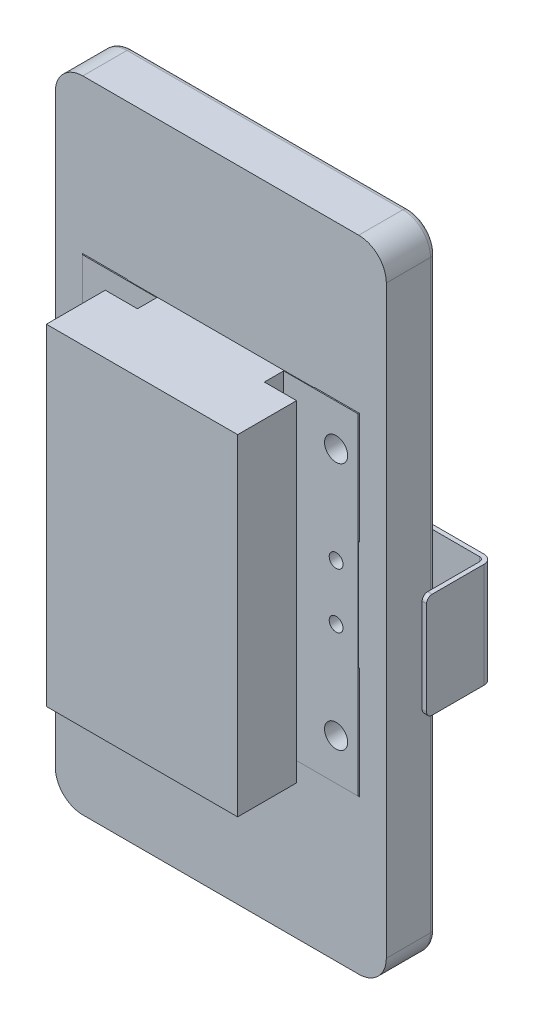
ISO-10303-21;
HEADER;
FILE_DESCRIPTION(('STEP AP214'),'2;1');
FILE_NAME('part.step','',(''),(''),'','','');
FILE_SCHEMA(('AUTOMOTIVE_DESIGN { 1 0 10303 214 1 1 1 1 }'));
ENDSEC;
DATA;
#1=APPLICATION_CONTEXT('core data for automotive mechanical design processes');
#2=APPLICATION_PROTOCOL_DEFINITION('international standard','automotive_design',2000,#1);
#3=PRODUCT_CONTEXT('',#1,'mechanical');
#4=PRODUCT('Part','Part','',(#3));
#5=PRODUCT_RELATED_PRODUCT_CATEGORY('part','',(#4));
#6=PRODUCT_DEFINITION_FORMATION('','',#4);
#7=PRODUCT_DEFINITION_CONTEXT('part definition',#1,'design');
#8=PRODUCT_DEFINITION('design','',#6,#7);
#9=PRODUCT_DEFINITION_SHAPE('','',#8);
#10=(LENGTH_UNIT() NAMED_UNIT(*) SI_UNIT(.MILLI.,.METRE.));
#11=(NAMED_UNIT(*) PLANE_ANGLE_UNIT() SI_UNIT($,.RADIAN.));
#12=(NAMED_UNIT(*) SI_UNIT($,.STERADIAN.) SOLID_ANGLE_UNIT());
#13=UNCERTAINTY_MEASURE_WITH_UNIT(LENGTH_MEASURE(1.E-05),#10,'distance_accuracy_value','');
#14=(GEOMETRIC_REPRESENTATION_CONTEXT(3) GLOBAL_UNCERTAINTY_ASSIGNED_CONTEXT((#13)) GLOBAL_UNIT_ASSIGNED_CONTEXT((#10,
#11,#12)) REPRESENTATION_CONTEXT('',''));
#15=CARTESIAN_POINT('',(0.,0.,0.));
#16=DIRECTION('',(0.,0.,1.));
#17=DIRECTION('',(1.,0.,0.));
#18=AXIS2_PLACEMENT_3D('',#15,#16,#17);
#19=CARTESIAN_POINT('',(20.99999999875,77.50000000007,-43.41999999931));
#20=DIRECTION('',(0.,0.,-1.));
#21=DIRECTION('',(-1.,0.,0.));
#22=AXIS2_PLACEMENT_3D('',#19,#20,#21);
#23=CYLINDRICAL_SURFACE('',#22,1.75);
#24=CARTESIAN_POINT('',(20.99999999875,77.50000000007,-52.59999999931));
#25=DIRECTION('',(0.,0.,-1.));
#26=DIRECTION('',(-1.,0.,0.));
#27=AXIS2_PLACEMENT_3D('',#24,#25,#26);
#28=CIRCLE('',#27,1.75);
#29=CARTESIAN_POINT('',(19.24999999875,77.50000000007,-52.59999999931));
#30=VERTEX_POINT('',#29);
#31=EDGE_CURVE('E972',#30,#30,#28,.F.);
#32=ORIENTED_EDGE('',*,*,#31,.F.);
#33=EDGE_LOOP('',(#32));
#34=FACE_BOUND('',#33,.T.);
#35=CARTESIAN_POINT('',(20.99999999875,77.50000000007,-51.99999999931));
#36=DIRECTION('',(0.,0.,-1.));
#37=DIRECTION('',(-1.,0.,0.));
#38=AXIS2_PLACEMENT_3D('',#35,#36,#37);
#39=CIRCLE('',#38,1.75);
#40=CARTESIAN_POINT('',(19.24999999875,77.50000000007,-51.99999999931));
#41=VERTEX_POINT('',#40);
#42=EDGE_CURVE('E974',#41,#41,#39,.F.);
#43=ORIENTED_EDGE('',*,*,#42,.T.);
#44=EDGE_LOOP('',(#43));
#45=FACE_BOUND('',#44,.T.);
#46=ADVANCED_FACE('F40',(#34,#45),#23,.F.);
#47=CARTESIAN_POINT('',(20.99999999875,87.50000000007,-43.41999999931));
#48=DIRECTION('',(0.,0.,-1.));
#49=DIRECTION('',(-1.,0.,0.));
#50=AXIS2_PLACEMENT_3D('',#47,#48,#49);
#51=CYLINDRICAL_SURFACE('',#50,1.75);
#52=CARTESIAN_POINT('',(20.99999999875,87.50000000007,-52.59999999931));
#53=DIRECTION('',(0.,0.,-1.));
#54=DIRECTION('',(-1.,0.,0.));
#55=AXIS2_PLACEMENT_3D('',#52,#53,#54);
#56=CIRCLE('',#55,1.75);
#57=CARTESIAN_POINT('',(19.24999999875,87.50000000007,-52.59999999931));
#58=VERTEX_POINT('',#57);
#59=EDGE_CURVE('E969',#58,#58,#56,.F.);
#60=ORIENTED_EDGE('',*,*,#59,.F.);
#61=EDGE_LOOP('',(#60));
#62=FACE_BOUND('',#61,.T.);
#63=CARTESIAN_POINT('',(20.99999999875,87.50000000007,-51.99999999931));
#64=DIRECTION('',(0.,0.,-1.));
#65=DIRECTION('',(-1.,0.,0.));
#66=AXIS2_PLACEMENT_3D('',#63,#64,#65);
#67=CIRCLE('',#66,1.75);
#68=CARTESIAN_POINT('',(19.24999999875,87.50000000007,-51.99999999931));
#69=VERTEX_POINT('',#68);
#70=EDGE_CURVE('E43',#69,#69,#67,.F.);
#71=ORIENTED_EDGE('',*,*,#70,.T.);
#72=EDGE_LOOP('',(#71));
#73=FACE_BOUND('',#72,.T.);
#74=ADVANCED_FACE('F1674',(#62,#73),#51,.F.);
#75=CARTESIAN_POINT('',(20.99999999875,82.50000000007,-51.99999999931));
#76=DIRECTION('',(0.,0.,1.));
#77=DIRECTION('',(1.,0.,0.));
#78=AXIS2_PLACEMENT_3D('',#75,#76,#77);
#79=PLANE('',#78);
#80=CARTESIAN_POINT('',(20.99999999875,87.50000000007,-51.99999999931));
#81=DIRECTION('',(0.,0.,1.));
#82=DIRECTION('',(1.,0.,0.));
#83=AXIS2_PLACEMENT_3D('',#80,#81,#82);
#84=CIRCLE('',#83,1.25);
#85=CARTESIAN_POINT('',(22.24999999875,87.50000000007,-51.99999999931));
#86=VERTEX_POINT('',#85);
#87=EDGE_CURVE('E966',#86,#86,#84,.T.);
#88=ORIENTED_EDGE('',*,*,#87,.T.);
#89=EDGE_LOOP('',(#88));
#90=FACE_BOUND('',#89,.T.);
#91=ORIENTED_EDGE('',*,*,#70,.F.);
#92=EDGE_LOOP('',(#91));
#93=FACE_BOUND('',#92,.T.);
#94=ADVANCED_FACE('F1671',(#90,#93),#79,.F.);
#95=CARTESIAN_POINT('',(20.99999999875,82.50000000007,-51.99999999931));
#96=DIRECTION('',(0.,0.,1.));
#97=DIRECTION('',(1.,0.,0.));
#98=AXIS2_PLACEMENT_3D('',#95,#96,#97);
#99=PLANE('',#98);
#100=CARTESIAN_POINT('',(20.99999999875,77.50000000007,-51.99999999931));
#101=DIRECTION('',(0.,0.,1.));
#102=DIRECTION('',(1.,0.,0.));
#103=AXIS2_PLACEMENT_3D('',#100,#101,#102);
#104=CIRCLE('',#103,1.25);
#105=CARTESIAN_POINT('',(22.24999999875,77.50000000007,-51.99999999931));
#106=VERTEX_POINT('',#105);
#107=EDGE_CURVE('E534',#106,#106,#104,.T.);
#108=ORIENTED_EDGE('',*,*,#107,.T.);
#109=EDGE_LOOP('',(#108));
#110=FACE_BOUND('',#109,.T.);
#111=ORIENTED_EDGE('',*,*,#42,.F.);
#112=EDGE_LOOP('',(#111));
#113=FACE_BOUND('',#112,.T.);
#114=ADVANCED_FACE('F1667',(#110,#113),#99,.F.);
#115=CARTESIAN_POINT('',(27.44999999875,82.50000000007,-52.59999999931));
#116=DIRECTION('',(0.,0.,1.));
#117=DIRECTION('',(1.,0.,0.));
#118=AXIS2_PLACEMENT_3D('',#115,#116,#117);
#119=PLANE('',#118);
#120=CARTESIAN_POINT('',(20.99999999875,77.50000000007,-52.59999999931));
#121=DIRECTION('',(0.,0.,1.));
#122=DIRECTION('',(1.,0.,0.));
#123=AXIS2_PLACEMENT_3D('',#120,#121,#122);
#124=CIRCLE('',#123,1.7);
#125=CARTESIAN_POINT('',(22.69999999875,77.50000000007,-52.59999999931));
#126=VERTEX_POINT('',#125);
#127=EDGE_CURVE('E960',#126,#126,#124,.F.);
#128=ORIENTED_EDGE('',*,*,#127,.T.);
#129=EDGE_LOOP('',(#128));
#130=FACE_BOUND('',#129,.T.);
#131=ORIENTED_EDGE('',*,*,#31,.T.);
#132=EDGE_LOOP('',(#131));
#133=FACE_BOUND('',#132,.T.);
#134=ADVANCED_FACE('F1663',(#130,#133),#119,.T.);
#135=CARTESIAN_POINT('',(27.44999999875,82.50000000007,-52.59999999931));
#136=DIRECTION('',(0.,0.,1.));
#137=DIRECTION('',(1.,0.,0.));
#138=AXIS2_PLACEMENT_3D('',#135,#136,#137);
#139=PLANE('',#138);
#140=CARTESIAN_POINT('',(20.99999999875,87.50000000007,-52.59999999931));
#141=DIRECTION('',(0.,0.,1.));
#142=DIRECTION('',(1.,0.,0.));
#143=AXIS2_PLACEMENT_3D('',#140,#141,#142);
#144=CIRCLE('',#143,1.7);
#145=CARTESIAN_POINT('',(22.69999999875,87.50000000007,-52.59999999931));
#146=VERTEX_POINT('',#145);
#147=EDGE_CURVE('E876',#146,#146,#144,.F.);
#148=ORIENTED_EDGE('',*,*,#147,.T.);
#149=EDGE_LOOP('',(#148));
#150=FACE_BOUND('',#149,.T.);
#151=ORIENTED_EDGE('',*,*,#59,.T.);
#152=EDGE_LOOP('',(#151));
#153=FACE_BOUND('',#152,.T.);
#154=ADVANCED_FACE('F1659',(#150,#153),#139,.T.);
#155=CARTESIAN_POINT('',(-21.00000000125,60.00000000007,-43.27999999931));
#156=DIRECTION('',(0.,0.,-1.));
#157=DIRECTION('',(-1.,0.,0.));
#158=AXIS2_PLACEMENT_3D('',#155,#156,#157);
#159=CYLINDRICAL_SURFACE('',#158,2.1);
#160=CARTESIAN_POINT('',(-21.00000000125,60.00000000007,-54.49999999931));
#161=DIRECTION('',(0.,0.,-1.));
#162=DIRECTION('',(-1.,0.,0.));
#163=AXIS2_PLACEMENT_3D('',#160,#161,#162);
#164=CIRCLE('',#163,2.1);
#165=CARTESIAN_POINT('',(-23.10000000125,60.00000000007,-54.49999999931));
#166=VERTEX_POINT('',#165);
#167=EDGE_CURVE('E871',#166,#166,#164,.T.);
#168=ORIENTED_EDGE('',*,*,#167,.T.);
#169=EDGE_LOOP('',(#168));
#170=FACE_BOUND('',#169,.T.);
#171=CARTESIAN_POINT('',(-21.00000000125,60.00000000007,-43.49999999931));
#172=DIRECTION('',(0.,0.,-1.));
#173=DIRECTION('',(-1.,0.,0.));
#174=AXIS2_PLACEMENT_3D('',#171,#172,#173);
#175=CIRCLE('',#174,2.1);
#176=CARTESIAN_POINT('',(-23.10000000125,60.00000000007,-43.49999999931));
#177=VERTEX_POINT('',#176);
#178=EDGE_CURVE('E951',#177,#177,#175,.T.);
#179=ORIENTED_EDGE('',*,*,#178,.F.);
#180=EDGE_LOOP('',(#179));
#181=FACE_BOUND('',#180,.T.);
#182=ADVANCED_FACE('F1655',(#170,#181),#159,.F.);
#183=CARTESIAN_POINT('',(-21.00000000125,105.0000000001,-43.27999999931));
#184=DIRECTION('',(0.,0.,-1.));
#185=DIRECTION('',(-1.,0.,0.));
#186=AXIS2_PLACEMENT_3D('',#183,#184,#185);
#187=CYLINDRICAL_SURFACE('',#186,2.1);
#188=CARTESIAN_POINT('',(-21.00000000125,105.0000000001,-54.49999999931));
#189=DIRECTION('',(0.,0.,-1.));
#190=DIRECTION('',(-1.,0.,0.));
#191=AXIS2_PLACEMENT_3D('',#188,#189,#190);
#192=CIRCLE('',#191,2.1);
#193=CARTESIAN_POINT('',(-23.10000000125,105.0000000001,-54.49999999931));
#194=VERTEX_POINT('',#193);
#195=EDGE_CURVE('E872',#194,#194,#192,.T.);
#196=ORIENTED_EDGE('',*,*,#195,.T.);
#197=EDGE_LOOP('',(#196));
#198=FACE_BOUND('',#197,.T.);
#199=CARTESIAN_POINT('',(-21.00000000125,105.0000000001,-43.49999999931));
#200=DIRECTION('',(0.,0.,-1.));
#201=DIRECTION('',(-1.,0.,0.));
#202=AXIS2_PLACEMENT_3D('',#199,#200,#201);
#203=CIRCLE('',#202,2.1);
#204=CARTESIAN_POINT('',(-23.10000000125,105.0000000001,-43.49999999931));
#205=VERTEX_POINT('',#204);
#206=EDGE_CURVE('E948',#205,#205,#203,.T.);
#207=ORIENTED_EDGE('',*,*,#206,.F.);
#208=EDGE_LOOP('',(#207));
#209=FACE_BOUND('',#208,.T.);
#210=ADVANCED_FACE('F1651',(#198,#209),#187,.F.);
#211=CARTESIAN_POINT('',(20.99999999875,105.0000000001,-43.27999999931));
#212=DIRECTION('',(0.,0.,-1.));
#213=DIRECTION('',(-1.,0.,0.));
#214=AXIS2_PLACEMENT_3D('',#211,#212,#213);
#215=CYLINDRICAL_SURFACE('',#214,2.1);
#216=CARTESIAN_POINT('',(20.99999999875,105.0000000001,-54.49999999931));
#217=DIRECTION('',(0.,0.,-1.));
#218=DIRECTION('',(-1.,0.,0.));
#219=AXIS2_PLACEMENT_3D('',#216,#217,#218);
#220=CIRCLE('',#219,2.1);
#221=CARTESIAN_POINT('',(18.89999999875,105.0000000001,-54.49999999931));
#222=VERTEX_POINT('',#221);
#223=EDGE_CURVE('E846',#222,#222,#220,.T.);
#224=ORIENTED_EDGE('',*,*,#223,.T.);
#225=EDGE_LOOP('',(#224));
#226=FACE_BOUND('',#225,.T.);
#227=CARTESIAN_POINT('',(20.99999999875,105.0000000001,-43.49999999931));
#228=DIRECTION('',(0.,0.,-1.));
#229=DIRECTION('',(-1.,0.,0.));
#230=AXIS2_PLACEMENT_3D('',#227,#228,#229);
#231=CIRCLE('',#230,2.1);
#232=CARTESIAN_POINT('',(18.89999999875,105.0000000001,-43.49999999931));
#233=VERTEX_POINT('',#232);
#234=EDGE_CURVE('E939',#233,#233,#231,.T.);
#235=ORIENTED_EDGE('',*,*,#234,.F.);
#236=EDGE_LOOP('',(#235));
#237=FACE_BOUND('',#236,.T.);
#238=ADVANCED_FACE('F1647',(#226,#237),#215,.F.);
#239=CARTESIAN_POINT('',(20.99999999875,87.50000000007,-52.16999999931));
#240=DIRECTION('',(0.,0.,1.));
#241=DIRECTION('',(1.,0.,0.));
#242=AXIS2_PLACEMENT_3D('',#239,#240,#241);
#243=CYLINDRICAL_SURFACE('',#242,1.25);
#244=CARTESIAN_POINT('',(20.99999999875,87.50000000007,-43.49999999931));
#245=DIRECTION('',(0.,0.,1.));
#246=DIRECTION('',(1.,0.,0.));
#247=AXIS2_PLACEMENT_3D('',#244,#245,#246);
#248=CIRCLE('',#247,1.25);
#249=CARTESIAN_POINT('',(22.24999999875,87.50000000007,-43.49999999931));
#250=VERTEX_POINT('',#249);
#251=EDGE_CURVE('E936',#250,#250,#248,.F.);
#252=ORIENTED_EDGE('',*,*,#251,.F.);
#253=EDGE_LOOP('',(#252));
#254=FACE_BOUND('',#253,.T.);
#255=ORIENTED_EDGE('',*,*,#87,.F.);
#256=EDGE_LOOP('',(#255));
#257=FACE_BOUND('',#256,.T.);
#258=ADVANCED_FACE('F1643',(#254,#257),#243,.F.);
#259=CARTESIAN_POINT('',(20.99999999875,77.50000000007,-52.16999999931));
#260=DIRECTION('',(0.,0.,1.));
#261=DIRECTION('',(1.,0.,0.));
#262=AXIS2_PLACEMENT_3D('',#259,#260,#261);
#263=CYLINDRICAL_SURFACE('',#262,1.25);
#264=CARTESIAN_POINT('',(20.99999999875,77.50000000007,-43.49999999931));
#265=DIRECTION('',(0.,0.,1.));
#266=DIRECTION('',(1.,0.,0.));
#267=AXIS2_PLACEMENT_3D('',#264,#265,#266);
#268=CIRCLE('',#267,1.25);
#269=CARTESIAN_POINT('',(22.24999999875,77.50000000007,-43.49999999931));
#270=VERTEX_POINT('',#269);
#271=EDGE_CURVE('E933',#270,#270,#268,.F.);
#272=ORIENTED_EDGE('',*,*,#271,.F.);
#273=EDGE_LOOP('',(#272));
#274=FACE_BOUND('',#273,.T.);
#275=ORIENTED_EDGE('',*,*,#107,.F.);
#276=EDGE_LOOP('',(#275));
#277=FACE_BOUND('',#276,.T.);
#278=ADVANCED_FACE('F1639',(#274,#277),#263,.F.);
#279=CARTESIAN_POINT('',(20.99999999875,60.00000000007,-43.27999999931));
#280=DIRECTION('',(0.,0.,-1.));
#281=DIRECTION('',(-1.,0.,0.));
#282=AXIS2_PLACEMENT_3D('',#279,#280,#281);
#283=CYLINDRICAL_SURFACE('',#282,2.1);
#284=CARTESIAN_POINT('',(20.99999999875,60.00000000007,-54.49999999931));
#285=DIRECTION('',(0.,0.,-1.));
#286=DIRECTION('',(-1.,0.,0.));
#287=AXIS2_PLACEMENT_3D('',#284,#285,#286);
#288=CIRCLE('',#287,2.1);
#289=CARTESIAN_POINT('',(18.89999999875,60.00000000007,-54.49999999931));
#290=VERTEX_POINT('',#289);
#291=EDGE_CURVE('E842',#290,#290,#288,.T.);
#292=ORIENTED_EDGE('',*,*,#291,.T.);
#293=EDGE_LOOP('',(#292));
#294=FACE_BOUND('',#293,.T.);
#295=CARTESIAN_POINT('',(20.99999999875,60.00000000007,-43.49999999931));
#296=DIRECTION('',(0.,0.,-1.));
#297=DIRECTION('',(-1.,0.,0.));
#298=AXIS2_PLACEMENT_3D('',#295,#296,#297);
#299=CIRCLE('',#298,2.1);
#300=CARTESIAN_POINT('',(18.89999999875,60.00000000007,-43.49999999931));
#301=VERTEX_POINT('',#300);
#302=EDGE_CURVE('E845',#301,#301,#299,.T.);
#303=ORIENTED_EDGE('',*,*,#302,.F.);
#304=EDGE_LOOP('',(#303));
#305=FACE_BOUND('',#304,.T.);
#306=ADVANCED_FACE('F1636',(#294,#305),#283,.F.);
#307=CARTESIAN_POINT('',(37.89999999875,92.38000000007,-51.79999999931));
#308=DIRECTION('',(0.,-1.,0.));
#309=DIRECTION('',(0.,0.,-1.));
#310=AXIS2_PLACEMENT_3D('',#307,#308,#309);
#311=CYLINDRICAL_SURFACE('',#310,0.8);
#312=CARTESIAN_POINT('',(37.89999999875,73.00000000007,-51.79999999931));
#313=DIRECTION('',(0.,-1.,0.));
#314=DIRECTION('',(0.,0.,-1.));
#315=AXIS2_PLACEMENT_3D('',#312,#313,#314);
#316=CIRCLE('',#315,0.8);
#317=CARTESIAN_POINT('',(38.69999999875,73.00000000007,-51.79999999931));
#318=VERTEX_POINT('',#317);
#319=CARTESIAN_POINT('',(37.89999999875,73.00000000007,-52.59999999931));
#320=VERTEX_POINT('',#319);
#321=EDGE_CURVE('E533',#318,#320,#316,.F.);
#322=ORIENTED_EDGE('',*,*,#321,.F.);
#323=DIRECTION('',(0.,1.,0.));
#324=VECTOR('',#323,1.);
#325=CARTESIAN_POINT('',(38.69999999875,82.50000000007,-51.79999999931));
#326=LINE('',#325,#324);
#327=CARTESIAN_POINT('',(38.69999999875,92.00000000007,-51.79999999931));
#328=VERTEX_POINT('',#327);
#329=EDGE_CURVE('E537',#318,#328,#326,.T.);
#330=ORIENTED_EDGE('',*,*,#329,.T.);
#331=CARTESIAN_POINT('',(37.89999999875,92.00000000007,-51.79999999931));
#332=DIRECTION('',(0.,-1.,0.));
#333=DIRECTION('',(0.,0.,-1.));
#334=AXIS2_PLACEMENT_3D('',#331,#332,#333);
#335=CIRCLE('',#334,0.8);
#336=CARTESIAN_POINT('',(37.89999999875,92.00000000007,-52.59999999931));
#337=VERTEX_POINT('',#336);
#338=EDGE_CURVE('E521',#337,#328,#335,.T.);
#339=ORIENTED_EDGE('',*,*,#338,.F.);
#340=DIRECTION('',(0.,1.,0.));
#341=VECTOR('',#340,1.);
#342=CARTESIAN_POINT('',(37.89999999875,82.50000000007,-52.59999999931));
#343=LINE('',#342,#341);
#344=EDGE_CURVE('E543',#320,#337,#343,.T.);
#345=ORIENTED_EDGE('',*,*,#344,.F.);
#346=EDGE_LOOP('',(#322,#330,#339,#345));
#347=FACE_BOUND('',#346,.T.);
#348=ADVANCED_FACE('F538',(#347),#311,.F.);
#349=CARTESIAN_POINT('',(39.09999999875,82.50000000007,-41.39999999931));
#350=DIRECTION('',(0.,0.,1.));
#351=DIRECTION('',(1.,0.,0.));
#352=AXIS2_PLACEMENT_3D('',#349,#350,#351);
#353=PLANE('',#352);
#354=DIRECTION('',(0.,1.,0.));
#355=VECTOR('',#354,1.);
#356=CARTESIAN_POINT('',(39.49999999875,82.50000000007,-41.39999999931));
#357=LINE('',#356,#355);
#358=CARTESIAN_POINT('',(39.49999999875,91.00000000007,-41.39999999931));
#359=VERTEX_POINT('',#358);
#360=CARTESIAN_POINT('',(39.49999999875,74.00000000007,-41.39999999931));
#361=VERTEX_POINT('',#360);
#362=EDGE_CURVE('E777',#359,#361,#357,.F.);
#363=ORIENTED_EDGE('',*,*,#362,.F.);
#364=DIRECTION('',(-1.,0.,0.));
#365=VECTOR('',#364,1.);
#366=CARTESIAN_POINT('',(39.53816018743,91.00000000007,-41.39999999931));
#367=LINE('',#366,#365);
#368=CARTESIAN_POINT('',(38.69999999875,91.00000000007,-41.39999999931));
#369=VERTEX_POINT('',#368);
#370=EDGE_CURVE('E837',#369,#359,#367,.F.);
#371=ORIENTED_EDGE('',*,*,#370,.F.);
#372=DIRECTION('',(0.,1.,0.));
#373=VECTOR('',#372,1.);
#374=CARTESIAN_POINT('',(38.69999999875,82.50000000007,-41.39999999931));
#375=LINE('',#374,#373);
#376=CARTESIAN_POINT('',(38.69999999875,74.00000000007,-41.39999999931));
#377=VERTEX_POINT('',#376);
#378=EDGE_CURVE('E785',#369,#377,#375,.F.);
#379=ORIENTED_EDGE('',*,*,#378,.T.);
#380=DIRECTION('',(-1.,0.,0.));
#381=VECTOR('',#380,1.);
#382=CARTESIAN_POINT('',(39.53816018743,74.00000000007,-41.39999999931));
#383=LINE('',#382,#381);
#384=EDGE_CURVE('E787',#361,#377,#383,.T.);
#385=ORIENTED_EDGE('',*,*,#384,.F.);
#386=EDGE_LOOP('',(#363,#371,#379,#385));
#387=FACE_BOUND('',#386,.T.);
#388=ADVANCED_FACE('F1629',(#387),#353,.T.);
#389=CARTESIAN_POINT('',(20.99999999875,77.50000000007,-53.43816018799));
#390=DIRECTION('',(0.,0.,1.));
#391=DIRECTION('',(1.,0.,0.));
#392=AXIS2_PLACEMENT_3D('',#389,#390,#391);
#393=CYLINDRICAL_SURFACE('',#392,1.7);
#394=ORIENTED_EDGE('',*,*,#127,.F.);
#395=EDGE_LOOP('',(#394));
#396=FACE_BOUND('',#395,.T.);
#397=CARTESIAN_POINT('',(20.99999999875,77.50000000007,-53.39999999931));
#398=DIRECTION('',(0.,0.,1.));
#399=DIRECTION('',(1.,0.,0.));
#400=AXIS2_PLACEMENT_3D('',#397,#398,#399);
#401=CIRCLE('',#400,1.7);
#402=CARTESIAN_POINT('',(22.69999999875,77.50000000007,-53.39999999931));
#403=VERTEX_POINT('',#402);
#404=EDGE_CURVE('E772',#403,#403,#401,.F.);
#405=ORIENTED_EDGE('',*,*,#404,.T.);
#406=EDGE_LOOP('',(#405));
#407=FACE_BOUND('',#406,.T.);
#408=ADVANCED_FACE('F1625',(#396,#407),#393,.F.);
#409=CARTESIAN_POINT('',(20.99999999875,87.50000000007,-53.43816018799));
#410=DIRECTION('',(0.,0.,1.));
#411=DIRECTION('',(1.,0.,0.));
#412=AXIS2_PLACEMENT_3D('',#409,#410,#411);
#413=CYLINDRICAL_SURFACE('',#412,1.7);
#414=ORIENTED_EDGE('',*,*,#147,.F.);
#415=EDGE_LOOP('',(#414));
#416=FACE_BOUND('',#415,.T.);
#417=CARTESIAN_POINT('',(20.99999999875,87.50000000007,-53.39999999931));
#418=DIRECTION('',(0.,0.,1.));
#419=DIRECTION('',(1.,0.,0.));
#420=AXIS2_PLACEMENT_3D('',#417,#418,#419);
#421=CIRCLE('',#420,1.7);
#422=CARTESIAN_POINT('',(22.69999999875,87.50000000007,-53.39999999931));
#423=VERTEX_POINT('',#422);
#424=EDGE_CURVE('E765',#423,#423,#421,.F.);
#425=ORIENTED_EDGE('',*,*,#424,.T.);
#426=EDGE_LOOP('',(#425));
#427=FACE_BOUND('',#426,.T.);
#428=ADVANCED_FACE('F1621',(#416,#427),#413,.F.);
#429=CARTESIAN_POINT('',(-21.00000000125,87.50000000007,-52.16999999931));
#430=DIRECTION('',(0.,0.,1.));
#431=DIRECTION('',(1.,0.,0.));
#432=AXIS2_PLACEMENT_3D('',#429,#430,#431);
#433=CYLINDRICAL_SURFACE('',#432,1.25);
#434=CARTESIAN_POINT('',(-21.00000000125,87.50000000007,-43.49999999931));
#435=DIRECTION('',(0.,0.,1.));
#436=DIRECTION('',(1.,0.,0.));
#437=AXIS2_PLACEMENT_3D('',#434,#435,#436);
#438=CIRCLE('',#437,1.25);
#439=CARTESIAN_POINT('',(-19.75000000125,87.50000000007,-43.49999999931));
#440=VERTEX_POINT('',#439);
#441=EDGE_CURVE('E868',#440,#440,#438,.F.);
#442=ORIENTED_EDGE('',*,*,#441,.F.);
#443=EDGE_LOOP('',(#442));
#444=FACE_BOUND('',#443,.T.);
#445=CARTESIAN_POINT('',(-21.00000000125,87.50000000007,-51.99999999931));
#446=DIRECTION('',(0.,0.,1.));
#447=DIRECTION('',(1.,0.,0.));
#448=AXIS2_PLACEMENT_3D('',#445,#446,#447);
#449=CIRCLE('',#448,1.25);
#450=CARTESIAN_POINT('',(-19.75000000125,87.50000000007,-51.99999999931));
#451=VERTEX_POINT('',#450);
#452=EDGE_CURVE('E704',#451,#451,#449,.F.);
#453=ORIENTED_EDGE('',*,*,#452,.T.);
#454=EDGE_LOOP('',(#453));
#455=FACE_BOUND('',#454,.T.);
#456=ADVANCED_FACE('F1617',(#444,#455),#433,.F.);
#457=CARTESIAN_POINT('',(-21.00000000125,92.50000000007,-53.24999999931));
#458=DIRECTION('',(0.,1.,0.));
#459=DIRECTION('',(0.,0.,1.));
#460=AXIS2_PLACEMENT_3D('',#457,#458,#459);
#461=PLANE('',#460);
#462=DIRECTION('',(1.,0.,0.));
#463=VECTOR('',#462,1.);
#464=CARTESIAN_POINT('',(-21.00000000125,92.50000000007,-51.99999999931));
#465=LINE('',#464,#463);
#466=CARTESIAN_POINT('',(-17.00000000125,92.50000000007,-51.99999999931));
#467=VERTEX_POINT('',#466);
#468=CARTESIAN_POINT('',(-25.00000000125,92.50000000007,-51.99999999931));
#469=VERTEX_POINT('',#468);
#470=EDGE_CURVE('E718',#467,#469,#465,.F.);
#471=ORIENTED_EDGE('',*,*,#470,.T.);
#472=DIRECTION('',(0.,0.,-1.));
#473=VECTOR('',#472,1.);
#474=CARTESIAN_POINT('',(-25.00000000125,92.50000000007,-48.99999999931));
#475=LINE('',#474,#473);
#476=CARTESIAN_POINT('',(-25.00000000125,92.50000000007,-54.49999999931));
#477=VERTEX_POINT('',#476);
#478=EDGE_CURVE('E698',#469,#477,#475,.T.);
#479=ORIENTED_EDGE('',*,*,#478,.T.);
#480=DIRECTION('',(1.,0.,0.));
#481=VECTOR('',#480,1.);
#482=CARTESIAN_POINT('',(-21.00000000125,92.50000000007,-54.49999999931));
#483=LINE('',#482,#481);
#484=CARTESIAN_POINT('',(-17.00000000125,92.50000000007,-54.49999999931));
#485=VERTEX_POINT('',#484);
#486=EDGE_CURVE('E873',#477,#485,#483,.T.);
#487=ORIENTED_EDGE('',*,*,#486,.T.);
#488=DIRECTION('',(0.,0.,-1.));
#489=VECTOR('',#488,1.);
#490=CARTESIAN_POINT('',(-17.00000000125,92.50000000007,-49.99999999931));
#491=LINE('',#490,#489);
#492=EDGE_CURVE('E713',#467,#485,#491,.T.);
#493=ORIENTED_EDGE('',*,*,#492,.F.);
#494=EDGE_LOOP('',(#471,#479,#487,#493));
#495=FACE_BOUND('',#494,.T.);
#496=ADVANCED_FACE('F1613',(#495),#461,.F.);
#497=CARTESIAN_POINT('',(-21.00000000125,102.5000000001,-54.49999999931));
#498=DIRECTION('',(0.,0.,1.));
#499=DIRECTION('',(1.,0.,0.));
#500=AXIS2_PLACEMENT_3D('',#497,#498,#499);
#501=PLANE('',#500);
#502=CARTESIAN_POINT('',(-21.00000000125,97.5000000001,-54.49999999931));
#503=DIRECTION('',(0.,0.,-1.));
#504=DIRECTION('',(-1.,0.,0.));
#505=AXIS2_PLACEMENT_3D('',#502,#503,#504);
#506=CIRCLE('',#505,1.49999999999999);
#507=CARTESIAN_POINT('',(-22.50000000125,97.5000000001,-54.49999999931));
#508=VERTEX_POINT('',#507);
#509=EDGE_CURVE('E2618',#508,#508,#506,.T.);
#510=ORIENTED_EDGE('',*,*,#509,.F.);
#511=EDGE_LOOP('',(#510));
#512=FACE_BOUND('',#511,.T.);
#513=ORIENTED_EDGE('',*,*,#195,.F.);
#514=EDGE_LOOP('',(#513));
#515=FACE_BOUND('',#514,.T.);
#516=DIRECTION('',(1.,0.,0.));
#517=VECTOR('',#516,1.);
#518=CARTESIAN_POINT('',(-1.250000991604E-09,112.5000000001,-54.49999999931));
#519=LINE('',#518,#517);
#520=CARTESIAN_POINT('',(-17.00000000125,112.5000000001,-54.49999999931));
#521=VERTEX_POINT('',#520);
#522=CARTESIAN_POINT('',(-25.00000000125,112.5000000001,-54.49999999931));
#523=VERTEX_POINT('',#522);
#524=EDGE_CURVE('E744',#521,#523,#519,.F.);
#525=ORIENTED_EDGE('',*,*,#524,.F.);
#526=DIRECTION('',(0.,1.,0.));
#527=VECTOR('',#526,1.);
#528=CARTESIAN_POINT('',(-17.00000000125,82.50000000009,-54.49999999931));
#529=LINE('',#528,#527);
#530=EDGE_CURVE('E711',#485,#521,#529,.T.);
#531=ORIENTED_EDGE('',*,*,#530,.F.);
#532=ORIENTED_EDGE('',*,*,#486,.F.);
#533=DIRECTION('',(0.,1.,0.));
#534=VECTOR('',#533,1.);
#535=CARTESIAN_POINT('',(-25.00000000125,82.50000000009,-54.49999999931));
#536=LINE('',#535,#534);
#537=EDGE_CURVE('E695',#477,#523,#536,.T.);
#538=ORIENTED_EDGE('',*,*,#537,.T.);
#539=EDGE_LOOP('',(#525,#531,#532,#538));
#540=FACE_BOUND('',#539,.T.);
#541=ADVANCED_FACE('F1609',(#512,#515,#540),#501,.F.);
#542=CARTESIAN_POINT('',(-21.00000000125,72.50000000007,-53.24999999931));
#543=DIRECTION('',(0.,1.,0.));
#544=DIRECTION('',(0.,0.,1.));
#545=AXIS2_PLACEMENT_3D('',#542,#543,#544);
#546=PLANE('',#545);
#547=DIRECTION('',(0.,0.,-1.));
#548=VECTOR('',#547,1.);
#549=CARTESIAN_POINT('',(-25.00000000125,72.50000000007,-48.99999999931));
#550=LINE('',#549,#548);
#551=CARTESIAN_POINT('',(-25.00000000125,72.50000000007,-54.49999999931));
#552=VERTEX_POINT('',#551);
#553=CARTESIAN_POINT('',(-25.00000000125,72.50000000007,-51.99999999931));
#554=VERTEX_POINT('',#553);
#555=EDGE_CURVE('E685',#552,#554,#550,.F.);
#556=ORIENTED_EDGE('',*,*,#555,.T.);
#557=DIRECTION('',(1.,0.,0.));
#558=VECTOR('',#557,1.);
#559=CARTESIAN_POINT('',(-21.00000000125,72.50000000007,-51.99999999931));
#560=LINE('',#559,#558);
#561=CARTESIAN_POINT('',(-17.00000000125,72.50000000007,-51.99999999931));
#562=VERTEX_POINT('',#561);
#563=EDGE_CURVE('E679',#554,#562,#560,.T.);
#564=ORIENTED_EDGE('',*,*,#563,.T.);
#565=DIRECTION('',(0.,0.,-1.));
#566=VECTOR('',#565,1.);
#567=CARTESIAN_POINT('',(-17.00000000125,72.50000000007,-49.99999999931));
#568=LINE('',#567,#566);
#569=CARTESIAN_POINT('',(-17.00000000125,72.50000000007,-54.49999999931));
#570=VERTEX_POINT('',#569);
#571=EDGE_CURVE('E674',#570,#562,#568,.F.);
#572=ORIENTED_EDGE('',*,*,#571,.F.);
#573=DIRECTION('',(1.,0.,0.));
#574=VECTOR('',#573,1.);
#575=CARTESIAN_POINT('',(-21.00000000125,72.50000000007,-54.49999999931));
#576=LINE('',#575,#574);
#577=EDGE_CURVE('E869',#570,#552,#576,.F.);
#578=ORIENTED_EDGE('',*,*,#577,.T.);
#579=EDGE_LOOP('',(#556,#564,#572,#578));
#580=FACE_BOUND('',#579,.T.);
#581=ADVANCED_FACE('F1605',(#580),#546,.T.);
#582=CARTESIAN_POINT('',(-21.00000000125,62.50000000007,-54.49999999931));
#583=DIRECTION('',(0.,0.,1.));
#584=DIRECTION('',(1.,0.,0.));
#585=AXIS2_PLACEMENT_3D('',#582,#583,#584);
#586=PLANE('',#585);
#587=CARTESIAN_POINT('',(-21.00000000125,67.5000000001,-54.49999999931));
#588=DIRECTION('',(0.,0.,-1.));
#589=DIRECTION('',(-1.,0.,0.));
#590=AXIS2_PLACEMENT_3D('',#587,#588,#589);
#591=CIRCLE('',#590,1.5);
#592=CARTESIAN_POINT('',(-22.50000000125,67.5000000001,-54.49999999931));
#593=VERTEX_POINT('',#592);
#594=EDGE_CURVE('E983',#593,#593,#591,.T.);
#595=ORIENTED_EDGE('',*,*,#594,.F.);
#596=EDGE_LOOP('',(#595));
#597=FACE_BOUND('',#596,.T.);
#598=ORIENTED_EDGE('',*,*,#167,.F.);
#599=EDGE_LOOP('',(#598));
#600=FACE_BOUND('',#599,.T.);
#601=DIRECTION('',(1.,0.,0.));
#602=VECTOR('',#601,1.);
#603=CARTESIAN_POINT('',(-1.250000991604E-09,52.50000000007,-54.49999999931));
#604=LINE('',#603,#602);
#605=CARTESIAN_POINT('',(-17.00000000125,52.50000000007,-54.49999999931));
#606=VERTEX_POINT('',#605);
#607=CARTESIAN_POINT('',(-25.00000000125,52.50000000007,-54.49999999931));
#608=VERTEX_POINT('',#607);
#609=EDGE_CURVE('E661',#606,#608,#604,.F.);
#610=ORIENTED_EDGE('',*,*,#609,.T.);
#611=DIRECTION('',(0.,1.,0.));
#612=VECTOR('',#611,1.);
#613=CARTESIAN_POINT('',(-25.00000000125,82.50000000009,-54.49999999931));
#614=LINE('',#613,#612);
#615=EDGE_CURVE('E687',#608,#552,#614,.T.);
#616=ORIENTED_EDGE('',*,*,#615,.T.);
#617=ORIENTED_EDGE('',*,*,#577,.F.);
#618=DIRECTION('',(0.,1.,0.));
#619=VECTOR('',#618,1.);
#620=CARTESIAN_POINT('',(-17.00000000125,82.50000000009,-54.49999999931));
#621=LINE('',#620,#619);
#622=EDGE_CURVE('E676',#606,#570,#621,.T.);
#623=ORIENTED_EDGE('',*,*,#622,.F.);
#624=EDGE_LOOP('',(#610,#616,#617,#623));
#625=FACE_BOUND('',#624,.T.);
#626=ADVANCED_FACE('F1601',(#597,#600,#625),#586,.F.);
#627=CARTESIAN_POINT('',(-18.25000000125,82.50000000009,-43.49999999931));
#628=DIRECTION('',(0.,0.,1.));
#629=DIRECTION('',(1.,0.,0.));
#630=AXIS2_PLACEMENT_3D('',#627,#628,#629);
#631=PLANE('',#630);
#632=ORIENTED_EDGE('',*,*,#441,.T.);
#633=EDGE_LOOP('',(#632));
#634=FACE_BOUND('',#633,.T.);
#635=CARTESIAN_POINT('',(-21.00000000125,77.50000000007,-43.49999999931));
#636=DIRECTION('',(0.,0.,1.));
#637=DIRECTION('',(1.,0.,0.));
#638=AXIS2_PLACEMENT_3D('',#635,#636,#637);
#639=CIRCLE('',#638,1.25);
#640=CARTESIAN_POINT('',(-19.75000000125,77.50000000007,-43.49999999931));
#641=VERTEX_POINT('',#640);
#642=EDGE_CURVE('E841',#641,#641,#639,.F.);
#643=ORIENTED_EDGE('',*,*,#642,.T.);
#644=EDGE_LOOP('',(#643));
#645=FACE_BOUND('',#644,.T.);
#646=ORIENTED_EDGE('',*,*,#206,.T.);
#647=EDGE_LOOP('',(#646));
#648=FACE_BOUND('',#647,.T.);
#649=ORIENTED_EDGE('',*,*,#178,.T.);
#650=EDGE_LOOP('',(#649));
#651=FACE_BOUND('',#650,.T.);
#652=DIRECTION('',(1.,0.,0.));
#653=VECTOR('',#652,1.);
#654=CARTESIAN_POINT('',(-1.250000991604E-09,52.50000000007,-43.49999999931));
#655=LINE('',#654,#653);
#656=CARTESIAN_POINT('',(-25.00000000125,52.50000000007,-43.49999999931));
#657=VERTEX_POINT('',#656);
#658=CARTESIAN_POINT('',(-11.50000000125,52.50000000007,-43.49999999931));
#659=VERTEX_POINT('',#658);
#660=EDGE_CURVE('E655',#657,#659,#655,.T.);
#661=ORIENTED_EDGE('',*,*,#660,.T.);
#662=DIRECTION('',(0.,1.,0.));
#663=VECTOR('',#662,1.);
#664=CARTESIAN_POINT('',(-11.50000000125,82.50000000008,-43.49999999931));
#665=LINE('',#664,#663);
#666=CARTESIAN_POINT('',(-11.50000000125,112.5000000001,-43.49999999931));
#667=VERTEX_POINT('',#666);
#668=EDGE_CURVE('E865',#659,#667,#665,.T.);
#669=ORIENTED_EDGE('',*,*,#668,.T.);
#670=DIRECTION('',(1.,0.,0.));
#671=VECTOR('',#670,1.);
#672=CARTESIAN_POINT('',(-1.250000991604E-09,112.5000000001,-43.49999999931));
#673=LINE('',#672,#671);
#674=CARTESIAN_POINT('',(-25.00000000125,112.5000000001,-43.49999999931));
#675=VERTEX_POINT('',#674);
#676=EDGE_CURVE('E742',#675,#667,#673,.T.);
#677=ORIENTED_EDGE('',*,*,#676,.F.);
#678=DIRECTION('',(0.,1.,0.));
#679=VECTOR('',#678,1.);
#680=CARTESIAN_POINT('',(-25.00000000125,82.50000000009,-43.49999999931));
#681=LINE('',#680,#679);
#682=EDGE_CURVE('E690',#675,#657,#681,.F.);
#683=ORIENTED_EDGE('',*,*,#682,.T.);
#684=EDGE_LOOP('',(#661,#669,#677,#683));
#685=FACE_BOUND('',#684,.T.);
#686=ADVANCED_FACE('F1597',(#634,#645,#648,#651,#685),#631,.T.);
#687=CARTESIAN_POINT('',(-11.50000000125,82.50000000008,-41.74999999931));
#688=DIRECTION('',(1.,0.,0.));
#689=DIRECTION('',(0.,0.,-1.));
#690=AXIS2_PLACEMENT_3D('',#687,#688,#689);
#691=PLANE('',#690);
#692=DIRECTION('',(0.,1.,0.));
#693=VECTOR('',#692,1.);
#694=CARTESIAN_POINT('',(-11.50000000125,82.50000000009,-39.99999999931));
#695=LINE('',#694,#693);
#696=CARTESIAN_POINT('',(-11.50000000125,52.50000000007,-39.99999999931));
#697=VERTEX_POINT('',#696);
#698=CARTESIAN_POINT('',(-11.50000000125,112.5000000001,-39.99999999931));
#699=VERTEX_POINT('',#698);
#700=EDGE_CURVE('E862',#697,#699,#695,.T.);
#701=ORIENTED_EDGE('',*,*,#700,.T.);
#702=DIRECTION('',(0.,0.,1.));
#703=VECTOR('',#702,1.);
#704=CARTESIAN_POINT('',(-11.50000000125,112.5000000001,-41.91209267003));
#705=LINE('',#704,#703);
#706=EDGE_CURVE('E740',#667,#699,#705,.T.);
#707=ORIENTED_EDGE('',*,*,#706,.F.);
#708=ORIENTED_EDGE('',*,*,#668,.F.);
#709=DIRECTION('',(0.,0.,1.));
#710=VECTOR('',#709,1.);
#711=CARTESIAN_POINT('',(-11.50000000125,52.50000000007,-41.91209267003));
#712=LINE('',#711,#710);
#713=EDGE_CURVE('E652',#659,#697,#712,.T.);
#714=ORIENTED_EDGE('',*,*,#713,.T.);
#715=EDGE_LOOP('',(#701,#707,#708,#714));
#716=FACE_BOUND('',#715,.T.);
#717=ADVANCED_FACE('F1593',(#716),#691,.F.);
#718=CARTESIAN_POINT('',(-14.41568415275,82.50000000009,-39.99999999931));
#719=DIRECTION('',(0.,0.,1.));
#720=DIRECTION('',(1.,0.,0.));
#721=AXIS2_PLACEMENT_3D('',#718,#719,#720);
#722=PLANE('',#721);
#723=DIRECTION('',(1.,0.,0.));
#724=VECTOR('',#723,1.);
#725=CARTESIAN_POINT('',(-1.250000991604E-09,112.5000000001,-39.99999999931));
#726=LINE('',#725,#724);
#727=CARTESIAN_POINT('',(-17.33136830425,112.5000000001,-39.99999999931));
#728=VERTEX_POINT('',#727);
#729=EDGE_CURVE('E738',#699,#728,#726,.F.);
#730=ORIENTED_EDGE('',*,*,#729,.F.);
#731=ORIENTED_EDGE('',*,*,#700,.F.);
#732=DIRECTION('',(1.,0.,0.));
#733=VECTOR('',#732,1.);
#734=CARTESIAN_POINT('',(-1.250000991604E-09,52.50000000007,-39.99999999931));
#735=LINE('',#734,#733);
#736=CARTESIAN_POINT('',(-17.33136830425,52.50000000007,-39.99999999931));
#737=VERTEX_POINT('',#736);
#738=EDGE_CURVE('E649',#697,#737,#735,.F.);
#739=ORIENTED_EDGE('',*,*,#738,.T.);
#740=DIRECTION('',(0.,1.,0.));
#741=VECTOR('',#740,1.);
#742=CARTESIAN_POINT('',(-17.33136830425,82.50000000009,-39.99999999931));
#743=LINE('',#742,#741);
#744=EDGE_CURVE('E859',#737,#728,#743,.T.);
#745=ORIENTED_EDGE('',*,*,#744,.T.);
#746=EDGE_LOOP('',(#730,#731,#739,#745));
#747=FACE_BOUND('',#746,.T.);
#748=ADVANCED_FACE('F1589',(#747),#722,.F.);
#749=CARTESIAN_POINT('',(-17.33136830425,82.50000000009,-34.66209267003));
#750=DIRECTION('',(1.,0.,0.));
#751=DIRECTION('',(0.,0.,-1.));
#752=AXIS2_PLACEMENT_3D('',#749,#750,#751);
#753=PLANE('',#752);
#754=DIRECTION('',(0.,0.,1.));
#755=VECTOR('',#754,1.);
#756=CARTESIAN_POINT('',(-17.33136830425,112.5000000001,-41.91209267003));
#757=LINE('',#756,#755);
#758=CARTESIAN_POINT('',(-17.33136830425,112.5000000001,-29.32418534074));
#759=VERTEX_POINT('',#758);
#760=EDGE_CURVE('E736',#728,#759,#757,.T.);
#761=ORIENTED_EDGE('',*,*,#760,.F.);
#762=ORIENTED_EDGE('',*,*,#744,.F.);
#763=DIRECTION('',(0.,0.,1.));
#764=VECTOR('',#763,1.);
#765=CARTESIAN_POINT('',(-17.33136830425,52.50000000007,-41.91209267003));
#766=LINE('',#765,#764);
#767=CARTESIAN_POINT('',(-17.33136830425,52.50000000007,-29.32418534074));
#768=VERTEX_POINT('',#767);
#769=EDGE_CURVE('E646',#737,#768,#766,.T.);
#770=ORIENTED_EDGE('',*,*,#769,.T.);
#771=DIRECTION('',(0.,1.,0.));
#772=VECTOR('',#771,1.);
#773=CARTESIAN_POINT('',(-17.33136830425,82.50000000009,-29.32418534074));
#774=LINE('',#773,#772);
#775=EDGE_CURVE('E857',#759,#768,#774,.F.);
#776=ORIENTED_EDGE('',*,*,#775,.F.);
#777=EDGE_LOOP('',(#761,#762,#770,#776));
#778=FACE_BOUND('',#777,.T.);
#779=ADVANCED_FACE('F1585',(#778),#753,.F.);
#780=CARTESIAN_POINT('',(-1.249999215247E-09,82.50000000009,-29.32418534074));
#781=DIRECTION('',(0.,0.,1.));
#782=DIRECTION('',(1.,0.,0.));
#783=AXIS2_PLACEMENT_3D('',#780,#781,#782);
#784=PLANE('',#783);
#785=ORIENTED_EDGE('',*,*,#775,.T.);
#786=DIRECTION('',(1.,0.,0.));
#787=VECTOR('',#786,1.);
#788=CARTESIAN_POINT('',(-1.250000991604E-09,52.50000000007,-29.32418534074));
#789=LINE('',#788,#787);
#790=CARTESIAN_POINT('',(17.33136830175,52.50000000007,-29.32418534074));
#791=VERTEX_POINT('',#790);
#792=EDGE_CURVE('E643',#768,#791,#789,.T.);
#793=ORIENTED_EDGE('',*,*,#792,.T.);
#794=DIRECTION('',(0.,1.,0.));
#795=VECTOR('',#794,1.);
#796=CARTESIAN_POINT('',(17.33136830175,82.50000000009,-29.32418534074));
#797=LINE('',#796,#795);
#798=CARTESIAN_POINT('',(17.33136830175,112.5000000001,-29.32418534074));
#799=VERTEX_POINT('',#798);
#800=EDGE_CURVE('E855',#799,#791,#797,.F.);
#801=ORIENTED_EDGE('',*,*,#800,.F.);
#802=DIRECTION('',(1.,0.,0.));
#803=VECTOR('',#802,1.);
#804=CARTESIAN_POINT('',(-1.250000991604E-09,112.5000000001,-29.32418534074));
#805=LINE('',#804,#803);
#806=EDGE_CURVE('E734',#759,#799,#805,.T.);
#807=ORIENTED_EDGE('',*,*,#806,.F.);
#808=EDGE_LOOP('',(#785,#793,#801,#807));
#809=FACE_BOUND('',#808,.T.);
#810=ADVANCED_FACE('F1581',(#809),#784,.T.);
#811=CARTESIAN_POINT('',(17.33136830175,82.50000000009,-34.66209267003));
#812=DIRECTION('',(1.,0.,0.));
#813=DIRECTION('',(0.,0.,-1.));
#814=AXIS2_PLACEMENT_3D('',#811,#812,#813);
#815=PLANE('',#814);
#816=DIRECTION('',(0.,1.,0.));
#817=VECTOR('',#816,1.);
#818=CARTESIAN_POINT('',(17.33136830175,82.50000000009,-39.99999999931));
#819=LINE('',#818,#817);
#820=CARTESIAN_POINT('',(17.33136830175,52.50000000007,-39.99999999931));
#821=VERTEX_POINT('',#820);
#822=CARTESIAN_POINT('',(17.33136830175,112.5000000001,-39.99999999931));
#823=VERTEX_POINT('',#822);
#824=EDGE_CURVE('E852',#821,#823,#819,.T.);
#825=ORIENTED_EDGE('',*,*,#824,.T.);
#826=DIRECTION('',(0.,0.,1.));
#827=VECTOR('',#826,1.);
#828=CARTESIAN_POINT('',(17.33136830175,112.5000000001,-41.91209267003));
#829=LINE('',#828,#827);
#830=EDGE_CURVE('E732',#799,#823,#829,.F.);
#831=ORIENTED_EDGE('',*,*,#830,.F.);
#832=ORIENTED_EDGE('',*,*,#800,.T.);
#833=DIRECTION('',(0.,0.,1.));
#834=VECTOR('',#833,1.);
#835=CARTESIAN_POINT('',(17.33136830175,52.50000000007,-41.91209267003));
#836=LINE('',#835,#834);
#837=EDGE_CURVE('E640',#791,#821,#836,.F.);
#838=ORIENTED_EDGE('',*,*,#837,.T.);
#839=EDGE_LOOP('',(#825,#831,#832,#838));
#840=FACE_BOUND('',#839,.T.);
#841=ADVANCED_FACE('F1577',(#840),#815,.T.);
#842=CARTESIAN_POINT('',(14.41568415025,82.50000000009,-39.99999999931));
#843=DIRECTION('',(0.,0.,1.));
#844=DIRECTION('',(1.,0.,0.));
#845=AXIS2_PLACEMENT_3D('',#842,#843,#844);
#846=PLANE('',#845);
#847=DIRECTION('',(1.,0.,0.));
#848=VECTOR('',#847,1.);
#849=CARTESIAN_POINT('',(-1.250000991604E-09,52.50000000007,-39.99999999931));
#850=LINE('',#849,#848);
#851=CARTESIAN_POINT('',(11.49999999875,52.50000000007,-39.99999999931));
#852=VERTEX_POINT('',#851);
#853=EDGE_CURVE('E637',#821,#852,#850,.F.);
#854=ORIENTED_EDGE('',*,*,#853,.T.);
#855=DIRECTION('',(0.,1.,0.));
#856=VECTOR('',#855,1.);
#857=CARTESIAN_POINT('',(11.49999999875,82.50000000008,-39.99999999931));
#858=LINE('',#857,#856);
#859=CARTESIAN_POINT('',(11.49999999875,112.5000000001,-39.99999999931));
#860=VERTEX_POINT('',#859);
#861=EDGE_CURVE('E850',#860,#852,#858,.F.);
#862=ORIENTED_EDGE('',*,*,#861,.F.);
#863=DIRECTION('',(1.,0.,0.));
#864=VECTOR('',#863,1.);
#865=CARTESIAN_POINT('',(-1.250000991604E-09,112.5000000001,-39.99999999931));
#866=LINE('',#865,#864);
#867=EDGE_CURVE('E730',#823,#860,#866,.F.);
#868=ORIENTED_EDGE('',*,*,#867,.F.);
#869=ORIENTED_EDGE('',*,*,#824,.F.);
#870=EDGE_LOOP('',(#854,#862,#868,#869));
#871=FACE_BOUND('',#870,.T.);
#872=ADVANCED_FACE('F1573',(#871),#846,.F.);
#873=CARTESIAN_POINT('',(11.49999999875,82.50000000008,-41.74999999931));
#874=DIRECTION('',(1.,0.,0.));
#875=DIRECTION('',(0.,0.,-1.));
#876=AXIS2_PLACEMENT_3D('',#873,#874,#875);
#877=PLANE('',#876);
#878=DIRECTION('',(0.,0.,1.));
#879=VECTOR('',#878,1.);
#880=CARTESIAN_POINT('',(11.49999999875,112.5000000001,-41.91209267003));
#881=LINE('',#880,#879);
#882=CARTESIAN_POINT('',(11.49999999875,112.5000000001,-43.49999999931));
#883=VERTEX_POINT('',#882);
#884=EDGE_CURVE('E728',#860,#883,#881,.F.);
#885=ORIENTED_EDGE('',*,*,#884,.F.);
#886=ORIENTED_EDGE('',*,*,#861,.T.);
#887=DIRECTION('',(0.,0.,1.));
#888=VECTOR('',#887,1.);
#889=CARTESIAN_POINT('',(11.49999999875,52.50000000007,-41.91209267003));
#890=LINE('',#889,#888);
#891=CARTESIAN_POINT('',(11.49999999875,52.50000000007,-43.49999999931));
#892=VERTEX_POINT('',#891);
#893=EDGE_CURVE('E634',#852,#892,#890,.F.);
#894=ORIENTED_EDGE('',*,*,#893,.T.);
#895=DIRECTION('',(0.,1.,0.));
#896=VECTOR('',#895,1.);
#897=CARTESIAN_POINT('',(11.49999999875,82.50000000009,-43.49999999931));
#898=LINE('',#897,#896);
#899=EDGE_CURVE('E843',#883,#892,#898,.F.);
#900=ORIENTED_EDGE('',*,*,#899,.F.);
#901=EDGE_LOOP('',(#885,#886,#894,#900));
#902=FACE_BOUND('',#901,.T.);
#903=ADVANCED_FACE('F1570',(#902),#877,.T.);
#904=CARTESIAN_POINT('',(20.99999999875,92.50000000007,-53.24999999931));
#905=DIRECTION('',(0.,1.,0.));
#906=DIRECTION('',(0.,0.,1.));
#907=AXIS2_PLACEMENT_3D('',#904,#905,#906);
#908=PLANE('',#907);
#909=DIRECTION('',(0.,0.,-1.));
#910=VECTOR('',#909,1.);
#911=CARTESIAN_POINT('',(16.99999999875,92.50000000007,-49.99999999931));
#912=LINE('',#911,#910);
#913=CARTESIAN_POINT('',(16.99999999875,92.50000000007,-51.99999999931));
#914=VERTEX_POINT('',#913);
#915=CARTESIAN_POINT('',(16.99999999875,92.50000000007,-54.49999999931));
#916=VERTEX_POINT('',#915);
#917=EDGE_CURVE('E762',#914,#916,#912,.T.);
#918=ORIENTED_EDGE('',*,*,#917,.T.);
#919=DIRECTION('',(1.,0.,0.));
#920=VECTOR('',#919,1.);
#921=CARTESIAN_POINT('',(20.99999999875,92.50000000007,-54.49999999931));
#922=LINE('',#921,#920);
#923=CARTESIAN_POINT('',(24.99999999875,92.50000000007,-54.49999999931));
#924=VERTEX_POINT('',#923);
#925=EDGE_CURVE('E847',#916,#924,#922,.T.);
#926=ORIENTED_EDGE('',*,*,#925,.T.);
#927=DIRECTION('',(0.,0.,-1.));
#928=VECTOR('',#927,1.);
#929=CARTESIAN_POINT('',(24.99999999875,92.50000000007,-48.99999999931));
#930=LINE('',#929,#928);
#931=CARTESIAN_POINT('',(24.99999999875,92.50000000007,-51.99999999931));
#932=VERTEX_POINT('',#931);
#933=EDGE_CURVE('E603',#932,#924,#930,.T.);
#934=ORIENTED_EDGE('',*,*,#933,.F.);
#935=DIRECTION('',(1.,0.,0.));
#936=VECTOR('',#935,1.);
#937=CARTESIAN_POINT('',(20.99999999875,92.50000000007,-51.99999999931));
#938=LINE('',#937,#936);
#939=EDGE_CURVE('E756',#932,#914,#938,.F.);
#940=ORIENTED_EDGE('',*,*,#939,.T.);
#941=EDGE_LOOP('',(#918,#926,#934,#940));
#942=FACE_BOUND('',#941,.T.);
#943=ADVANCED_FACE('F1527',(#942),#908,.F.);
#944=CARTESIAN_POINT('',(20.99999999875,102.5000000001,-54.49999999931));
#945=DIRECTION('',(0.,0.,1.));
#946=DIRECTION('',(1.,0.,0.));
#947=AXIS2_PLACEMENT_3D('',#944,#945,#946);
#948=PLANE('',#947);
#949=CARTESIAN_POINT('',(20.99999999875,97.5000000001,-54.49999999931));
#950=DIRECTION('',(0.,0.,-1.));
#951=DIRECTION('',(-1.,0.,0.));
#952=AXIS2_PLACEMENT_3D('',#949,#950,#951);
#953=CIRCLE('',#952,1.5);
#954=CARTESIAN_POINT('',(19.49999999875,97.5000000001,-54.49999999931));
#955=VERTEX_POINT('',#954);
#956=EDGE_CURVE('E991',#955,#955,#953,.T.);
#957=ORIENTED_EDGE('',*,*,#956,.F.);
#958=EDGE_LOOP('',(#957));
#959=FACE_BOUND('',#958,.T.);
#960=ORIENTED_EDGE('',*,*,#223,.F.);
#961=EDGE_LOOP('',(#960));
#962=FACE_BOUND('',#961,.T.);
#963=DIRECTION('',(1.,0.,0.));
#964=VECTOR('',#963,1.);
#965=CARTESIAN_POINT('',(-1.250000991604E-09,112.5000000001,-54.49999999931));
#966=LINE('',#965,#964);
#967=CARTESIAN_POINT('',(24.99999999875,112.5000000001,-54.49999999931));
#968=VERTEX_POINT('',#967);
#969=CARTESIAN_POINT('',(16.99999999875,112.5000000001,-54.49999999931));
#970=VERTEX_POINT('',#969);
#971=EDGE_CURVE('E724',#968,#970,#966,.F.);
#972=ORIENTED_EDGE('',*,*,#971,.F.);
#973=DIRECTION('',(0.,1.,0.));
#974=VECTOR('',#973,1.);
#975=CARTESIAN_POINT('',(24.99999999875,82.50000000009,-54.49999999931));
#976=LINE('',#975,#974);
#977=EDGE_CURVE('E601',#924,#968,#976,.T.);
#978=ORIENTED_EDGE('',*,*,#977,.F.);
#979=ORIENTED_EDGE('',*,*,#925,.F.);
#980=DIRECTION('',(0.,1.,0.));
#981=VECTOR('',#980,1.);
#982=CARTESIAN_POINT('',(16.99999999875,82.50000000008,-54.49999999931));
#983=LINE('',#982,#981);
#984=EDGE_CURVE('E759',#916,#970,#983,.T.);
#985=ORIENTED_EDGE('',*,*,#984,.T.);
#986=EDGE_LOOP('',(#972,#978,#979,#985));
#987=FACE_BOUND('',#986,.T.);
#988=ADVANCED_FACE('F1532',(#959,#962,#987),#948,.F.);
#989=CARTESIAN_POINT('',(18.24999999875,82.50000000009,-43.49999999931));
#990=DIRECTION('',(0.,0.,1.));
#991=DIRECTION('',(1.,0.,0.));
#992=AXIS2_PLACEMENT_3D('',#989,#990,#991);
#993=PLANE('',#992);
#994=ORIENTED_EDGE('',*,*,#271,.T.);
#995=EDGE_LOOP('',(#994));
#996=FACE_BOUND('',#995,.T.);
#997=ORIENTED_EDGE('',*,*,#251,.T.);
#998=EDGE_LOOP('',(#997));
#999=FACE_BOUND('',#998,.T.);
#1000=ORIENTED_EDGE('',*,*,#234,.T.);
#1001=EDGE_LOOP('',(#1000));
#1002=FACE_BOUND('',#1001,.T.);
#1003=ORIENTED_EDGE('',*,*,#302,.T.);
#1004=EDGE_LOOP('',(#1003));
#1005=FACE_BOUND('',#1004,.T.);
#1006=DIRECTION('',(0.,1.,0.));
#1007=VECTOR('',#1006,1.);
#1008=CARTESIAN_POINT('',(24.99999999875,82.50000000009,-43.49999999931));
#1009=LINE('',#1008,#1007);
#1010=CARTESIAN_POINT('',(24.99999999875,112.5000000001,-43.49999999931));
#1011=VERTEX_POINT('',#1010);
#1012=CARTESIAN_POINT('',(24.99999999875,52.50000000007,-43.49999999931));
#1013=VERTEX_POINT('',#1012);
#1014=EDGE_CURVE('E596',#1011,#1013,#1009,.F.);
#1015=ORIENTED_EDGE('',*,*,#1014,.F.);
#1016=DIRECTION('',(1.,0.,0.));
#1017=VECTOR('',#1016,1.);
#1018=CARTESIAN_POINT('',(-1.250000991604E-09,112.5000000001,-43.49999999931));
#1019=LINE('',#1018,#1017);
#1020=EDGE_CURVE('E726',#883,#1011,#1019,.T.);
#1021=ORIENTED_EDGE('',*,*,#1020,.F.);
#1022=ORIENTED_EDGE('',*,*,#899,.T.);
#1023=DIRECTION('',(1.,0.,0.));
#1024=VECTOR('',#1023,1.);
#1025=CARTESIAN_POINT('',(-1.250000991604E-09,52.50000000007,-43.49999999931));
#1026=LINE('',#1025,#1024);
#1027=EDGE_CURVE('E631',#892,#1013,#1026,.T.);
#1028=ORIENTED_EDGE('',*,*,#1027,.T.);
#1029=EDGE_LOOP('',(#1015,#1021,#1022,#1028));
#1030=FACE_BOUND('',#1029,.T.);
#1031=ADVANCED_FACE('F1537',(#996,#999,#1002,#1005,#1030),#993,.T.);
#1032=CARTESIAN_POINT('',(20.99999999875,62.50000000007,-54.49999999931));
#1033=DIRECTION('',(0.,0.,1.));
#1034=DIRECTION('',(1.,0.,0.));
#1035=AXIS2_PLACEMENT_3D('',#1032,#1033,#1034);
#1036=PLANE('',#1035);
#1037=CARTESIAN_POINT('',(20.99999999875,67.50000000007,-54.49999999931));
#1038=DIRECTION('',(0.,0.,-1.));
#1039=DIRECTION('',(-1.,0.,0.));
#1040=AXIS2_PLACEMENT_3D('',#1037,#1038,#1039);
#1041=CIRCLE('',#1040,1.49999999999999);
#1042=CARTESIAN_POINT('',(19.49999999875,67.50000000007,-54.49999999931));
#1043=VERTEX_POINT('',#1042);
#1044=EDGE_CURVE('E2616',#1043,#1043,#1041,.T.);
#1045=ORIENTED_EDGE('',*,*,#1044,.F.);
#1046=EDGE_LOOP('',(#1045));
#1047=FACE_BOUND('',#1046,.T.);
#1048=ORIENTED_EDGE('',*,*,#291,.F.);
#1049=EDGE_LOOP('',(#1048));
#1050=FACE_BOUND('',#1049,.T.);
#1051=DIRECTION('',(1.,0.,0.));
#1052=VECTOR('',#1051,1.);
#1053=CARTESIAN_POINT('',(-1.250000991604E-09,52.50000000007,-54.49999999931));
#1054=LINE('',#1053,#1052);
#1055=CARTESIAN_POINT('',(24.99999999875,52.50000000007,-54.49999999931));
#1056=VERTEX_POINT('',#1055);
#1057=CARTESIAN_POINT('',(16.99999999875,52.50000000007,-54.49999999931));
#1058=VERTEX_POINT('',#1057);
#1059=EDGE_CURVE('E629',#1056,#1058,#1054,.F.);
#1060=ORIENTED_EDGE('',*,*,#1059,.T.);
#1061=DIRECTION('',(0.,1.,0.));
#1062=VECTOR('',#1061,1.);
#1063=CARTESIAN_POINT('',(16.99999999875,82.50000000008,-54.49999999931));
#1064=LINE('',#1063,#1062);
#1065=CARTESIAN_POINT('',(16.99999999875,72.50000000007,-54.49999999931));
#1066=VERTEX_POINT('',#1065);
#1067=EDGE_CURVE('E616',#1058,#1066,#1064,.T.);
#1068=ORIENTED_EDGE('',*,*,#1067,.T.);
#1069=DIRECTION('',(1.,0.,0.));
#1070=VECTOR('',#1069,1.);
#1071=CARTESIAN_POINT('',(20.99999999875,72.50000000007,-54.49999999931));
#1072=LINE('',#1071,#1070);
#1073=CARTESIAN_POINT('',(24.99999999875,72.50000000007,-54.49999999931));
#1074=VERTEX_POINT('',#1073);
#1075=EDGE_CURVE('E839',#1074,#1066,#1072,.F.);
#1076=ORIENTED_EDGE('',*,*,#1075,.F.);
#1077=DIRECTION('',(0.,1.,0.));
#1078=VECTOR('',#1077,1.);
#1079=CARTESIAN_POINT('',(24.99999999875,82.50000000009,-54.49999999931));
#1080=LINE('',#1079,#1078);
#1081=EDGE_CURVE('E591',#1056,#1074,#1080,.T.);
#1082=ORIENTED_EDGE('',*,*,#1081,.F.);
#1083=EDGE_LOOP('',(#1060,#1068,#1076,#1082));
#1084=FACE_BOUND('',#1083,.T.);
#1085=ADVANCED_FACE('F1545',(#1047,#1050,#1084),#1036,.F.);
#1086=CARTESIAN_POINT('',(20.99999999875,72.50000000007,-53.24999999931));
#1087=DIRECTION('',(0.,1.,0.));
#1088=DIRECTION('',(0.,0.,1.));
#1089=AXIS2_PLACEMENT_3D('',#1086,#1087,#1088);
#1090=PLANE('',#1089);
#1091=DIRECTION('',(1.,0.,0.));
#1092=VECTOR('',#1091,1.);
#1093=CARTESIAN_POINT('',(20.99999999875,72.50000000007,-51.99999999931));
#1094=LINE('',#1093,#1092);
#1095=CARTESIAN_POINT('',(16.99999999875,72.50000000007,-51.99999999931));
#1096=VERTEX_POINT('',#1095);
#1097=CARTESIAN_POINT('',(24.99999999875,72.50000000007,-51.99999999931));
#1098=VERTEX_POINT('',#1097);
#1099=EDGE_CURVE('E608',#1096,#1098,#1094,.T.);
#1100=ORIENTED_EDGE('',*,*,#1099,.T.);
#1101=DIRECTION('',(0.,0.,-1.));
#1102=VECTOR('',#1101,1.);
#1103=CARTESIAN_POINT('',(24.99999999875,72.50000000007,-48.99999999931));
#1104=LINE('',#1103,#1102);
#1105=EDGE_CURVE('E589',#1074,#1098,#1104,.F.);
#1106=ORIENTED_EDGE('',*,*,#1105,.F.);
#1107=ORIENTED_EDGE('',*,*,#1075,.T.);
#1108=DIRECTION('',(0.,0.,-1.));
#1109=VECTOR('',#1108,1.);
#1110=CARTESIAN_POINT('',(16.99999999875,72.50000000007,-49.99999999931));
#1111=LINE('',#1110,#1109);
#1112=EDGE_CURVE('E614',#1066,#1096,#1111,.F.);
#1113=ORIENTED_EDGE('',*,*,#1112,.T.);
#1114=EDGE_LOOP('',(#1100,#1106,#1107,#1113));
#1115=FACE_BOUND('',#1114,.T.);
#1116=ADVANCED_FACE('F1547',(#1115),#1090,.T.);
#1117=CARTESIAN_POINT('',(-21.00000000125,77.50000000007,-52.16999999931));
#1118=DIRECTION('',(0.,0.,1.));
#1119=DIRECTION('',(1.,0.,0.));
#1120=AXIS2_PLACEMENT_3D('',#1117,#1118,#1119);
#1121=CYLINDRICAL_SURFACE('',#1120,1.25);
#1122=ORIENTED_EDGE('',*,*,#642,.F.);
#1123=EDGE_LOOP('',(#1122));
#1124=FACE_BOUND('',#1123,.T.);
#1125=CARTESIAN_POINT('',(-21.00000000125,77.50000000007,-51.99999999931));
#1126=DIRECTION('',(0.,0.,1.));
#1127=DIRECTION('',(1.,0.,0.));
#1128=AXIS2_PLACEMENT_3D('',#1125,#1126,#1127);
#1129=CIRCLE('',#1128,1.25);
#1130=CARTESIAN_POINT('',(-19.75000000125,77.50000000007,-51.99999999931));
#1131=VERTEX_POINT('',#1130);
#1132=EDGE_CURVE('E566',#1131,#1131,#1129,.F.);
#1133=ORIENTED_EDGE('',*,*,#1132,.T.);
#1134=EDGE_LOOP('',(#1133));
#1135=FACE_BOUND('',#1134,.T.);
#1136=ADVANCED_FACE('F1549',(#1124,#1135),#1121,.F.);
#1137=CARTESIAN_POINT('',(39.53816018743,91.00000000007,-42.39999999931));
#1138=DIRECTION('',(-1.,0.,0.));
#1139=DIRECTION('',(0.,0.,1.));
#1140=AXIS2_PLACEMENT_3D('',#1137,#1138,#1139);
#1141=CYLINDRICAL_SURFACE('',#1140,1.);
#1142=ORIENTED_EDGE('',*,*,#370,.T.);
#1143=CARTESIAN_POINT('',(39.49999999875,91.00000000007,-42.39999999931));
#1144=DIRECTION('',(-1.,0.,0.));
#1145=DIRECTION('',(0.,0.,1.));
#1146=AXIS2_PLACEMENT_3D('',#1143,#1144,#1145);
#1147=CIRCLE('',#1146,1.);
#1148=CARTESIAN_POINT('',(39.49999999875,92.00000000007,-42.39999999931));
#1149=VERTEX_POINT('',#1148);
#1150=EDGE_CURVE('E779',#1149,#359,#1147,.F.);
#1151=ORIENTED_EDGE('',*,*,#1150,.F.);
#1152=DIRECTION('',(1.,0.,0.));
#1153=VECTOR('',#1152,1.);
#1154=CARTESIAN_POINT('',(28.74999999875,92.00000000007,-42.39999999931));
#1155=LINE('',#1154,#1153);
#1156=CARTESIAN_POINT('',(38.69999999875,92.00000000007,-42.39999999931));
#1157=VERTEX_POINT('',#1156);
#1158=EDGE_CURVE('E549',#1157,#1149,#1155,.T.);
#1159=ORIENTED_EDGE('',*,*,#1158,.F.);
#1160=CARTESIAN_POINT('',(38.69999999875,91.00000000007,-42.39999999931));
#1161=DIRECTION('',(-1.,0.,0.));
#1162=DIRECTION('',(0.,0.,1.));
#1163=AXIS2_PLACEMENT_3D('',#1160,#1161,#1162);
#1164=CIRCLE('',#1163,1.);
#1165=EDGE_CURVE('E542',#1157,#369,#1164,.F.);
#1166=ORIENTED_EDGE('',*,*,#1165,.T.);
#1167=EDGE_LOOP('',(#1142,#1151,#1159,#1166));
#1168=FACE_BOUND('',#1167,.T.);
#1169=ADVANCED_FACE('F1555',(#1168),#1141,.T.);
#1170=CARTESIAN_POINT('',(24.99999999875,135.5000000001,-43.43999999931));
#1171=DIRECTION('',(0.,0.,-1.));
#1172=DIRECTION('',(-1.,0.,0.));
#1173=AXIS2_PLACEMENT_3D('',#1170,#1171,#1172);
#1174=CYLINDRICAL_SURFACE('',#1173,5.);
#1175=CARTESIAN_POINT('',(24.99999999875,135.5000000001,-43.59999999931));
#1176=DIRECTION('',(0.,0.,-1.));
#1177=DIRECTION('',(-1.,0.,0.));
#1178=AXIS2_PLACEMENT_3D('',#1175,#1176,#1177);
#1179=CIRCLE('',#1178,5.);
#1180=CARTESIAN_POINT('',(29.99999999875,135.5000000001,-43.59999999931));
#1181=VERTEX_POINT('',#1180);
#1182=CARTESIAN_POINT('',(24.99999999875,140.5000000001,-43.59999999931));
#1183=VERTEX_POINT('',#1182);
#1184=EDGE_CURVE('E582',#1181,#1183,#1179,.F.);
#1185=ORIENTED_EDGE('',*,*,#1184,.F.);
#1186=DIRECTION('',(0.,0.,-1.));
#1187=VECTOR('',#1186,1.);
#1188=CARTESIAN_POINT('',(29.99999999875,135.5000000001,-47.59999999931));
#1189=LINE('',#1188,#1187);
#1190=CARTESIAN_POINT('',(29.99999999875,135.5000000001,-51.59999999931));
#1191=VERTEX_POINT('',#1190);
#1192=EDGE_CURVE('E802',#1191,#1181,#1189,.F.);
#1193=ORIENTED_EDGE('',*,*,#1192,.F.);
#1194=CARTESIAN_POINT('',(24.99999999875,135.5000000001,-51.59999999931));
#1195=DIRECTION('',(0.,0.,-1.));
#1196=DIRECTION('',(0.,1.,0.));
#1197=AXIS2_PLACEMENT_3D('',#1194,#1195,#1196);
#1198=CIRCLE('',#1197,5.);
#1199=CARTESIAN_POINT('',(24.99999999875,140.5000000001,-51.59999999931));
#1200=VERTEX_POINT('',#1199);
#1201=EDGE_CURVE('E560',#1200,#1191,#1198,.T.);
#1202=ORIENTED_EDGE('',*,*,#1201,.F.);
#1203=DIRECTION('',(0.,0.,1.));
#1204=VECTOR('',#1203,1.);
#1205=CARTESIAN_POINT('',(24.99999999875,140.5000000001,-47.59999999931));
#1206=LINE('',#1205,#1204);
#1207=EDGE_CURVE('E836',#1183,#1200,#1206,.F.);
#1208=ORIENTED_EDGE('',*,*,#1207,.F.);
#1209=EDGE_LOOP('',(#1185,#1193,#1202,#1208));
#1210=FACE_BOUND('',#1209,.T.);
#1211=ADVANCED_FACE('F1798',(#1210),#1174,.T.);
#1212=CARTESIAN_POINT('',(-1.249995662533E-09,140.5000000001,-47.59999999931));
#1213=DIRECTION('',(0.,1.,0.));
#1214=DIRECTION('',(0.,0.,1.));
#1215=AXIS2_PLACEMENT_3D('',#1212,#1213,#1214);
#1216=PLANE('',#1215);
#1217=DIRECTION('',(1.,0.,0.));
#1218=VECTOR('',#1217,1.);
#1219=CARTESIAN_POINT('',(-1.250000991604E-09,140.5000000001,-43.59999999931));
#1220=LINE('',#1219,#1218);
#1221=CARTESIAN_POINT('',(-25.00000000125,140.5000000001,-43.59999999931));
#1222=VERTEX_POINT('',#1221);
#1223=EDGE_CURVE('E580',#1183,#1222,#1220,.F.);
#1224=ORIENTED_EDGE('',*,*,#1223,.F.);
#1225=ORIENTED_EDGE('',*,*,#1207,.T.);
#1226=DIRECTION('',(1.,0.,0.));
#1227=VECTOR('',#1226,1.);
#1228=CARTESIAN_POINT('',(-26.00000000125,140.5000000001,-51.59999999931));
#1229=LINE('',#1228,#1227);
#1230=CARTESIAN_POINT('',(-25.00000000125,140.5000000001,-51.59999999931));
#1231=VERTEX_POINT('',#1230);
#1232=EDGE_CURVE('E806',#1231,#1200,#1229,.T.);
#1233=ORIENTED_EDGE('',*,*,#1232,.F.);
#1234=DIRECTION('',(0.,0.,-1.));
#1235=VECTOR('',#1234,1.);
#1236=CARTESIAN_POINT('',(-25.00000000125,140.5000000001,-43.43999999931));
#1237=LINE('',#1236,#1235);
#1238=EDGE_CURVE('E832',#1222,#1231,#1237,.T.);
#1239=ORIENTED_EDGE('',*,*,#1238,.F.);
#1240=EDGE_LOOP('',(#1224,#1225,#1233,#1239));
#1241=FACE_BOUND('',#1240,.T.);
#1242=ADVANCED_FACE('F1794',(#1241),#1216,.T.);
#1243=CARTESIAN_POINT('',(-25.00000000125,135.5000000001,-43.43999999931));
#1244=DIRECTION('',(0.,0.,-1.));
#1245=DIRECTION('',(-1.,0.,0.));
#1246=AXIS2_PLACEMENT_3D('',#1243,#1244,#1245);
#1247=CYLINDRICAL_SURFACE('',#1246,5.);
#1248=CARTESIAN_POINT('',(-25.00000000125,135.5000000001,-43.59999999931));
#1249=DIRECTION('',(0.,0.,-1.));
#1250=DIRECTION('',(-1.,0.,0.));
#1251=AXIS2_PLACEMENT_3D('',#1248,#1249,#1250);
#1252=CIRCLE('',#1251,5.);
#1253=CARTESIAN_POINT('',(-30.00000000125,135.5000000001,-43.59999999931));
#1254=VERTEX_POINT('',#1253);
#1255=EDGE_CURVE('E579',#1222,#1254,#1252,.F.);
#1256=ORIENTED_EDGE('',*,*,#1255,.F.);
#1257=ORIENTED_EDGE('',*,*,#1238,.T.);
#1258=CARTESIAN_POINT('',(-25.00000000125,135.5000000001,-51.59999999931));
#1259=DIRECTION('',(0.,0.,-1.));
#1260=DIRECTION('',(0.,1.,0.));
#1261=AXIS2_PLACEMENT_3D('',#1258,#1259,#1260);
#1262=CIRCLE('',#1261,5.);
#1263=CARTESIAN_POINT('',(-30.00000000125,135.5000000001,-51.59999999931));
#1264=VERTEX_POINT('',#1263);
#1265=EDGE_CURVE('E826',#1264,#1231,#1262,.T.);
#1266=ORIENTED_EDGE('',*,*,#1265,.F.);
#1267=DIRECTION('',(0.,0.,-1.));
#1268=VECTOR('',#1267,1.);
#1269=CARTESIAN_POINT('',(-30.00000000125,135.5000000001,-47.59999999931));
#1270=LINE('',#1269,#1268);
#1271=EDGE_CURVE('E825',#1264,#1254,#1270,.F.);
#1272=ORIENTED_EDGE('',*,*,#1271,.T.);
#1273=EDGE_LOOP('',(#1256,#1257,#1266,#1272));
#1274=FACE_BOUND('',#1273,.T.);
#1275=ADVANCED_FACE('F1790',(#1274),#1247,.T.);
#1276=CARTESIAN_POINT('',(-30.00000000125,82.50000000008,-47.59999999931));
#1277=DIRECTION('',(1.,0.,0.));
#1278=DIRECTION('',(0.,0.,-1.));
#1279=AXIS2_PLACEMENT_3D('',#1276,#1277,#1278);
#1280=PLANE('',#1279);
#1281=DIRECTION('',(0.,0.,-1.));
#1282=VECTOR('',#1281,1.);
#1283=CARTESIAN_POINT('',(-30.00000000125,29.50000000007,-43.43999999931));
#1284=LINE('',#1283,#1282);
#1285=CARTESIAN_POINT('',(-30.00000000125,29.50000000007,-43.59999999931));
#1286=VERTEX_POINT('',#1285);
#1287=CARTESIAN_POINT('',(-30.00000000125,29.50000000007,-51.59999999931));
#1288=VERTEX_POINT('',#1287);
#1289=EDGE_CURVE('E819',#1286,#1288,#1284,.T.);
#1290=ORIENTED_EDGE('',*,*,#1289,.F.);
#1291=DIRECTION('',(0.,1.,0.));
#1292=VECTOR('',#1291,1.);
#1293=CARTESIAN_POINT('',(-30.00000000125,82.50000000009,-43.59999999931));
#1294=LINE('',#1293,#1292);
#1295=EDGE_CURVE('E577',#1254,#1286,#1294,.F.);
#1296=ORIENTED_EDGE('',*,*,#1295,.F.);
#1297=ORIENTED_EDGE('',*,*,#1271,.F.);
#1298=DIRECTION('',(0.,1.,0.));
#1299=VECTOR('',#1298,1.);
#1300=CARTESIAN_POINT('',(-30.00000000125,27.38000000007,-51.59999999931));
#1301=LINE('',#1300,#1299);
#1302=EDGE_CURVE('E820',#1288,#1264,#1301,.T.);
#1303=ORIENTED_EDGE('',*,*,#1302,.F.);
#1304=EDGE_LOOP('',(#1290,#1296,#1297,#1303));
#1305=FACE_BOUND('',#1304,.T.);
#1306=ADVANCED_FACE('F1786',(#1305),#1280,.F.);
#1307=CARTESIAN_POINT('',(-25.00000000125,29.50000000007,-43.43999999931));
#1308=DIRECTION('',(0.,0.,-1.));
#1309=DIRECTION('',(-1.,0.,0.));
#1310=AXIS2_PLACEMENT_3D('',#1307,#1308,#1309);
#1311=CYLINDRICAL_SURFACE('',#1310,5.);
#1312=CARTESIAN_POINT('',(-25.00000000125,29.50000000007,-43.59999999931));
#1313=DIRECTION('',(0.,0.,-1.));
#1314=DIRECTION('',(-1.,0.,0.));
#1315=AXIS2_PLACEMENT_3D('',#1312,#1313,#1314);
#1316=CIRCLE('',#1315,5.);
#1317=CARTESIAN_POINT('',(-25.00000000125,24.50000000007,-43.59999999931));
#1318=VERTEX_POINT('',#1317);
#1319=EDGE_CURVE('E576',#1286,#1318,#1316,.F.);
#1320=ORIENTED_EDGE('',*,*,#1319,.F.);
#1321=ORIENTED_EDGE('',*,*,#1289,.T.);
#1322=CARTESIAN_POINT('',(-25.00000000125,29.50000000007,-51.59999999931));
#1323=DIRECTION('',(0.,0.,-1.));
#1324=DIRECTION('',(0.,1.,0.));
#1325=AXIS2_PLACEMENT_3D('',#1322,#1323,#1324);
#1326=CIRCLE('',#1325,5.);
#1327=CARTESIAN_POINT('',(-25.00000000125,24.50000000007,-51.59999999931));
#1328=VERTEX_POINT('',#1327);
#1329=EDGE_CURVE('E813',#1328,#1288,#1326,.T.);
#1330=ORIENTED_EDGE('',*,*,#1329,.F.);
#1331=DIRECTION('',(0.,0.,1.));
#1332=VECTOR('',#1331,1.);
#1333=CARTESIAN_POINT('',(-25.00000000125,24.50000000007,-47.59999999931));
#1334=LINE('',#1333,#1332);
#1335=EDGE_CURVE('E812',#1328,#1318,#1334,.T.);
#1336=ORIENTED_EDGE('',*,*,#1335,.T.);
#1337=EDGE_LOOP('',(#1320,#1321,#1330,#1336));
#1338=FACE_BOUND('',#1337,.T.);
#1339=ADVANCED_FACE('F1782',(#1338),#1311,.T.);
#1340=CARTESIAN_POINT('',(-1.250000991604E-09,24.50000000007,-47.59999999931));
#1341=DIRECTION('',(0.,1.,0.));
#1342=DIRECTION('',(0.,0.,1.));
#1343=AXIS2_PLACEMENT_3D('',#1340,#1341,#1342);
#1344=PLANE('',#1343);
#1345=DIRECTION('',(0.,0.,-1.));
#1346=VECTOR('',#1345,1.);
#1347=CARTESIAN_POINT('',(24.99999999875,24.50000000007,-43.43999999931));
#1348=LINE('',#1347,#1346);
#1349=CARTESIAN_POINT('',(24.99999999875,24.50000000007,-43.59999999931));
#1350=VERTEX_POINT('',#1349);
#1351=CARTESIAN_POINT('',(24.99999999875,24.50000000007,-51.59999999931));
#1352=VERTEX_POINT('',#1351);
#1353=EDGE_CURVE('E804',#1350,#1352,#1348,.T.);
#1354=ORIENTED_EDGE('',*,*,#1353,.F.);
#1355=DIRECTION('',(1.,0.,0.));
#1356=VECTOR('',#1355,1.);
#1357=CARTESIAN_POINT('',(-1.250000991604E-09,24.50000000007,-43.59999999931));
#1358=LINE('',#1357,#1356);
#1359=EDGE_CURVE('E573',#1318,#1350,#1358,.T.);
#1360=ORIENTED_EDGE('',*,*,#1359,.F.);
#1361=ORIENTED_EDGE('',*,*,#1335,.F.);
#1362=DIRECTION('',(-1.,0.,0.));
#1363=VECTOR('',#1362,1.);
#1364=CARTESIAN_POINT('',(25.99999999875,24.50000000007,-51.59999999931));
#1365=LINE('',#1364,#1363);
#1366=EDGE_CURVE('E807',#1352,#1328,#1365,.T.);
#1367=ORIENTED_EDGE('',*,*,#1366,.F.);
#1368=EDGE_LOOP('',(#1354,#1360,#1361,#1367));
#1369=FACE_BOUND('',#1368,.T.);
#1370=ADVANCED_FACE('F1778',(#1369),#1344,.F.);
#1371=CARTESIAN_POINT('',(24.99999999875,29.50000000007,-43.43999999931));
#1372=DIRECTION('',(0.,0.,-1.));
#1373=DIRECTION('',(-1.,0.,0.));
#1374=AXIS2_PLACEMENT_3D('',#1371,#1372,#1373);
#1375=CYLINDRICAL_SURFACE('',#1374,5.);
#1376=CARTESIAN_POINT('',(24.99999999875,29.50000000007,-43.59999999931));
#1377=DIRECTION('',(0.,0.,-1.));
#1378=DIRECTION('',(-1.,0.,0.));
#1379=AXIS2_PLACEMENT_3D('',#1376,#1377,#1378);
#1380=CIRCLE('',#1379,5.);
#1381=CARTESIAN_POINT('',(29.99999999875,29.50000000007,-43.59999999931));
#1382=VERTEX_POINT('',#1381);
#1383=EDGE_CURVE('E586',#1350,#1382,#1380,.F.);
#1384=ORIENTED_EDGE('',*,*,#1383,.F.);
#1385=ORIENTED_EDGE('',*,*,#1353,.T.);
#1386=CARTESIAN_POINT('',(24.99999999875,29.50000000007,-51.59999999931));
#1387=DIRECTION('',(0.,0.,-1.));
#1388=DIRECTION('',(0.,1.,0.));
#1389=AXIS2_PLACEMENT_3D('',#1386,#1387,#1388);
#1390=CIRCLE('',#1389,5.);
#1391=CARTESIAN_POINT('',(29.99999999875,29.50000000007,-51.59999999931));
#1392=VERTEX_POINT('',#1391);
#1393=EDGE_CURVE('E791',#1392,#1352,#1390,.T.);
#1394=ORIENTED_EDGE('',*,*,#1393,.F.);
#1395=DIRECTION('',(0.,0.,-1.));
#1396=VECTOR('',#1395,1.);
#1397=CARTESIAN_POINT('',(29.99999999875,29.50000000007,-47.59999999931));
#1398=LINE('',#1397,#1396);
#1399=EDGE_CURVE('E790',#1382,#1392,#1398,.T.);
#1400=ORIENTED_EDGE('',*,*,#1399,.F.);
#1401=EDGE_LOOP('',(#1384,#1385,#1394,#1400));
#1402=FACE_BOUND('',#1401,.T.);
#1403=ADVANCED_FACE('F1774',(#1402),#1375,.T.);
#1404=CARTESIAN_POINT('',(29.99999999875,82.50000000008,-47.59999999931));
#1405=DIRECTION('',(1.,0.,0.));
#1406=DIRECTION('',(0.,0.,-1.));
#1407=AXIS2_PLACEMENT_3D('',#1404,#1405,#1406);
#1408=PLANE('',#1407);
#1409=DIRECTION('',(0.,1.,0.));
#1410=VECTOR('',#1409,1.);
#1411=CARTESIAN_POINT('',(29.99999999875,82.50000000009,-43.59999999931));
#1412=LINE('',#1411,#1410);
#1413=EDGE_CURVE('E583',#1382,#1181,#1412,.T.);
#1414=ORIENTED_EDGE('',*,*,#1413,.F.);
#1415=ORIENTED_EDGE('',*,*,#1399,.T.);
#1416=DIRECTION('',(0.,-1.,0.));
#1417=VECTOR('',#1416,1.);
#1418=CARTESIAN_POINT('',(29.99999999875,137.6200000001,-51.59999999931));
#1419=LINE('',#1418,#1417);
#1420=EDGE_CURVE('E796',#1191,#1392,#1419,.T.);
#1421=ORIENTED_EDGE('',*,*,#1420,.F.);
#1422=ORIENTED_EDGE('',*,*,#1192,.T.);
#1423=EDGE_LOOP('',(#1414,#1415,#1421,#1422));
#1424=FACE_BOUND('',#1423,.T.);
#1425=ADVANCED_FACE('F1770',(#1424),#1408,.T.);
#1426=CARTESIAN_POINT('',(27.44999999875,82.50000000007,-52.59999999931));
#1427=DIRECTION('',(0.,0.,1.));
#1428=DIRECTION('',(1.,0.,0.));
#1429=AXIS2_PLACEMENT_3D('',#1426,#1427,#1428);
#1430=PLANE('',#1429);
#1431=DIRECTION('',(1.,0.,0.));
#1432=VECTOR('',#1431,1.);
#1433=CARTESIAN_POINT('',(28.74999999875,92.00000000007,-52.59999999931));
#1434=LINE('',#1433,#1432);
#1435=CARTESIAN_POINT('',(28.99999999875,92.00000000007,-52.59999999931));
#1436=VERTEX_POINT('',#1435);
#1437=EDGE_CURVE('E532',#1436,#337,#1434,.T.);
#1438=ORIENTED_EDGE('',*,*,#1437,.F.);
#1439=DIRECTION('',(0.,-1.,0.));
#1440=VECTOR('',#1439,1.);
#1441=CARTESIAN_POINT('',(28.99999999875,137.6200000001,-52.59999999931));
#1442=LINE('',#1441,#1440);
#1443=CARTESIAN_POINT('',(28.99999999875,73.00000000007,-52.59999999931));
#1444=VERTEX_POINT('',#1443);
#1445=EDGE_CURVE('E1244',#1444,#1436,#1442,.F.);
#1446=ORIENTED_EDGE('',*,*,#1445,.F.);
#1447=DIRECTION('',(1.,0.,0.));
#1448=VECTOR('',#1447,1.);
#1449=CARTESIAN_POINT('',(28.74999999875,73.00000000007,-52.59999999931));
#1450=LINE('',#1449,#1448);
#1451=EDGE_CURVE('E1241',#1444,#320,#1450,.T.);
#1452=ORIENTED_EDGE('',*,*,#1451,.T.);
#1453=ORIENTED_EDGE('',*,*,#344,.T.);
#1454=EDGE_LOOP('',(#1438,#1446,#1452,#1453));
#1455=FACE_BOUND('',#1454,.T.);
#1456=ADVANCED_FACE('F1767',(#1455),#1430,.T.);
#1457=CARTESIAN_POINT('',(38.69999999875,82.50000000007,-46.59999999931));
#1458=DIRECTION('',(1.,0.,0.));
#1459=DIRECTION('',(0.,0.,-1.));
#1460=AXIS2_PLACEMENT_3D('',#1457,#1458,#1459);
#1461=PLANE('',#1460);
#1462=CARTESIAN_POINT('',(38.69999999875,74.00000000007,-42.39999999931));
#1463=DIRECTION('',(-1.,0.,0.));
#1464=DIRECTION('',(0.,0.,1.));
#1465=AXIS2_PLACEMENT_3D('',#1462,#1463,#1464);
#1466=CIRCLE('',#1465,1.);
#1467=CARTESIAN_POINT('',(38.69999999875,73.00000000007,-42.39999999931));
#1468=VERTEX_POINT('',#1467);
#1469=EDGE_CURVE('E878',#377,#1468,#1466,.F.);
#1470=ORIENTED_EDGE('',*,*,#1469,.F.);
#1471=ORIENTED_EDGE('',*,*,#378,.F.);
#1472=ORIENTED_EDGE('',*,*,#1165,.F.);
#1473=DIRECTION('',(0.,0.,1.));
#1474=VECTOR('',#1473,1.);
#1475=CARTESIAN_POINT('',(38.69999999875,92.00000000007,-47.89999999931));
#1476=LINE('',#1475,#1474);
#1477=EDGE_CURVE('E528',#328,#1157,#1476,.T.);
#1478=ORIENTED_EDGE('',*,*,#1477,.F.);
#1479=ORIENTED_EDGE('',*,*,#329,.F.);
#1480=DIRECTION('',(0.,0.,1.));
#1481=VECTOR('',#1480,1.);
#1482=CARTESIAN_POINT('',(38.69999999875,73.00000000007,-47.89999999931));
#1483=LINE('',#1482,#1481);
#1484=EDGE_CURVE('E784',#318,#1468,#1483,.T.);
#1485=ORIENTED_EDGE('',*,*,#1484,.T.);
#1486=EDGE_LOOP('',(#1470,#1471,#1472,#1478,#1479,#1485));
#1487=FACE_BOUND('',#1486,.T.);
#1488=ADVANCED_FACE('F546',(#1487),#1461,.F.);
#1489=CARTESIAN_POINT('',(39.53816018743,74.00000000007,-42.39999999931));
#1490=DIRECTION('',(-1.,0.,0.));
#1491=DIRECTION('',(0.,0.,1.));
#1492=AXIS2_PLACEMENT_3D('',#1489,#1490,#1491);
#1493=CYLINDRICAL_SURFACE('',#1492,1.);
#1494=DIRECTION('',(1.,0.,0.));
#1495=VECTOR('',#1494,1.);
#1496=CARTESIAN_POINT('',(28.74999999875,73.00000000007,-42.39999999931));
#1497=LINE('',#1496,#1495);
#1498=CARTESIAN_POINT('',(39.49999999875,73.00000000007,-42.39999999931));
#1499=VERTEX_POINT('',#1498);
#1500=EDGE_CURVE('E780',#1468,#1499,#1497,.T.);
#1501=ORIENTED_EDGE('',*,*,#1500,.T.);
#1502=CARTESIAN_POINT('',(39.49999999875,74.00000000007,-42.39999999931));
#1503=DIRECTION('',(-1.,0.,0.));
#1504=DIRECTION('',(0.,0.,1.));
#1505=AXIS2_PLACEMENT_3D('',#1502,#1503,#1504);
#1506=CIRCLE('',#1505,1.);
#1507=EDGE_CURVE('E776',#361,#1499,#1506,.F.);
#1508=ORIENTED_EDGE('',*,*,#1507,.F.);
#1509=ORIENTED_EDGE('',*,*,#384,.T.);
#1510=ORIENTED_EDGE('',*,*,#1469,.T.);
#1511=EDGE_LOOP('',(#1501,#1508,#1509,#1510));
#1512=FACE_BOUND('',#1511,.T.);
#1513=ADVANCED_FACE('F1760',(#1512),#1493,.T.);
#1514=CARTESIAN_POINT('',(39.49999999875,82.50000000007,-46.59999999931));
#1515=DIRECTION('',(1.,0.,0.));
#1516=DIRECTION('',(0.,0.,-1.));
#1517=AXIS2_PLACEMENT_3D('',#1514,#1515,#1516);
#1518=PLANE('',#1517);
#1519=ORIENTED_EDGE('',*,*,#1507,.T.);
#1520=DIRECTION('',(0.,0.,1.));
#1521=VECTOR('',#1520,1.);
#1522=CARTESIAN_POINT('',(39.49999999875,73.00000000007,-47.89999999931));
#1523=LINE('',#1522,#1521);
#1524=CARTESIAN_POINT('',(39.49999999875,73.00000000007,-51.79999999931));
#1525=VERTEX_POINT('',#1524);
#1526=EDGE_CURVE('E783',#1499,#1525,#1523,.F.);
#1527=ORIENTED_EDGE('',*,*,#1526,.T.);
#1528=DIRECTION('',(0.,-1.,0.));
#1529=VECTOR('',#1528,1.);
#1530=CARTESIAN_POINT('',(39.49999999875,92.38000000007,-51.79999999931));
#1531=LINE('',#1530,#1529);
#1532=CARTESIAN_POINT('',(39.49999999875,92.00000000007,-51.79999999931));
#1533=VERTEX_POINT('',#1532);
#1534=EDGE_CURVE('E774',#1533,#1525,#1531,.T.);
#1535=ORIENTED_EDGE('',*,*,#1534,.F.);
#1536=DIRECTION('',(0.,0.,1.));
#1537=VECTOR('',#1536,1.);
#1538=CARTESIAN_POINT('',(39.49999999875,92.00000000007,-47.89999999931));
#1539=LINE('',#1538,#1537);
#1540=EDGE_CURVE('E551',#1149,#1533,#1539,.F.);
#1541=ORIENTED_EDGE('',*,*,#1540,.F.);
#1542=ORIENTED_EDGE('',*,*,#1150,.T.);
#1543=ORIENTED_EDGE('',*,*,#362,.T.);
#1544=EDGE_LOOP('',(#1519,#1527,#1535,#1541,#1542,#1543));
#1545=FACE_BOUND('',#1544,.T.);
#1546=ADVANCED_FACE('F1756',(#1545),#1518,.T.);
#1547=CARTESIAN_POINT('',(37.89999999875,92.38000000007,-51.79999999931));
#1548=DIRECTION('',(0.,-1.,0.));
#1549=DIRECTION('',(0.,0.,-1.));
#1550=AXIS2_PLACEMENT_3D('',#1547,#1548,#1549);
#1551=CYLINDRICAL_SURFACE('',#1550,1.6);
#1552=CARTESIAN_POINT('',(37.89999999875,73.00000000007,-51.79999999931));
#1553=DIRECTION('',(0.,-1.,0.));
#1554=DIRECTION('',(0.,0.,-1.));
#1555=AXIS2_PLACEMENT_3D('',#1552,#1553,#1554);
#1556=CIRCLE('',#1555,1.6);
#1557=CARTESIAN_POINT('',(37.89999999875,73.00000000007,-53.39999999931));
#1558=VERTEX_POINT('',#1557);
#1559=EDGE_CURVE('E904',#1525,#1558,#1556,.F.);
#1560=ORIENTED_EDGE('',*,*,#1559,.T.);
#1561=DIRECTION('',(0.,1.,0.));
#1562=VECTOR('',#1561,1.);
#1563=CARTESIAN_POINT('',(37.89999999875,82.50000000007,-53.39999999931));
#1564=LINE('',#1563,#1562);
#1565=CARTESIAN_POINT('',(37.89999999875,92.00000000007,-53.39999999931));
#1566=VERTEX_POINT('',#1565);
#1567=EDGE_CURVE('E769',#1558,#1566,#1564,.T.);
#1568=ORIENTED_EDGE('',*,*,#1567,.T.);
#1569=CARTESIAN_POINT('',(37.89999999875,92.00000000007,-51.79999999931));
#1570=DIRECTION('',(0.,-1.,0.));
#1571=DIRECTION('',(0.,0.,-1.));
#1572=AXIS2_PLACEMENT_3D('',#1569,#1570,#1571);
#1573=CIRCLE('',#1572,1.6);
#1574=EDGE_CURVE('E908',#1533,#1566,#1573,.F.);
#1575=ORIENTED_EDGE('',*,*,#1574,.F.);
#1576=ORIENTED_EDGE('',*,*,#1534,.T.);
#1577=EDGE_LOOP('',(#1560,#1568,#1575,#1576));
#1578=FACE_BOUND('',#1577,.T.);
#1579=ADVANCED_FACE('F1752',(#1578),#1551,.T.);
#1580=CARTESIAN_POINT('',(27.44999999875,82.50000000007,-53.39999999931));
#1581=DIRECTION('',(0.,0.,1.));
#1582=DIRECTION('',(1.,0.,0.));
#1583=AXIS2_PLACEMENT_3D('',#1580,#1581,#1582);
#1584=PLANE('',#1583);
#1585=ORIENTED_EDGE('',*,*,#424,.F.);
#1586=EDGE_LOOP('',(#1585));
#1587=FACE_BOUND('',#1586,.T.);
#1588=ORIENTED_EDGE('',*,*,#404,.F.);
#1589=EDGE_LOOP('',(#1588));
#1590=FACE_BOUND('',#1589,.T.);
#1591=DIRECTION('',(1.,0.,0.));
#1592=VECTOR('',#1591,1.);
#1593=CARTESIAN_POINT('',(28.74999999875,92.00000000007,-53.39999999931));
#1594=LINE('',#1593,#1592);
#1595=CARTESIAN_POINT('',(17.99999999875,92.00000000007,-53.39999999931));
#1596=VERTEX_POINT('',#1595);
#1597=EDGE_CURVE('E561',#1566,#1596,#1594,.F.);
#1598=ORIENTED_EDGE('',*,*,#1597,.F.);
#1599=ORIENTED_EDGE('',*,*,#1567,.F.);
#1600=DIRECTION('',(1.,0.,0.));
#1601=VECTOR('',#1600,1.);
#1602=CARTESIAN_POINT('',(28.74999999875,73.00000000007,-53.39999999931));
#1603=LINE('',#1602,#1601);
#1604=CARTESIAN_POINT('',(17.99999999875,73.00000000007,-53.39999999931));
#1605=VERTEX_POINT('',#1604);
#1606=EDGE_CURVE('E907',#1558,#1605,#1603,.F.);
#1607=ORIENTED_EDGE('',*,*,#1606,.T.);
#1608=CARTESIAN_POINT('',(17.99999999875,74.00000000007,-53.39999999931));
#1609=DIRECTION('',(0.,0.,1.));
#1610=DIRECTION('',(1.,0.,0.));
#1611=AXIS2_PLACEMENT_3D('',#1608,#1609,#1610);
#1612=CIRCLE('',#1611,1.);
#1613=CARTESIAN_POINT('',(16.99999999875,74.00000000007,-53.39999999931));
#1614=VERTEX_POINT('',#1613);
#1615=EDGE_CURVE('E773',#1614,#1605,#1612,.T.);
#1616=ORIENTED_EDGE('',*,*,#1615,.F.);
#1617=DIRECTION('',(0.,1.,0.));
#1618=VECTOR('',#1617,1.);
#1619=CARTESIAN_POINT('',(16.99999999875,82.50000000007,-53.39999999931));
#1620=LINE('',#1619,#1618);
#1621=CARTESIAN_POINT('',(16.99999999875,91.00000000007,-53.39999999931));
#1622=VERTEX_POINT('',#1621);
#1623=EDGE_CURVE('E766',#1614,#1622,#1620,.T.);
#1624=ORIENTED_EDGE('',*,*,#1623,.T.);
#1625=CARTESIAN_POINT('',(17.99999999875,91.00000000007,-53.39999999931));
#1626=DIRECTION('',(0.,0.,1.));
#1627=DIRECTION('',(1.,0.,0.));
#1628=AXIS2_PLACEMENT_3D('',#1625,#1626,#1627);
#1629=CIRCLE('',#1628,1.);
#1630=EDGE_CURVE('E563',#1596,#1622,#1629,.T.);
#1631=ORIENTED_EDGE('',*,*,#1630,.F.);
#1632=EDGE_LOOP('',(#1598,#1599,#1607,#1616,#1624,#1631));
#1633=FACE_BOUND('',#1632,.T.);
#1634=ADVANCED_FACE('F1349',(#1587,#1590,#1633),#1584,.F.);
#1635=CARTESIAN_POINT('',(16.99999999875,82.50000000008,-49.99999999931));
#1636=DIRECTION('',(1.,0.,0.));
#1637=DIRECTION('',(0.,0.,-1.));
#1638=AXIS2_PLACEMENT_3D('',#1635,#1636,#1637);
#1639=PLANE('',#1638);
#1640=DIRECTION('',(0.,0.,1.));
#1641=VECTOR('',#1640,1.);
#1642=CARTESIAN_POINT('',(16.99999999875,112.5000000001,-41.91209267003));
#1643=LINE('',#1642,#1641);
#1644=CARTESIAN_POINT('',(16.99999999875,112.5000000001,-45.49999999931));
#1645=VERTEX_POINT('',#1644);
#1646=EDGE_CURVE('E722',#970,#1645,#1643,.T.);
#1647=ORIENTED_EDGE('',*,*,#1646,.F.);
#1648=ORIENTED_EDGE('',*,*,#984,.F.);
#1649=ORIENTED_EDGE('',*,*,#917,.F.);
#1650=DIRECTION('',(0.,1.,0.));
#1651=VECTOR('',#1650,1.);
#1652=CARTESIAN_POINT('',(16.99999999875,82.50000000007,-51.99999999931));
#1653=LINE('',#1652,#1651);
#1654=CARTESIAN_POINT('',(16.99999999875,92.40000000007,-51.99999999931));
#1655=VERTEX_POINT('',#1654);
#1656=EDGE_CURVE('E753',#914,#1655,#1653,.F.);
#1657=ORIENTED_EDGE('',*,*,#1656,.T.);
#1658=DIRECTION('',(0.,0.,1.));
#1659=VECTOR('',#1658,1.);
#1660=CARTESIAN_POINT('',(16.99999999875,92.40000000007,-48.09999999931));
#1661=LINE('',#1660,#1659);
#1662=CARTESIAN_POINT('',(16.99999999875,92.40000000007,-45.49999999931));
#1663=VERTEX_POINT('',#1662);
#1664=EDGE_CURVE('E1226',#1663,#1655,#1661,.F.);
#1665=ORIENTED_EDGE('',*,*,#1664,.F.);
#1666=DIRECTION('',(0.,1.,0.));
#1667=VECTOR('',#1666,1.);
#1668=CARTESIAN_POINT('',(16.99999999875,82.50000000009,-45.49999999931));
#1669=LINE('',#1668,#1667);
#1670=EDGE_CURVE('E750',#1663,#1645,#1669,.T.);
#1671=ORIENTED_EDGE('',*,*,#1670,.T.);
#1672=EDGE_LOOP('',(#1647,#1648,#1649,#1657,#1665,#1671));
#1673=FACE_BOUND('',#1672,.T.);
#1674=ADVANCED_FACE('F1746',(#1673),#1639,.F.);
#1675=CARTESIAN_POINT('',(20.99999999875,82.50000000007,-51.99999999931));
#1676=DIRECTION('',(0.,0.,1.));
#1677=DIRECTION('',(1.,0.,0.));
#1678=AXIS2_PLACEMENT_3D('',#1675,#1676,#1677);
#1679=PLANE('',#1678);
#1680=ORIENTED_EDGE('',*,*,#939,.F.);
#1681=DIRECTION('',(0.,1.,0.));
#1682=VECTOR('',#1681,1.);
#1683=CARTESIAN_POINT('',(24.99999999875,82.50000000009,-51.99999999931));
#1684=LINE('',#1683,#1682);
#1685=CARTESIAN_POINT('',(24.99999999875,92.40000000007,-51.99999999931));
#1686=VERTEX_POINT('',#1685);
#1687=EDGE_CURVE('E605',#1686,#932,#1684,.T.);
#1688=ORIENTED_EDGE('',*,*,#1687,.F.);
#1689=DIRECTION('',(1.,0.,0.));
#1690=VECTOR('',#1689,1.);
#1691=CARTESIAN_POINT('',(20.99999999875,92.40000000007,-51.99999999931));
#1692=LINE('',#1691,#1690);
#1693=EDGE_CURVE('E1224',#1655,#1686,#1692,.T.);
#1694=ORIENTED_EDGE('',*,*,#1693,.F.);
#1695=ORIENTED_EDGE('',*,*,#1656,.F.);
#1696=EDGE_LOOP('',(#1680,#1688,#1694,#1695));
#1697=FACE_BOUND('',#1696,.T.);
#1698=ADVANCED_FACE('F1739',(#1697),#1679,.F.);
#1699=CARTESIAN_POINT('',(-1.250006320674E-09,82.50000000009,-45.49999999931));
#1700=DIRECTION('',(0.,0.,1.));
#1701=DIRECTION('',(1.,0.,0.));
#1702=AXIS2_PLACEMENT_3D('',#1699,#1700,#1701);
#1703=PLANE('',#1702);
#1704=ORIENTED_EDGE('',*,*,#1670,.F.);
#1705=DIRECTION('',(1.,0.,0.));
#1706=VECTOR('',#1705,1.);
#1707=CARTESIAN_POINT('',(20.99999999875,92.40000000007,-45.49999999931));
#1708=LINE('',#1707,#1706);
#1709=CARTESIAN_POINT('',(16.89999999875,92.40000000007,-45.49999999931));
#1710=VERTEX_POINT('',#1709);
#1711=EDGE_CURVE('E1215',#1710,#1663,#1708,.T.);
#1712=ORIENTED_EDGE('',*,*,#1711,.F.);
#1713=DIRECTION('',(0.,1.,0.));
#1714=VECTOR('',#1713,1.);
#1715=CARTESIAN_POINT('',(16.89999999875,102.5000000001,-45.49999999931));
#1716=LINE('',#1715,#1714);
#1717=CARTESIAN_POINT('',(16.89999999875,112.5000000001,-45.49999999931));
#1718=VERTEX_POINT('',#1717);
#1719=EDGE_CURVE('E1204',#1718,#1710,#1716,.F.);
#1720=ORIENTED_EDGE('',*,*,#1719,.F.);
#1721=DIRECTION('',(1.,0.,0.));
#1722=VECTOR('',#1721,1.);
#1723=CARTESIAN_POINT('',(-1.250000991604E-09,112.5000000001,-45.49999999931));
#1724=LINE('',#1723,#1722);
#1725=EDGE_CURVE('E720',#1645,#1718,#1724,.F.);
#1726=ORIENTED_EDGE('',*,*,#1725,.F.);
#1727=EDGE_LOOP('',(#1704,#1712,#1720,#1726));
#1728=FACE_BOUND('',#1727,.T.);
#1729=ADVANCED_FACE('F1732',(#1728),#1703,.F.);
#1730=CARTESIAN_POINT('',(-1.250006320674E-09,82.50000000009,-45.49999999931));
#1731=DIRECTION('',(0.,0.,1.));
#1732=DIRECTION('',(1.,0.,0.));
#1733=AXIS2_PLACEMENT_3D('',#1730,#1731,#1732);
#1734=PLANE('',#1733);
#1735=DIRECTION('',(1.,0.,0.));
#1736=VECTOR('',#1735,1.);
#1737=CARTESIAN_POINT('',(-1.250000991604E-09,112.5000000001,-45.49999999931));
#1738=LINE('',#1737,#1736);
#1739=CARTESIAN_POINT('',(-16.90000000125,112.5000000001,-45.49999999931));
#1740=VERTEX_POINT('',#1739);
#1741=CARTESIAN_POINT('',(-17.00000000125,112.5000000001,-45.49999999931));
#1742=VERTEX_POINT('',#1741);
#1743=EDGE_CURVE('E746',#1740,#1742,#1738,.F.);
#1744=ORIENTED_EDGE('',*,*,#1743,.F.);
#1745=DIRECTION('',(0.,1.,0.));
#1746=VECTOR('',#1745,1.);
#1747=CARTESIAN_POINT('',(-16.90000000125,102.5000000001,-45.49999999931));
#1748=LINE('',#1747,#1746);
#1749=CARTESIAN_POINT('',(-16.90000000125,92.40000000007,-45.49999999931));
#1750=VERTEX_POINT('',#1749);
#1751=EDGE_CURVE('E1190',#1740,#1750,#1748,.F.);
#1752=ORIENTED_EDGE('',*,*,#1751,.T.);
#1753=DIRECTION('',(1.,0.,0.));
#1754=VECTOR('',#1753,1.);
#1755=CARTESIAN_POINT('',(-1.250006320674E-09,92.40000000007,-45.49999999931));
#1756=LINE('',#1755,#1754);
#1757=CARTESIAN_POINT('',(-17.00000000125,92.40000000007,-45.49999999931));
#1758=VERTEX_POINT('',#1757);
#1759=EDGE_CURVE('E748',#1758,#1750,#1756,.T.);
#1760=ORIENTED_EDGE('',*,*,#1759,.F.);
#1761=DIRECTION('',(0.,1.,0.));
#1762=VECTOR('',#1761,1.);
#1763=CARTESIAN_POINT('',(-17.00000000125,82.50000000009,-45.49999999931));
#1764=LINE('',#1763,#1762);
#1765=EDGE_CURVE('E705',#1742,#1758,#1764,.F.);
#1766=ORIENTED_EDGE('',*,*,#1765,.F.);
#1767=EDGE_LOOP('',(#1744,#1752,#1760,#1766));
#1768=FACE_BOUND('',#1767,.T.);
#1769=ADVANCED_FACE('F1730',(#1768),#1734,.F.);
#1770=CARTESIAN_POINT('',(-1.250000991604E-09,112.5000000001,-41.91209267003));
#1771=DIRECTION('',(0.,1.,0.));
#1772=DIRECTION('',(0.,0.,1.));
#1773=AXIS2_PLACEMENT_3D('',#1770,#1771,#1772);
#1774=PLANE('',#1773);
#1775=DIRECTION('',(0.,0.,-1.));
#1776=VECTOR('',#1775,1.);
#1777=CARTESIAN_POINT('',(16.89999999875,112.5000000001,-48.09999999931));
#1778=LINE('',#1777,#1776);
#1779=CARTESIAN_POINT('',(16.89999999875,112.5000000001,-43.59999999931));
#1780=VERTEX_POINT('',#1779);
#1781=EDGE_CURVE('E1207',#1780,#1718,#1778,.T.);
#1782=ORIENTED_EDGE('',*,*,#1781,.F.);
#1783=DIRECTION('',(1.,0.,0.));
#1784=VECTOR('',#1783,1.);
#1785=CARTESIAN_POINT('',(-1.250000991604E-09,112.5000000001,-43.59999999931));
#1786=LINE('',#1785,#1784);
#1787=CARTESIAN_POINT('',(-16.90000000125,112.5000000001,-43.59999999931));
#1788=VERTEX_POINT('',#1787);
#1789=EDGE_CURVE('E569',#1788,#1780,#1786,.T.);
#1790=ORIENTED_EDGE('',*,*,#1789,.F.);
#1791=DIRECTION('',(0.,0.,-1.));
#1792=VECTOR('',#1791,1.);
#1793=CARTESIAN_POINT('',(-16.90000000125,112.5000000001,-48.09999999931));
#1794=LINE('',#1793,#1792);
#1795=EDGE_CURVE('E1181',#1788,#1740,#1794,.T.);
#1796=ORIENTED_EDGE('',*,*,#1795,.T.);
#1797=ORIENTED_EDGE('',*,*,#1743,.T.);
#1798=DIRECTION('',(0.,0.,-1.));
#1799=VECTOR('',#1798,1.);
#1800=CARTESIAN_POINT('',(-17.00000000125,112.5000000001,-49.99999999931));
#1801=LINE('',#1800,#1799);
#1802=EDGE_CURVE('E708',#521,#1742,#1801,.F.);
#1803=ORIENTED_EDGE('',*,*,#1802,.F.);
#1804=ORIENTED_EDGE('',*,*,#524,.T.);
#1805=DIRECTION('',(0.,0.,-1.));
#1806=VECTOR('',#1805,1.);
#1807=CARTESIAN_POINT('',(-25.00000000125,112.5000000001,-48.99999999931));
#1808=LINE('',#1807,#1806);
#1809=EDGE_CURVE('E692',#523,#675,#1808,.F.);
#1810=ORIENTED_EDGE('',*,*,#1809,.T.);
#1811=ORIENTED_EDGE('',*,*,#676,.T.);
#1812=ORIENTED_EDGE('',*,*,#706,.T.);
#1813=ORIENTED_EDGE('',*,*,#729,.T.);
#1814=ORIENTED_EDGE('',*,*,#760,.T.);
#1815=ORIENTED_EDGE('',*,*,#806,.T.);
#1816=ORIENTED_EDGE('',*,*,#830,.T.);
#1817=ORIENTED_EDGE('',*,*,#867,.T.);
#1818=ORIENTED_EDGE('',*,*,#884,.T.);
#1819=ORIENTED_EDGE('',*,*,#1020,.T.);
#1820=DIRECTION('',(0.,0.,-1.));
#1821=VECTOR('',#1820,1.);
#1822=CARTESIAN_POINT('',(24.99999999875,112.5000000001,-48.99999999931));
#1823=LINE('',#1822,#1821);
#1824=EDGE_CURVE('E598',#968,#1011,#1823,.F.);
#1825=ORIENTED_EDGE('',*,*,#1824,.F.);
#1826=ORIENTED_EDGE('',*,*,#971,.T.);
#1827=ORIENTED_EDGE('',*,*,#1646,.T.);
#1828=ORIENTED_EDGE('',*,*,#1725,.T.);
#1829=EDGE_LOOP('',(#1782,#1790,#1796,#1797,#1803,#1804,#1810,#1811,#1812,#1813,#1814,#1815,
#1816,#1817,#1818,#1819,#1825,#1826,#1827,#1828));
#1830=FACE_BOUND('',#1829,.T.);
#1831=ADVANCED_FACE('F1504',(#1830),#1774,.T.);
#1832=CARTESIAN_POINT('',(-21.00000000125,82.50000000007,-51.99999999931));
#1833=DIRECTION('',(0.,0.,1.));
#1834=DIRECTION('',(1.,0.,0.));
#1835=AXIS2_PLACEMENT_3D('',#1832,#1833,#1834);
#1836=PLANE('',#1835);
#1837=ORIENTED_EDGE('',*,*,#470,.F.);
#1838=DIRECTION('',(0.,1.,0.));
#1839=VECTOR('',#1838,1.);
#1840=CARTESIAN_POINT('',(-17.00000000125,82.50000000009,-51.99999999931));
#1841=LINE('',#1840,#1839);
#1842=CARTESIAN_POINT('',(-17.00000000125,92.40000000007,-51.99999999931));
#1843=VERTEX_POINT('',#1842);
#1844=EDGE_CURVE('E715',#1843,#467,#1841,.T.);
#1845=ORIENTED_EDGE('',*,*,#1844,.F.);
#1846=DIRECTION('',(1.,0.,0.));
#1847=VECTOR('',#1846,1.);
#1848=CARTESIAN_POINT('',(-21.00000000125,92.40000000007,-51.99999999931));
#1849=LINE('',#1848,#1847);
#1850=CARTESIAN_POINT('',(-25.00000000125,92.40000000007,-51.99999999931));
#1851=VERTEX_POINT('',#1850);
#1852=EDGE_CURVE('E1171',#1851,#1843,#1849,.T.);
#1853=ORIENTED_EDGE('',*,*,#1852,.F.);
#1854=DIRECTION('',(0.,1.,0.));
#1855=VECTOR('',#1854,1.);
#1856=CARTESIAN_POINT('',(-25.00000000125,82.50000000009,-51.99999999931));
#1857=LINE('',#1856,#1855);
#1858=EDGE_CURVE('E701',#1851,#469,#1857,.T.);
#1859=ORIENTED_EDGE('',*,*,#1858,.T.);
#1860=EDGE_LOOP('',(#1837,#1845,#1853,#1859));
#1861=FACE_BOUND('',#1860,.T.);
#1862=ADVANCED_FACE('F1724',(#1861),#1836,.F.);
#1863=CARTESIAN_POINT('',(-17.00000000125,82.50000000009,-49.99999999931));
#1864=DIRECTION('',(1.,0.,0.));
#1865=DIRECTION('',(0.,0.,-1.));
#1866=AXIS2_PLACEMENT_3D('',#1863,#1864,#1865);
#1867=PLANE('',#1866);
#1868=ORIENTED_EDGE('',*,*,#1765,.T.);
#1869=DIRECTION('',(0.,0.,1.));
#1870=VECTOR('',#1869,1.);
#1871=CARTESIAN_POINT('',(-17.00000000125,92.40000000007,-48.09999999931));
#1872=LINE('',#1871,#1870);
#1873=EDGE_CURVE('E1168',#1843,#1758,#1872,.T.);
#1874=ORIENTED_EDGE('',*,*,#1873,.F.);
#1875=ORIENTED_EDGE('',*,*,#1844,.T.);
#1876=ORIENTED_EDGE('',*,*,#492,.T.);
#1877=ORIENTED_EDGE('',*,*,#530,.T.);
#1878=ORIENTED_EDGE('',*,*,#1802,.T.);
#1879=EDGE_LOOP('',(#1868,#1874,#1875,#1876,#1877,#1878));
#1880=FACE_BOUND('',#1879,.T.);
#1881=ADVANCED_FACE('F1727',(#1880),#1867,.T.);
#1882=CARTESIAN_POINT('',(-21.00000000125,82.50000000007,-51.99999999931));
#1883=DIRECTION('',(0.,0.,1.));
#1884=DIRECTION('',(1.,0.,0.));
#1885=AXIS2_PLACEMENT_3D('',#1882,#1883,#1884);
#1886=PLANE('',#1885);
#1887=ORIENTED_EDGE('',*,*,#452,.F.);
#1888=EDGE_LOOP('',(#1887));
#1889=FACE_BOUND('',#1888,.T.);
#1890=CARTESIAN_POINT('',(-21.00000000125,87.50000000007,-51.99999999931));
#1891=DIRECTION('',(0.,0.,-1.));
#1892=DIRECTION('',(-1.,0.,0.));
#1893=AXIS2_PLACEMENT_3D('',#1890,#1891,#1892);
#1894=CIRCLE('',#1893,1.75);
#1895=CARTESIAN_POINT('',(-22.75000000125,87.50000000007,-51.99999999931));
#1896=VERTEX_POINT('',#1895);
#1897=EDGE_CURVE('E899',#1896,#1896,#1894,.T.);
#1898=ORIENTED_EDGE('',*,*,#1897,.T.);
#1899=EDGE_LOOP('',(#1898));
#1900=FACE_BOUND('',#1899,.T.);
#1901=ADVANCED_FACE('F1871',(#1889,#1900),#1886,.F.);
#1902=CARTESIAN_POINT('',(-25.00000000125,82.50000000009,-48.99999999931));
#1903=DIRECTION('',(1.,0.,0.));
#1904=DIRECTION('',(0.,0.,-1.));
#1905=AXIS2_PLACEMENT_3D('',#1902,#1903,#1904);
#1906=PLANE('',#1905);
#1907=ORIENTED_EDGE('',*,*,#555,.F.);
#1908=ORIENTED_EDGE('',*,*,#615,.F.);
#1909=DIRECTION('',(0.,0.,1.));
#1910=VECTOR('',#1909,1.);
#1911=CARTESIAN_POINT('',(-25.00000000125,52.50000000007,-41.91209267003));
#1912=LINE('',#1911,#1910);
#1913=EDGE_CURVE('E658',#608,#657,#1912,.T.);
#1914=ORIENTED_EDGE('',*,*,#1913,.T.);
#1915=ORIENTED_EDGE('',*,*,#682,.F.);
#1916=ORIENTED_EDGE('',*,*,#1809,.F.);
#1917=ORIENTED_EDGE('',*,*,#537,.F.);
#1918=ORIENTED_EDGE('',*,*,#478,.F.);
#1919=ORIENTED_EDGE('',*,*,#1858,.F.);
#1920=DIRECTION('',(0.,0.,1.));
#1921=VECTOR('',#1920,1.);
#1922=CARTESIAN_POINT('',(-25.00000000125,92.40000000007,-48.09999999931));
#1923=LINE('',#1922,#1921);
#1924=CARTESIAN_POINT('',(-25.00000000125,92.40000000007,-43.59999999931));
#1925=VERTEX_POINT('',#1924);
#1926=EDGE_CURVE('E1173',#1925,#1851,#1923,.F.);
#1927=ORIENTED_EDGE('',*,*,#1926,.F.);
#1928=DIRECTION('',(0.,1.,0.));
#1929=VECTOR('',#1928,1.);
#1930=CARTESIAN_POINT('',(-25.00000000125,82.50000000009,-43.59999999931));
#1931=LINE('',#1930,#1929);
#1932=CARTESIAN_POINT('',(-25.00000000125,72.60000000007,-43.59999999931));
#1933=VERTEX_POINT('',#1932);
#1934=EDGE_CURVE('E571',#1933,#1925,#1931,.T.);
#1935=ORIENTED_EDGE('',*,*,#1934,.F.);
#1936=DIRECTION('',(0.,0.,1.));
#1937=VECTOR('',#1936,1.);
#1938=CARTESIAN_POINT('',(-25.00000000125,72.60000000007,-48.09999999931));
#1939=LINE('',#1938,#1937);
#1940=CARTESIAN_POINT('',(-25.00000000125,72.60000000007,-51.99999999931));
#1941=VERTEX_POINT('',#1940);
#1942=EDGE_CURVE('E1149',#1933,#1941,#1939,.F.);
#1943=ORIENTED_EDGE('',*,*,#1942,.T.);
#1944=DIRECTION('',(0.,1.,0.));
#1945=VECTOR('',#1944,1.);
#1946=CARTESIAN_POINT('',(-25.00000000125,82.50000000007,-51.99999999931));
#1947=LINE('',#1946,#1945);
#1948=EDGE_CURVE('E682',#1941,#554,#1947,.F.);
#1949=ORIENTED_EDGE('',*,*,#1948,.T.);
#1950=EDGE_LOOP('',(#1907,#1908,#1914,#1915,#1916,#1917,#1918,#1919,#1927,#1935,#1943,#1949));
#1951=FACE_BOUND('',#1950,.T.);
#1952=ADVANCED_FACE('F1478',(#1951),#1906,.F.);
#1953=CARTESIAN_POINT('',(-21.00000000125,82.50000000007,-51.99999999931));
#1954=DIRECTION('',(0.,0.,1.));
#1955=DIRECTION('',(1.,0.,0.));
#1956=AXIS2_PLACEMENT_3D('',#1953,#1954,#1955);
#1957=PLANE('',#1956);
#1958=ORIENTED_EDGE('',*,*,#563,.F.);
#1959=ORIENTED_EDGE('',*,*,#1948,.F.);
#1960=DIRECTION('',(1.,0.,0.));
#1961=VECTOR('',#1960,1.);
#1962=CARTESIAN_POINT('',(-21.00000000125,72.60000000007,-51.99999999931));
#1963=LINE('',#1962,#1961);
#1964=CARTESIAN_POINT('',(-17.00000000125,72.60000000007,-51.99999999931));
#1965=VERTEX_POINT('',#1964);
#1966=EDGE_CURVE('E1146',#1941,#1965,#1963,.T.);
#1967=ORIENTED_EDGE('',*,*,#1966,.T.);
#1968=DIRECTION('',(0.,1.,0.));
#1969=VECTOR('',#1968,1.);
#1970=CARTESIAN_POINT('',(-17.00000000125,82.50000000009,-51.99999999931));
#1971=LINE('',#1970,#1969);
#1972=EDGE_CURVE('E672',#562,#1965,#1971,.T.);
#1973=ORIENTED_EDGE('',*,*,#1972,.F.);
#1974=EDGE_LOOP('',(#1958,#1959,#1967,#1973));
#1975=FACE_BOUND('',#1974,.T.);
#1976=ADVANCED_FACE('F1712',(#1975),#1957,.F.);
#1977=CARTESIAN_POINT('',(-17.00000000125,82.50000000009,-49.99999999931));
#1978=DIRECTION('',(1.,0.,0.));
#1979=DIRECTION('',(0.,0.,-1.));
#1980=AXIS2_PLACEMENT_3D('',#1977,#1978,#1979);
#1981=PLANE('',#1980);
#1982=ORIENTED_EDGE('',*,*,#1972,.T.);
#1983=DIRECTION('',(0.,0.,1.));
#1984=VECTOR('',#1983,1.);
#1985=CARTESIAN_POINT('',(-17.00000000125,72.60000000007,-48.09999999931));
#1986=LINE('',#1985,#1984);
#1987=CARTESIAN_POINT('',(-17.00000000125,72.60000000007,-45.49999999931));
#1988=VERTEX_POINT('',#1987);
#1989=EDGE_CURVE('E1143',#1965,#1988,#1986,.T.);
#1990=ORIENTED_EDGE('',*,*,#1989,.T.);
#1991=DIRECTION('',(0.,1.,0.));
#1992=VECTOR('',#1991,1.);
#1993=CARTESIAN_POINT('',(-17.00000000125,82.50000000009,-45.49999999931));
#1994=LINE('',#1993,#1992);
#1995=CARTESIAN_POINT('',(-17.00000000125,52.50000000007,-45.49999999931));
#1996=VERTEX_POINT('',#1995);
#1997=EDGE_CURVE('E670',#1988,#1996,#1994,.F.);
#1998=ORIENTED_EDGE('',*,*,#1997,.T.);
#1999=DIRECTION('',(0.,0.,1.));
#2000=VECTOR('',#1999,1.);
#2001=CARTESIAN_POINT('',(-17.00000000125,52.50000000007,-41.91209267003));
#2002=LINE('',#2001,#2000);
#2003=EDGE_CURVE('E664',#1996,#606,#2002,.F.);
#2004=ORIENTED_EDGE('',*,*,#2003,.T.);
#2005=ORIENTED_EDGE('',*,*,#622,.T.);
#2006=ORIENTED_EDGE('',*,*,#571,.T.);
#2007=EDGE_LOOP('',(#1982,#1990,#1998,#2004,#2005,#2006));
#2008=FACE_BOUND('',#2007,.T.);
#2009=ADVANCED_FACE('F1704',(#2008),#1981,.T.);
#2010=CARTESIAN_POINT('',(-1.250006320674E-09,82.50000000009,-45.49999999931));
#2011=DIRECTION('',(0.,0.,1.));
#2012=DIRECTION('',(1.,0.,0.));
#2013=AXIS2_PLACEMENT_3D('',#2010,#2011,#2012);
#2014=PLANE('',#2013);
#2015=ORIENTED_EDGE('',*,*,#1997,.F.);
#2016=DIRECTION('',(1.,0.,0.));
#2017=VECTOR('',#2016,1.);
#2018=CARTESIAN_POINT('',(-21.00000000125,72.60000000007,-45.49999999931));
#2019=LINE('',#2018,#2017);
#2020=CARTESIAN_POINT('',(-16.90000000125,72.60000000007,-45.49999999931));
#2021=VERTEX_POINT('',#2020);
#2022=EDGE_CURVE('E1158',#1988,#2021,#2019,.T.);
#2023=ORIENTED_EDGE('',*,*,#2022,.T.);
#2024=DIRECTION('',(0.,1.,0.));
#2025=VECTOR('',#2024,1.);
#2026=CARTESIAN_POINT('',(-16.90000000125,62.50000000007,-45.49999999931));
#2027=LINE('',#2026,#2025);
#2028=CARTESIAN_POINT('',(-16.90000000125,52.50000000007,-45.49999999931));
#2029=VERTEX_POINT('',#2028);
#2030=EDGE_CURVE('E1140',#2021,#2029,#2027,.F.);
#2031=ORIENTED_EDGE('',*,*,#2030,.T.);
#2032=DIRECTION('',(1.,0.,0.));
#2033=VECTOR('',#2032,1.);
#2034=CARTESIAN_POINT('',(-1.250000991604E-09,52.50000000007,-45.49999999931));
#2035=LINE('',#2034,#2033);
#2036=EDGE_CURVE('E667',#2029,#1996,#2035,.F.);
#2037=ORIENTED_EDGE('',*,*,#2036,.T.);
#2038=EDGE_LOOP('',(#2015,#2023,#2031,#2037));
#2039=FACE_BOUND('',#2038,.T.);
#2040=ADVANCED_FACE('F1708',(#2039),#2014,.F.);
#2041=CARTESIAN_POINT('',(-1.250000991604E-09,52.50000000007,-41.91209267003));
#2042=DIRECTION('',(0.,1.,0.));
#2043=DIRECTION('',(0.,0.,1.));
#2044=AXIS2_PLACEMENT_3D('',#2041,#2042,#2043);
#2045=PLANE('',#2044);
#2046=DIRECTION('',(0.,0.,-1.));
#2047=VECTOR('',#2046,1.);
#2048=CARTESIAN_POINT('',(16.89999999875,52.50000000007,-48.09999999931));
#2049=LINE('',#2048,#2047);
#2050=CARTESIAN_POINT('',(16.89999999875,52.50000000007,-45.49999999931));
#2051=VERTEX_POINT('',#2050);
#2052=CARTESIAN_POINT('',(16.89999999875,52.50000000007,-43.59999999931));
#2053=VERTEX_POINT('',#2052);
#2054=EDGE_CURVE('E1120',#2051,#2053,#2049,.F.);
#2055=ORIENTED_EDGE('',*,*,#2054,.F.);
#2056=DIRECTION('',(1.,0.,0.));
#2057=VECTOR('',#2056,1.);
#2058=CARTESIAN_POINT('',(-1.250006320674E-09,52.50000000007,-45.49999999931));
#2059=LINE('',#2058,#2057);
#2060=CARTESIAN_POINT('',(16.99999999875,52.50000000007,-45.49999999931));
#2061=VERTEX_POINT('',#2060);
#2062=EDGE_CURVE('E625',#2051,#2061,#2059,.T.);
#2063=ORIENTED_EDGE('',*,*,#2062,.T.);
#2064=DIRECTION('',(0.,0.,-1.));
#2065=VECTOR('',#2064,1.);
#2066=CARTESIAN_POINT('',(16.99999999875,52.50000000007,-49.99999999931));
#2067=LINE('',#2066,#2065);
#2068=EDGE_CURVE('E619',#2061,#1058,#2067,.T.);
#2069=ORIENTED_EDGE('',*,*,#2068,.T.);
#2070=ORIENTED_EDGE('',*,*,#1059,.F.);
#2071=DIRECTION('',(0.,0.,-1.));
#2072=VECTOR('',#2071,1.);
#2073=CARTESIAN_POINT('',(24.99999999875,52.50000000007,-48.99999999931));
#2074=LINE('',#2073,#2072);
#2075=EDGE_CURVE('E593',#1013,#1056,#2074,.T.);
#2076=ORIENTED_EDGE('',*,*,#2075,.F.);
#2077=ORIENTED_EDGE('',*,*,#1027,.F.);
#2078=ORIENTED_EDGE('',*,*,#893,.F.);
#2079=ORIENTED_EDGE('',*,*,#853,.F.);
#2080=ORIENTED_EDGE('',*,*,#837,.F.);
#2081=ORIENTED_EDGE('',*,*,#792,.F.);
#2082=ORIENTED_EDGE('',*,*,#769,.F.);
#2083=ORIENTED_EDGE('',*,*,#738,.F.);
#2084=ORIENTED_EDGE('',*,*,#713,.F.);
#2085=ORIENTED_EDGE('',*,*,#660,.F.);
#2086=ORIENTED_EDGE('',*,*,#1913,.F.);
#2087=ORIENTED_EDGE('',*,*,#609,.F.);
#2088=ORIENTED_EDGE('',*,*,#2003,.F.);
#2089=ORIENTED_EDGE('',*,*,#2036,.F.);
#2090=DIRECTION('',(0.,0.,-1.));
#2091=VECTOR('',#2090,1.);
#2092=CARTESIAN_POINT('',(-16.90000000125,52.50000000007,-48.09999999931));
#2093=LINE('',#2092,#2091);
#2094=CARTESIAN_POINT('',(-16.90000000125,52.50000000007,-43.59999999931));
#2095=VERTEX_POINT('',#2094);
#2096=EDGE_CURVE('E1137',#2029,#2095,#2093,.F.);
#2097=ORIENTED_EDGE('',*,*,#2096,.T.);
#2098=DIRECTION('',(1.,0.,0.));
#2099=VECTOR('',#2098,1.);
#2100=CARTESIAN_POINT('',(-1.250000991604E-09,52.50000000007,-43.59999999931));
#2101=LINE('',#2100,#2099);
#2102=EDGE_CURVE('E564',#2053,#2095,#2101,.F.);
#2103=ORIENTED_EDGE('',*,*,#2102,.F.);
#2104=EDGE_LOOP('',(#2055,#2063,#2069,#2070,#2076,#2077,#2078,#2079,#2080,#2081,#2082,#2083,
#2084,#2085,#2086,#2087,#2088,#2089,#2097,#2103));
#2105=FACE_BOUND('',#2104,.T.);
#2106=ADVANCED_FACE('F1453',(#2105),#2045,.F.);
#2107=CARTESIAN_POINT('',(-1.250006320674E-09,82.50000000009,-45.49999999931));
#2108=DIRECTION('',(0.,0.,1.));
#2109=DIRECTION('',(1.,0.,0.));
#2110=AXIS2_PLACEMENT_3D('',#2107,#2108,#2109);
#2111=PLANE('',#2110);
#2112=ORIENTED_EDGE('',*,*,#2062,.F.);
#2113=DIRECTION('',(0.,1.,0.));
#2114=VECTOR('',#2113,1.);
#2115=CARTESIAN_POINT('',(16.89999999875,62.50000000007,-45.49999999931));
#2116=LINE('',#2115,#2114);
#2117=CARTESIAN_POINT('',(16.89999999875,72.60000000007,-45.49999999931));
#2118=VERTEX_POINT('',#2117);
#2119=EDGE_CURVE('E1113',#2118,#2051,#2116,.F.);
#2120=ORIENTED_EDGE('',*,*,#2119,.F.);
#2121=DIRECTION('',(1.,0.,0.));
#2122=VECTOR('',#2121,1.);
#2123=CARTESIAN_POINT('',(-1.250006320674E-09,72.60000000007,-45.49999999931));
#2124=LINE('',#2123,#2122);
#2125=CARTESIAN_POINT('',(16.99999999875,72.60000000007,-45.49999999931));
#2126=VERTEX_POINT('',#2125);
#2127=EDGE_CURVE('E627',#2126,#2118,#2124,.F.);
#2128=ORIENTED_EDGE('',*,*,#2127,.F.);
#2129=DIRECTION('',(0.,1.,0.));
#2130=VECTOR('',#2129,1.);
#2131=CARTESIAN_POINT('',(16.99999999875,82.50000000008,-45.49999999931));
#2132=LINE('',#2131,#2130);
#2133=EDGE_CURVE('E622',#2126,#2061,#2132,.F.);
#2134=ORIENTED_EDGE('',*,*,#2133,.T.);
#2135=EDGE_LOOP('',(#2112,#2120,#2128,#2134));
#2136=FACE_BOUND('',#2135,.T.);
#2137=ADVANCED_FACE('F1451',(#2136),#2111,.F.);
#2138=CARTESIAN_POINT('',(16.99999999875,82.50000000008,-49.99999999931));
#2139=DIRECTION('',(1.,0.,0.));
#2140=DIRECTION('',(0.,0.,-1.));
#2141=AXIS2_PLACEMENT_3D('',#2138,#2139,#2140);
#2142=PLANE('',#2141);
#2143=ORIENTED_EDGE('',*,*,#1112,.F.);
#2144=ORIENTED_EDGE('',*,*,#1067,.F.);
#2145=ORIENTED_EDGE('',*,*,#2068,.F.);
#2146=ORIENTED_EDGE('',*,*,#2133,.F.);
#2147=DIRECTION('',(0.,0.,1.));
#2148=VECTOR('',#2147,1.);
#2149=CARTESIAN_POINT('',(16.99999999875,72.60000000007,-48.09999999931));
#2150=LINE('',#2149,#2148);
#2151=CARTESIAN_POINT('',(16.99999999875,72.60000000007,-51.99999999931));
#2152=VERTEX_POINT('',#2151);
#2153=EDGE_CURVE('E1110',#2126,#2152,#2150,.F.);
#2154=ORIENTED_EDGE('',*,*,#2153,.T.);
#2155=DIRECTION('',(0.,1.,0.));
#2156=VECTOR('',#2155,1.);
#2157=CARTESIAN_POINT('',(16.99999999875,82.50000000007,-51.99999999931));
#2158=LINE('',#2157,#2156);
#2159=EDGE_CURVE('E611',#2152,#1096,#2158,.F.);
#2160=ORIENTED_EDGE('',*,*,#2159,.T.);
#2161=EDGE_LOOP('',(#2143,#2144,#2145,#2146,#2154,#2160));
#2162=FACE_BOUND('',#2161,.T.);
#2163=ADVANCED_FACE('F1447',(#2162),#2142,.F.);
#2164=CARTESIAN_POINT('',(20.99999999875,82.50000000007,-51.99999999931));
#2165=DIRECTION('',(0.,0.,1.));
#2166=DIRECTION('',(1.,0.,0.));
#2167=AXIS2_PLACEMENT_3D('',#2164,#2165,#2166);
#2168=PLANE('',#2167);
#2169=ORIENTED_EDGE('',*,*,#1099,.F.);
#2170=ORIENTED_EDGE('',*,*,#2159,.F.);
#2171=DIRECTION('',(1.,0.,0.));
#2172=VECTOR('',#2171,1.);
#2173=CARTESIAN_POINT('',(20.99999999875,72.60000000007,-51.99999999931));
#2174=LINE('',#2173,#2172);
#2175=CARTESIAN_POINT('',(24.99999999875,72.60000000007,-51.99999999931));
#2176=VERTEX_POINT('',#2175);
#2177=EDGE_CURVE('E1107',#2152,#2176,#2174,.T.);
#2178=ORIENTED_EDGE('',*,*,#2177,.T.);
#2179=DIRECTION('',(0.,1.,0.));
#2180=VECTOR('',#2179,1.);
#2181=CARTESIAN_POINT('',(24.99999999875,82.50000000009,-51.99999999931));
#2182=LINE('',#2181,#2180);
#2183=EDGE_CURVE('E587',#1098,#2176,#2182,.T.);
#2184=ORIENTED_EDGE('',*,*,#2183,.F.);
#2185=EDGE_LOOP('',(#2169,#2170,#2178,#2184));
#2186=FACE_BOUND('',#2185,.T.);
#2187=ADVANCED_FACE('F1443',(#2186),#2168,.F.);
#2188=CARTESIAN_POINT('',(24.99999999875,82.50000000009,-48.99999999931));
#2189=DIRECTION('',(1.,0.,0.));
#2190=DIRECTION('',(0.,0.,-1.));
#2191=AXIS2_PLACEMENT_3D('',#2188,#2189,#2190);
#2192=PLANE('',#2191);
#2193=DIRECTION('',(0.,0.,1.));
#2194=VECTOR('',#2193,1.);
#2195=CARTESIAN_POINT('',(24.99999999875,72.60000000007,-48.09999999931));
#2196=LINE('',#2195,#2194);
#2197=CARTESIAN_POINT('',(24.99999999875,72.60000000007,-43.59999999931));
#2198=VERTEX_POINT('',#2197);
#2199=EDGE_CURVE('E1104',#2176,#2198,#2196,.T.);
#2200=ORIENTED_EDGE('',*,*,#2199,.T.);
#2201=DIRECTION('',(0.,1.,0.));
#2202=VECTOR('',#2201,1.);
#2203=CARTESIAN_POINT('',(24.99999999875,82.50000000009,-43.59999999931));
#2204=LINE('',#2203,#2202);
#2205=CARTESIAN_POINT('',(24.99999999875,92.40000000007,-43.59999999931));
#2206=VERTEX_POINT('',#2205);
#2207=EDGE_CURVE('E567',#2206,#2198,#2204,.F.);
#2208=ORIENTED_EDGE('',*,*,#2207,.F.);
#2209=DIRECTION('',(0.,0.,1.));
#2210=VECTOR('',#2209,1.);
#2211=CARTESIAN_POINT('',(24.99999999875,92.40000000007,-48.09999999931));
#2212=LINE('',#2211,#2210);
#2213=EDGE_CURVE('E1222',#1686,#2206,#2212,.T.);
#2214=ORIENTED_EDGE('',*,*,#2213,.F.);
#2215=ORIENTED_EDGE('',*,*,#1687,.T.);
#2216=ORIENTED_EDGE('',*,*,#933,.T.);
#2217=ORIENTED_EDGE('',*,*,#977,.T.);
#2218=ORIENTED_EDGE('',*,*,#1824,.T.);
#2219=ORIENTED_EDGE('',*,*,#1014,.T.);
#2220=ORIENTED_EDGE('',*,*,#2075,.T.);
#2221=ORIENTED_EDGE('',*,*,#1081,.T.);
#2222=ORIENTED_EDGE('',*,*,#1105,.T.);
#2223=ORIENTED_EDGE('',*,*,#2183,.T.);
#2224=EDGE_LOOP('',(#2200,#2208,#2214,#2215,#2216,#2217,#2218,#2219,#2220,#2221,#2222,#2223));
#2225=FACE_BOUND('',#2224,.T.);
#2226=ADVANCED_FACE('F1437',(#2225),#2192,.T.);
#2227=CARTESIAN_POINT('',(-1.250000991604E-09,82.50000000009,-43.59999999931));
#2228=DIRECTION('',(0.,0.,1.));
#2229=DIRECTION('',(1.,0.,0.));
#2230=AXIS2_PLACEMENT_3D('',#2227,#2228,#2229);
#2231=PLANE('',#2230);
#2232=DIRECTION('',(0.,1.,0.));
#2233=VECTOR('',#2232,1.);
#2234=CARTESIAN_POINT('',(16.89999999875,62.50000000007,-43.59999999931));
#2235=LINE('',#2234,#2233);
#2236=CARTESIAN_POINT('',(16.89999999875,52.40000000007,-43.59999999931));
#2237=VERTEX_POINT('',#2236);
#2238=EDGE_CURVE('E1118',#2053,#2237,#2235,.F.);
#2239=ORIENTED_EDGE('',*,*,#2238,.F.);
#2240=ORIENTED_EDGE('',*,*,#2102,.T.);
#2241=DIRECTION('',(0.,1.,0.));
#2242=VECTOR('',#2241,1.);
#2243=CARTESIAN_POINT('',(-16.90000000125,62.50000000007,-43.59999999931));
#2244=LINE('',#2243,#2242);
#2245=CARTESIAN_POINT('',(-16.90000000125,52.40000000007,-43.59999999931));
#2246=VERTEX_POINT('',#2245);
#2247=EDGE_CURVE('E1134',#2095,#2246,#2244,.F.);
#2248=ORIENTED_EDGE('',*,*,#2247,.T.);
#2249=DIRECTION('',(1.,0.,0.));
#2250=VECTOR('',#2249,1.);
#2251=CARTESIAN_POINT('',(-21.00000000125,52.40000000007,-43.59999999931));
#2252=LINE('',#2251,#2250);
#2253=CARTESIAN_POINT('',(-25.10000000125,52.40000000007,-43.59999999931));
#2254=VERTEX_POINT('',#2253);
#2255=EDGE_CURVE('E1126',#2254,#2246,#2252,.T.);
#2256=ORIENTED_EDGE('',*,*,#2255,.F.);
#2257=DIRECTION('',(0.,1.,0.));
#2258=VECTOR('',#2257,1.);
#2259=CARTESIAN_POINT('',(-25.10000000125,62.50000000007,-43.59999999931));
#2260=LINE('',#2259,#2258);
#2261=CARTESIAN_POINT('',(-25.10000000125,72.60000000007,-43.59999999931));
#2262=VERTEX_POINT('',#2261);
#2263=EDGE_CURVE('E902',#2262,#2254,#2260,.F.);
#2264=ORIENTED_EDGE('',*,*,#2263,.F.);
#2265=DIRECTION('',(1.,0.,0.));
#2266=VECTOR('',#2265,1.);
#2267=CARTESIAN_POINT('',(-21.00000000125,72.60000000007,-43.59999999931));
#2268=LINE('',#2267,#2266);
#2269=EDGE_CURVE('E1152',#2262,#1933,#2268,.T.);
#2270=ORIENTED_EDGE('',*,*,#2269,.T.);
#2271=ORIENTED_EDGE('',*,*,#1934,.T.);
#2272=DIRECTION('',(1.,0.,0.));
#2273=VECTOR('',#2272,1.);
#2274=CARTESIAN_POINT('',(-21.00000000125,92.40000000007,-43.59999999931));
#2275=LINE('',#2274,#2273);
#2276=CARTESIAN_POINT('',(-25.10000000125,92.40000000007,-43.59999999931));
#2277=VERTEX_POINT('',#2276);
#2278=EDGE_CURVE('E1176',#2277,#1925,#2275,.T.);
#2279=ORIENTED_EDGE('',*,*,#2278,.F.);
#2280=DIRECTION('',(0.,1.,0.));
#2281=VECTOR('',#2280,1.);
#2282=CARTESIAN_POINT('',(-25.10000000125,102.5000000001,-43.59999999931));
#2283=LINE('',#2282,#2281);
#2284=CARTESIAN_POINT('',(-25.10000000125,112.6000000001,-43.59999999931));
#2285=VERTEX_POINT('',#2284);
#2286=EDGE_CURVE('E1163',#2285,#2277,#2283,.F.);
#2287=ORIENTED_EDGE('',*,*,#2286,.F.);
#2288=DIRECTION('',(1.,0.,0.));
#2289=VECTOR('',#2288,1.);
#2290=CARTESIAN_POINT('',(-21.00000000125,112.6000000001,-43.59999999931));
#2291=LINE('',#2290,#2289);
#2292=CARTESIAN_POINT('',(-16.90000000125,112.6000000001,-43.59999999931));
#2293=VERTEX_POINT('',#2292);
#2294=EDGE_CURVE('E1193',#2285,#2293,#2291,.T.);
#2295=ORIENTED_EDGE('',*,*,#2294,.T.);
#2296=DIRECTION('',(0.,1.,0.));
#2297=VECTOR('',#2296,1.);
#2298=CARTESIAN_POINT('',(-16.90000000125,102.5000000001,-43.59999999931));
#2299=LINE('',#2298,#2297);
#2300=EDGE_CURVE('E1184',#2293,#1788,#2299,.F.);
#2301=ORIENTED_EDGE('',*,*,#2300,.T.);
#2302=ORIENTED_EDGE('',*,*,#1789,.T.);
#2303=DIRECTION('',(0.,1.,0.));
#2304=VECTOR('',#2303,1.);
#2305=CARTESIAN_POINT('',(16.89999999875,102.5000000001,-43.59999999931));
#2306=LINE('',#2305,#2304);
#2307=CARTESIAN_POINT('',(16.89999999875,112.6000000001,-43.59999999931));
#2308=VERTEX_POINT('',#2307);
#2309=EDGE_CURVE('E1210',#2308,#1780,#2306,.F.);
#2310=ORIENTED_EDGE('',*,*,#2309,.F.);
#2311=DIRECTION('',(1.,0.,0.));
#2312=VECTOR('',#2311,1.);
#2313=CARTESIAN_POINT('',(20.99999999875,112.6000000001,-43.59999999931));
#2314=LINE('',#2313,#2312);
#2315=CARTESIAN_POINT('',(25.09999999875,112.6000000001,-43.59999999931));
#2316=VERTEX_POINT('',#2315);
#2317=EDGE_CURVE('E1198',#2308,#2316,#2314,.T.);
#2318=ORIENTED_EDGE('',*,*,#2317,.T.);
#2319=DIRECTION('',(0.,1.,0.));
#2320=VECTOR('',#2319,1.);
#2321=CARTESIAN_POINT('',(25.09999999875,102.5000000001,-43.59999999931));
#2322=LINE('',#2321,#2320);
#2323=CARTESIAN_POINT('',(25.09999999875,92.40000000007,-43.59999999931));
#2324=VERTEX_POINT('',#2323);
#2325=EDGE_CURVE('E1228',#2316,#2324,#2322,.F.);
#2326=ORIENTED_EDGE('',*,*,#2325,.T.);
#2327=DIRECTION('',(1.,0.,0.));
#2328=VECTOR('',#2327,1.);
#2329=CARTESIAN_POINT('',(20.99999999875,92.40000000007,-43.59999999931));
#2330=LINE('',#2329,#2328);
#2331=EDGE_CURVE('E1220',#2206,#2324,#2330,.T.);
#2332=ORIENTED_EDGE('',*,*,#2331,.F.);
#2333=ORIENTED_EDGE('',*,*,#2207,.T.);
#2334=DIRECTION('',(1.,0.,0.));
#2335=VECTOR('',#2334,1.);
#2336=CARTESIAN_POINT('',(20.99999999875,72.60000000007,-43.59999999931));
#2337=LINE('',#2336,#2335);
#2338=CARTESIAN_POINT('',(25.09999999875,72.60000000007,-43.59999999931));
#2339=VERTEX_POINT('',#2338);
#2340=EDGE_CURVE('E1102',#2198,#2339,#2337,.T.);
#2341=ORIENTED_EDGE('',*,*,#2340,.T.);
#2342=DIRECTION('',(0.,1.,0.));
#2343=VECTOR('',#2342,1.);
#2344=CARTESIAN_POINT('',(25.09999999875,62.50000000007,-43.59999999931));
#2345=LINE('',#2344,#2343);
#2346=CARTESIAN_POINT('',(25.09999999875,52.40000000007,-43.59999999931));
#2347=VERTEX_POINT('',#2346);
#2348=EDGE_CURVE('E1095',#2339,#2347,#2345,.F.);
#2349=ORIENTED_EDGE('',*,*,#2348,.T.);
#2350=DIRECTION('',(1.,0.,0.));
#2351=VECTOR('',#2350,1.);
#2352=CARTESIAN_POINT('',(20.99999999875,52.40000000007,-43.59999999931));
#2353=LINE('',#2352,#2351);
#2354=EDGE_CURVE('E1122',#2237,#2347,#2353,.T.);
#2355=ORIENTED_EDGE('',*,*,#2354,.F.);
#2356=EDGE_LOOP('',(#2239,#2240,#2248,#2256,#2264,#2270,#2271,#2279,#2287,#2295,#2301,#2302,
#2310,#2318,#2326,#2332,#2333,#2341,#2349,#2355));
#2357=FACE_BOUND('',#2356,.T.);
#2358=ORIENTED_EDGE('',*,*,#1319,.T.);
#2359=ORIENTED_EDGE('',*,*,#1359,.T.);
#2360=ORIENTED_EDGE('',*,*,#1383,.T.);
#2361=ORIENTED_EDGE('',*,*,#1413,.T.);
#2362=ORIENTED_EDGE('',*,*,#1184,.T.);
#2363=ORIENTED_EDGE('',*,*,#1223,.T.);
#2364=ORIENTED_EDGE('',*,*,#1255,.T.);
#2365=ORIENTED_EDGE('',*,*,#1295,.T.);
#2366=EDGE_LOOP('',(#2358,#2359,#2360,#2361,#2362,#2363,#2364,#2365));
#2367=FACE_BOUND('',#2366,.T.);
#2368=ADVANCED_FACE('F1430',(#2357,#2367),#2231,.T.);
#2369=CARTESIAN_POINT('',(-21.00000000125,82.50000000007,-51.99999999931));
#2370=DIRECTION('',(0.,0.,1.));
#2371=DIRECTION('',(1.,0.,0.));
#2372=AXIS2_PLACEMENT_3D('',#2369,#2370,#2371);
#2373=PLANE('',#2372);
#2374=ORIENTED_EDGE('',*,*,#1132,.F.);
#2375=EDGE_LOOP('',(#2374));
#2376=FACE_BOUND('',#2375,.T.);
#2377=CARTESIAN_POINT('',(-21.00000000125,77.50000000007,-51.99999999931));
#2378=DIRECTION('',(0.,0.,-1.));
#2379=DIRECTION('',(-1.,0.,0.));
#2380=AXIS2_PLACEMENT_3D('',#2377,#2378,#2379);
#2381=CIRCLE('',#2380,1.75);
#2382=CARTESIAN_POINT('',(-22.75000000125,77.50000000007,-51.99999999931));
#2383=VERTEX_POINT('',#2382);
#2384=EDGE_CURVE('E895',#2383,#2383,#2381,.T.);
#2385=ORIENTED_EDGE('',*,*,#2384,.T.);
#2386=EDGE_LOOP('',(#2385));
#2387=FACE_BOUND('',#2386,.T.);
#2388=ADVANCED_FACE('F1844',(#2376,#2387),#2373,.F.);
#2389=CARTESIAN_POINT('',(16.99999999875,82.50000000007,-52.99999999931));
#2390=DIRECTION('',(1.,0.,0.));
#2391=DIRECTION('',(0.,0.,-1.));
#2392=AXIS2_PLACEMENT_3D('',#2389,#2390,#2391);
#2393=PLANE('',#2392);
#2394=ORIENTED_EDGE('',*,*,#1623,.F.);
#2395=DIRECTION('',(0.,0.,1.));
#2396=VECTOR('',#2395,1.);
#2397=CARTESIAN_POINT('',(16.99999999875,74.00000000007,-53.43816018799));
#2398=LINE('',#2397,#2396);
#2399=CARTESIAN_POINT('',(16.99999999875,74.00000000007,-52.59999999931));
#2400=VERTEX_POINT('',#2399);
#2401=EDGE_CURVE('E1233',#2400,#1614,#2398,.F.);
#2402=ORIENTED_EDGE('',*,*,#2401,.F.);
#2403=DIRECTION('',(0.,1.,0.));
#2404=VECTOR('',#2403,1.);
#2405=CARTESIAN_POINT('',(16.99999999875,82.50000000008,-52.59999999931));
#2406=LINE('',#2405,#2404);
#2407=CARTESIAN_POINT('',(16.99999999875,91.00000000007,-52.59999999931));
#2408=VERTEX_POINT('',#2407);
#2409=EDGE_CURVE('E894',#2400,#2408,#2406,.T.);
#2410=ORIENTED_EDGE('',*,*,#2409,.T.);
#2411=DIRECTION('',(0.,0.,1.));
#2412=VECTOR('',#2411,1.);
#2413=CARTESIAN_POINT('',(16.99999999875,91.00000000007,-53.43816018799));
#2414=LINE('',#2413,#2412);
#2415=EDGE_CURVE('E553',#1622,#2408,#2414,.T.);
#2416=ORIENTED_EDGE('',*,*,#2415,.F.);
#2417=EDGE_LOOP('',(#2394,#2402,#2410,#2416));
#2418=FACE_BOUND('',#2417,.T.);
#2419=ADVANCED_FACE('F1358',(#2418),#2393,.F.);
#2420=CARTESIAN_POINT('',(17.99999999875,91.00000000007,-53.43816018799));
#2421=DIRECTION('',(0.,0.,1.));
#2422=DIRECTION('',(1.,0.,0.));
#2423=AXIS2_PLACEMENT_3D('',#2420,#2421,#2422);
#2424=CYLINDRICAL_SURFACE('',#2423,1.);
#2425=ORIENTED_EDGE('',*,*,#2415,.T.);
#2426=CARTESIAN_POINT('',(17.99999999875,91.00000000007,-52.59999999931));
#2427=DIRECTION('',(0.,0.,1.));
#2428=DIRECTION('',(1.,0.,0.));
#2429=AXIS2_PLACEMENT_3D('',#2426,#2427,#2428);
#2430=CIRCLE('',#2429,1.);
#2431=CARTESIAN_POINT('',(17.99999999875,92.00000000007,-52.59999999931));
#2432=VERTEX_POINT('',#2431);
#2433=EDGE_CURVE('E890',#2408,#2432,#2430,.F.);
#2434=ORIENTED_EDGE('',*,*,#2433,.T.);
#2435=DIRECTION('',(0.,0.,1.));
#2436=VECTOR('',#2435,1.);
#2437=CARTESIAN_POINT('',(17.99999999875,92.00000000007,-47.89999999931));
#2438=LINE('',#2437,#2436);
#2439=EDGE_CURVE('E558',#1596,#2432,#2438,.T.);
#2440=ORIENTED_EDGE('',*,*,#2439,.F.);
#2441=ORIENTED_EDGE('',*,*,#1630,.T.);
#2442=EDGE_LOOP('',(#2425,#2434,#2440,#2441));
#2443=FACE_BOUND('',#2442,.T.);
#2444=ADVANCED_FACE('F1353',(#2443),#2424,.T.);
#2445=CARTESIAN_POINT('',(28.74999999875,92.00000000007,-47.89999999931));
#2446=DIRECTION('',(0.,1.,0.));
#2447=DIRECTION('',(0.,0.,1.));
#2448=AXIS2_PLACEMENT_3D('',#2445,#2446,#2447);
#2449=PLANE('',#2448);
#2450=ORIENTED_EDGE('',*,*,#2439,.T.);
#2451=DIRECTION('',(1.,0.,0.));
#2452=VECTOR('',#2451,1.);
#2453=CARTESIAN_POINT('',(-1.250000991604E-09,92.00000000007,-52.59999999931));
#2454=LINE('',#2453,#2452);
#2455=EDGE_CURVE('E893',#2432,#1436,#2454,.T.);
#2456=ORIENTED_EDGE('',*,*,#2455,.T.);
#2457=ORIENTED_EDGE('',*,*,#1437,.T.);
#2458=ORIENTED_EDGE('',*,*,#338,.T.);
#2459=ORIENTED_EDGE('',*,*,#1477,.T.);
#2460=ORIENTED_EDGE('',*,*,#1158,.T.);
#2461=ORIENTED_EDGE('',*,*,#1540,.T.);
#2462=ORIENTED_EDGE('',*,*,#1574,.T.);
#2463=ORIENTED_EDGE('',*,*,#1597,.T.);
#2464=EDGE_LOOP('',(#2450,#2456,#2457,#2458,#2459,#2460,#2461,#2462,#2463));
#2465=FACE_BOUND('',#2464,.T.);
#2466=ADVANCED_FACE('F526',(#2465),#2449,.T.);
#2467=CARTESIAN_POINT('',(24.99999999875,135.5000000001,-51.59999999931));
#2468=DIRECTION('',(0.,0.,-1.));
#2469=DIRECTION('',(0.,1.,0.));
#2470=AXIS2_PLACEMENT_3D('',#2467,#2468,#2469);
#2471=TOROIDAL_SURFACE('',#2470,4.,1.);
#2472=CARTESIAN_POINT('',(24.99999999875,135.5000000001,-52.59999999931));
#2473=DIRECTION('',(0.,0.,1.));
#2474=DIRECTION('',(1.,0.,0.));
#2475=AXIS2_PLACEMENT_3D('',#2472,#2473,#2474);
#2476=CIRCLE('',#2475,4.);
#2477=CARTESIAN_POINT('',(28.99999999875,135.5000000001,-52.59999999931));
#2478=VERTEX_POINT('',#2477);
#2479=CARTESIAN_POINT('',(24.99999999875,139.5000000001,-52.59999999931));
#2480=VERTEX_POINT('',#2479);
#2481=EDGE_CURVE('E1000',#2478,#2480,#2476,.T.);
#2482=ORIENTED_EDGE('',*,*,#2481,.T.);
#2483=CARTESIAN_POINT('',(24.99999999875,139.5000000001,-51.59999999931));
#2484=DIRECTION('',(1.,0.,0.));
#2485=DIRECTION('',(0.,0.,-1.));
#2486=AXIS2_PLACEMENT_3D('',#2483,#2484,#2485);
#2487=CIRCLE('',#2486,1.);
#2488=EDGE_CURVE('E829',#1200,#2480,#2487,.F.);
#2489=ORIENTED_EDGE('',*,*,#2488,.F.);
#2490=ORIENTED_EDGE('',*,*,#1201,.T.);
#2491=CARTESIAN_POINT('',(28.99999999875,135.5000000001,-51.59999999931));
#2492=DIRECTION('',(0.,-1.,0.));
#2493=DIRECTION('',(0.,0.,-1.));
#2494=AXIS2_PLACEMENT_3D('',#2491,#2492,#2493);
#2495=CIRCLE('',#2494,1.);
#2496=EDGE_CURVE('E800',#2478,#1191,#2495,.T.);
#2497=ORIENTED_EDGE('',*,*,#2496,.F.);
#2498=EDGE_LOOP('',(#2482,#2489,#2490,#2497));
#2499=FACE_BOUND('',#2498,.T.);
#2500=ADVANCED_FACE('F1326',(#2499),#2471,.T.);
#2501=CARTESIAN_POINT('',(-26.00000000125,139.5000000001,-51.59999999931));
#2502=DIRECTION('',(1.,0.,0.));
#2503=DIRECTION('',(0.,0.,-1.));
#2504=AXIS2_PLACEMENT_3D('',#2501,#2502,#2503);
#2505=CYLINDRICAL_SURFACE('',#2504,1.);
#2506=DIRECTION('',(1.,0.,0.));
#2507=VECTOR('',#2506,1.);
#2508=CARTESIAN_POINT('',(-1.250000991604E-09,139.5000000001,-52.59999999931));
#2509=LINE('',#2508,#2507);
#2510=CARTESIAN_POINT('',(-25.00000000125,139.5000000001,-52.59999999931));
#2511=VERTEX_POINT('',#2510);
#2512=EDGE_CURVE('E1081',#2480,#2511,#2509,.F.);
#2513=ORIENTED_EDGE('',*,*,#2512,.T.);
#2514=CARTESIAN_POINT('',(-25.00000000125,139.5000000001,-51.59999999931));
#2515=DIRECTION('',(1.,0.,0.));
#2516=DIRECTION('',(0.,1.,0.));
#2517=AXIS2_PLACEMENT_3D('',#2514,#2515,#2516);
#2518=CIRCLE('',#2517,1.);
#2519=EDGE_CURVE('E823',#1231,#2511,#2518,.F.);
#2520=ORIENTED_EDGE('',*,*,#2519,.F.);
#2521=ORIENTED_EDGE('',*,*,#1232,.T.);
#2522=ORIENTED_EDGE('',*,*,#2488,.T.);
#2523=EDGE_LOOP('',(#2513,#2520,#2521,#2522));
#2524=FACE_BOUND('',#2523,.T.);
#2525=ADVANCED_FACE('F1306',(#2524),#2505,.T.);
#2526=CARTESIAN_POINT('',(-25.00000000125,135.5000000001,-51.59999999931));
#2527=DIRECTION('',(0.,0.,-1.));
#2528=DIRECTION('',(0.,1.,0.));
#2529=AXIS2_PLACEMENT_3D('',#2526,#2527,#2528);
#2530=TOROIDAL_SURFACE('',#2529,4.,1.);
#2531=CARTESIAN_POINT('',(-25.00000000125,135.5000000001,-52.59999999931));
#2532=DIRECTION('',(0.,0.,1.));
#2533=DIRECTION('',(0.,1.,0.));
#2534=AXIS2_PLACEMENT_3D('',#2531,#2532,#2533);
#2535=CIRCLE('',#2534,4.);
#2536=CARTESIAN_POINT('',(-29.00000000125,135.5000000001,-52.59999999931));
#2537=VERTEX_POINT('',#2536);
#2538=EDGE_CURVE('E1078',#2511,#2537,#2535,.T.);
#2539=ORIENTED_EDGE('',*,*,#2538,.T.);
#2540=CARTESIAN_POINT('',(-29.00000000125,135.5000000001,-51.59999999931));
#2541=DIRECTION('',(0.,1.,0.));
#2542=DIRECTION('',(0.,0.,1.));
#2543=AXIS2_PLACEMENT_3D('',#2540,#2541,#2542);
#2544=CIRCLE('',#2543,1.);
#2545=EDGE_CURVE('E816',#1264,#2537,#2544,.F.);
#2546=ORIENTED_EDGE('',*,*,#2545,.F.);
#2547=ORIENTED_EDGE('',*,*,#1265,.T.);
#2548=ORIENTED_EDGE('',*,*,#2519,.T.);
#2549=EDGE_LOOP('',(#2539,#2546,#2547,#2548));
#2550=FACE_BOUND('',#2549,.T.);
#2551=ADVANCED_FACE('F1302',(#2550),#2530,.T.);
#2552=CARTESIAN_POINT('',(-29.00000000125,27.38000000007,-51.59999999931));
#2553=DIRECTION('',(0.,1.,0.));
#2554=DIRECTION('',(0.,0.,1.));
#2555=AXIS2_PLACEMENT_3D('',#2552,#2553,#2554);
#2556=CYLINDRICAL_SURFACE('',#2555,1.);
#2557=ORIENTED_EDGE('',*,*,#1302,.T.);
#2558=ORIENTED_EDGE('',*,*,#2545,.T.);
#2559=DIRECTION('',(0.,1.,0.));
#2560=VECTOR('',#2559,1.);
#2561=CARTESIAN_POINT('',(-29.00000000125,82.50000000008,-52.59999999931));
#2562=LINE('',#2561,#2560);
#2563=CARTESIAN_POINT('',(-29.00000000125,29.50000000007,-52.59999999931));
#2564=VERTEX_POINT('',#2563);
#2565=EDGE_CURVE('E1070',#2537,#2564,#2562,.F.);
#2566=ORIENTED_EDGE('',*,*,#2565,.T.);
#2567=CARTESIAN_POINT('',(-29.00000000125,29.50000000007,-51.59999999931));
#2568=DIRECTION('',(0.,1.,0.));
#2569=DIRECTION('',(-1.,0.,0.));
#2570=AXIS2_PLACEMENT_3D('',#2567,#2568,#2569);
#2571=CIRCLE('',#2570,1.);
#2572=EDGE_CURVE('E810',#1288,#2564,#2571,.F.);
#2573=ORIENTED_EDGE('',*,*,#2572,.F.);
#2574=EDGE_LOOP('',(#2557,#2558,#2566,#2573));
#2575=FACE_BOUND('',#2574,.T.);
#2576=ADVANCED_FACE('F1281',(#2575),#2556,.T.);
#2577=CARTESIAN_POINT('',(-25.00000000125,29.50000000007,-51.59999999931));
#2578=DIRECTION('',(0.,0.,-1.));
#2579=DIRECTION('',(0.,1.,0.));
#2580=AXIS2_PLACEMENT_3D('',#2577,#2578,#2579);
#2581=TOROIDAL_SURFACE('',#2580,4.,1.);
#2582=ORIENTED_EDGE('',*,*,#1329,.T.);
#2583=ORIENTED_EDGE('',*,*,#2572,.T.);
#2584=CARTESIAN_POINT('',(-25.00000000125,29.50000000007,-52.59999999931));
#2585=DIRECTION('',(0.,0.,1.));
#2586=DIRECTION('',(-1.,0.,0.));
#2587=AXIS2_PLACEMENT_3D('',#2584,#2585,#2586);
#2588=CIRCLE('',#2587,4.);
#2589=CARTESIAN_POINT('',(-25.00000000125,25.50000000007,-52.59999999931));
#2590=VERTEX_POINT('',#2589);
#2591=EDGE_CURVE('E1044',#2564,#2590,#2588,.T.);
#2592=ORIENTED_EDGE('',*,*,#2591,.T.);
#2593=CARTESIAN_POINT('',(-25.00000000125,25.50000000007,-51.59999999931));
#2594=DIRECTION('',(-1.,0.,0.));
#2595=DIRECTION('',(0.,0.,1.));
#2596=AXIS2_PLACEMENT_3D('',#2593,#2594,#2595);
#2597=CIRCLE('',#2596,1.);
#2598=EDGE_CURVE('E795',#1328,#2590,#2597,.F.);
#2599=ORIENTED_EDGE('',*,*,#2598,.F.);
#2600=EDGE_LOOP('',(#2582,#2583,#2592,#2599));
#2601=FACE_BOUND('',#2600,.T.);
#2602=ADVANCED_FACE('F1277',(#2601),#2581,.T.);
#2603=CARTESIAN_POINT('',(25.99999999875,25.50000000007,-51.59999999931));
#2604=DIRECTION('',(-1.,0.,0.));
#2605=DIRECTION('',(0.,0.,1.));
#2606=AXIS2_PLACEMENT_3D('',#2603,#2604,#2605);
#2607=CYLINDRICAL_SURFACE('',#2606,1.);
#2608=ORIENTED_EDGE('',*,*,#1366,.T.);
#2609=ORIENTED_EDGE('',*,*,#2598,.T.);
#2610=DIRECTION('',(1.,0.,0.));
#2611=VECTOR('',#2610,1.);
#2612=CARTESIAN_POINT('',(-1.250000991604E-09,25.50000000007,-52.59999999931));
#2613=LINE('',#2612,#2611);
#2614=CARTESIAN_POINT('',(24.99999999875,25.50000000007,-52.59999999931));
#2615=VERTEX_POINT('',#2614);
#2616=EDGE_CURVE('E1059',#2590,#2615,#2613,.T.);
#2617=ORIENTED_EDGE('',*,*,#2616,.T.);
#2618=CARTESIAN_POINT('',(24.99999999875,25.50000000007,-51.59999999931));
#2619=DIRECTION('',(-1.,0.,0.));
#2620=DIRECTION('',(0.,-1.,0.));
#2621=AXIS2_PLACEMENT_3D('',#2618,#2619,#2620);
#2622=CIRCLE('',#2621,1.);
#2623=EDGE_CURVE('E794',#1352,#2615,#2622,.F.);
#2624=ORIENTED_EDGE('',*,*,#2623,.F.);
#2625=EDGE_LOOP('',(#2608,#2609,#2617,#2624));
#2626=FACE_BOUND('',#2625,.T.);
#2627=ADVANCED_FACE('F1067',(#2626),#2607,.T.);
#2628=CARTESIAN_POINT('',(24.99999999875,29.50000000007,-51.59999999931));
#2629=DIRECTION('',(0.,0.,-1.));
#2630=DIRECTION('',(0.,1.,0.));
#2631=AXIS2_PLACEMENT_3D('',#2628,#2629,#2630);
#2632=TOROIDAL_SURFACE('',#2631,4.,1.);
#2633=CARTESIAN_POINT('',(24.99999999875,29.50000000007,-52.59999999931));
#2634=DIRECTION('',(0.,0.,1.));
#2635=DIRECTION('',(0.,-1.,0.));
#2636=AXIS2_PLACEMENT_3D('',#2633,#2634,#2635);
#2637=CIRCLE('',#2636,4.);
#2638=CARTESIAN_POINT('',(28.99999999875,29.50000000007,-52.59999999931));
#2639=VERTEX_POINT('',#2638);
#2640=EDGE_CURVE('E1056',#2615,#2639,#2637,.T.);
#2641=ORIENTED_EDGE('',*,*,#2640,.T.);
#2642=CARTESIAN_POINT('',(28.99999999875,29.50000000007,-51.59999999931));
#2643=DIRECTION('',(0.,-1.,0.));
#2644=DIRECTION('',(0.,0.,-1.));
#2645=AXIS2_PLACEMENT_3D('',#2642,#2643,#2644);
#2646=CIRCLE('',#2645,1.);
#2647=EDGE_CURVE('E799',#1392,#2639,#2646,.F.);
#2648=ORIENTED_EDGE('',*,*,#2647,.F.);
#2649=ORIENTED_EDGE('',*,*,#1393,.T.);
#2650=ORIENTED_EDGE('',*,*,#2623,.T.);
#2651=EDGE_LOOP('',(#2641,#2648,#2649,#2650));
#2652=FACE_BOUND('',#2651,.T.);
#2653=ADVANCED_FACE('F1252',(#2652),#2632,.T.);
#2654=CARTESIAN_POINT('',(28.99999999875,137.6200000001,-51.59999999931));
#2655=DIRECTION('',(0.,-1.,0.));
#2656=DIRECTION('',(0.,0.,-1.));
#2657=AXIS2_PLACEMENT_3D('',#2654,#2655,#2656);
#2658=CYLINDRICAL_SURFACE('',#2657,1.);
#2659=DIRECTION('',(0.,1.,0.));
#2660=VECTOR('',#2659,1.);
#2661=CARTESIAN_POINT('',(28.99999999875,82.50000000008,-52.59999999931));
#2662=LINE('',#2661,#2660);
#2663=EDGE_CURVE('E1061',#2639,#1444,#2662,.T.);
#2664=ORIENTED_EDGE('',*,*,#2663,.T.);
#2665=ORIENTED_EDGE('',*,*,#1445,.T.);
#2666=DIRECTION('',(0.,1.,0.));
#2667=VECTOR('',#2666,1.);
#2668=CARTESIAN_POINT('',(28.99999999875,82.50000000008,-52.59999999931));
#2669=LINE('',#2668,#2667);
#2670=EDGE_CURVE('E1086',#1436,#2478,#2669,.T.);
#2671=ORIENTED_EDGE('',*,*,#2670,.T.);
#2672=ORIENTED_EDGE('',*,*,#2496,.T.);
#2673=ORIENTED_EDGE('',*,*,#1420,.T.);
#2674=ORIENTED_EDGE('',*,*,#2647,.T.);
#2675=EDGE_LOOP('',(#2664,#2665,#2671,#2672,#2673,#2674));
#2676=FACE_BOUND('',#2675,.T.);
#2677=ADVANCED_FACE('F1257',(#2676),#2658,.T.);
#2678=CARTESIAN_POINT('',(28.74999999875,73.00000000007,-47.89999999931));
#2679=DIRECTION('',(0.,1.,0.));
#2680=DIRECTION('',(0.,0.,1.));
#2681=AXIS2_PLACEMENT_3D('',#2678,#2679,#2680);
#2682=PLANE('',#2681);
#2683=ORIENTED_EDGE('',*,*,#1606,.F.);
#2684=ORIENTED_EDGE('',*,*,#1559,.F.);
#2685=ORIENTED_EDGE('',*,*,#1526,.F.);
#2686=ORIENTED_EDGE('',*,*,#1500,.F.);
#2687=ORIENTED_EDGE('',*,*,#1484,.F.);
#2688=ORIENTED_EDGE('',*,*,#321,.T.);
#2689=ORIENTED_EDGE('',*,*,#1451,.F.);
#2690=DIRECTION('',(1.,0.,0.));
#2691=VECTOR('',#2690,1.);
#2692=CARTESIAN_POINT('',(-1.250000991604E-09,73.00000000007,-52.59999999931));
#2693=LINE('',#2692,#2691);
#2694=CARTESIAN_POINT('',(17.99999999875,73.00000000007,-52.59999999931));
#2695=VERTEX_POINT('',#2694);
#2696=EDGE_CURVE('E889',#1444,#2695,#2693,.F.);
#2697=ORIENTED_EDGE('',*,*,#2696,.T.);
#2698=DIRECTION('',(0.,0.,1.));
#2699=VECTOR('',#2698,1.);
#2700=CARTESIAN_POINT('',(17.99999999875,73.00000000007,-53.43816018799));
#2701=LINE('',#2700,#2699);
#2702=EDGE_CURVE('E1231',#1605,#2695,#2701,.T.);
#2703=ORIENTED_EDGE('',*,*,#2702,.F.);
#2704=EDGE_LOOP('',(#2683,#2684,#2685,#2686,#2687,#2688,#2689,#2697,#2703));
#2705=FACE_BOUND('',#2704,.T.);
#2706=ADVANCED_FACE('F1365',(#2705),#2682,.F.);
#2707=CARTESIAN_POINT('',(17.99999999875,74.00000000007,-53.43816018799));
#2708=DIRECTION('',(0.,0.,1.));
#2709=DIRECTION('',(1.,0.,0.));
#2710=AXIS2_PLACEMENT_3D('',#2707,#2708,#2709);
#2711=CYLINDRICAL_SURFACE('',#2710,1.);
#2712=ORIENTED_EDGE('',*,*,#2702,.T.);
#2713=CARTESIAN_POINT('',(17.99999999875,74.00000000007,-52.59999999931));
#2714=DIRECTION('',(0.,0.,1.));
#2715=DIRECTION('',(1.,0.,0.));
#2716=AXIS2_PLACEMENT_3D('',#2713,#2714,#2715);
#2717=CIRCLE('',#2716,1.);
#2718=EDGE_CURVE('E885',#2695,#2400,#2717,.F.);
#2719=ORIENTED_EDGE('',*,*,#2718,.T.);
#2720=ORIENTED_EDGE('',*,*,#2401,.T.);
#2721=ORIENTED_EDGE('',*,*,#1615,.T.);
#2722=EDGE_LOOP('',(#2712,#2719,#2720,#2721));
#2723=FACE_BOUND('',#2722,.T.);
#2724=ADVANCED_FACE('F1360',(#2723),#2711,.T.);
#2725=CARTESIAN_POINT('',(25.09999999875,102.5000000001,-48.09999999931));
#2726=DIRECTION('',(1.,0.,0.));
#2727=DIRECTION('',(0.,0.,-1.));
#2728=AXIS2_PLACEMENT_3D('',#2725,#2726,#2727);
#2729=PLANE('',#2728);
#2730=DIRECTION('',(0.,0.,1.));
#2731=VECTOR('',#2730,1.);
#2732=CARTESIAN_POINT('',(25.09999999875,92.40000000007,-48.09999999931));
#2733=LINE('',#2732,#2731);
#2734=CARTESIAN_POINT('',(25.09999999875,92.40000000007,-52.59999999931));
#2735=VERTEX_POINT('',#2734);
#2736=EDGE_CURVE('E1218',#2324,#2735,#2733,.F.);
#2737=ORIENTED_EDGE('',*,*,#2736,.F.);
#2738=ORIENTED_EDGE('',*,*,#2325,.F.);
#2739=DIRECTION('',(0.,0.,1.));
#2740=VECTOR('',#2739,1.);
#2741=CARTESIAN_POINT('',(25.09999999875,112.6000000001,-48.09999999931));
#2742=LINE('',#2741,#2740);
#2743=CARTESIAN_POINT('',(25.09999999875,112.6000000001,-52.59999999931));
#2744=VERTEX_POINT('',#2743);
#2745=EDGE_CURVE('E1195',#2316,#2744,#2742,.F.);
#2746=ORIENTED_EDGE('',*,*,#2745,.T.);
#2747=DIRECTION('',(0.,1.,0.));
#2748=VECTOR('',#2747,1.);
#2749=CARTESIAN_POINT('',(25.09999999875,82.50000000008,-52.59999999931));
#2750=LINE('',#2749,#2748);
#2751=EDGE_CURVE('E888',#2744,#2735,#2750,.F.);
#2752=ORIENTED_EDGE('',*,*,#2751,.T.);
#2753=EDGE_LOOP('',(#2737,#2738,#2746,#2752));
#2754=FACE_BOUND('',#2753,.T.);
#2755=ADVANCED_FACE('F1518',(#2754),#2729,.F.);
#2756=CARTESIAN_POINT('',(20.99999999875,92.40000000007,-48.09999999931));
#2757=DIRECTION('',(0.,1.,0.));
#2758=DIRECTION('',(0.,0.,1.));
#2759=AXIS2_PLACEMENT_3D('',#2756,#2757,#2758);
#2760=PLANE('',#2759);
#2761=DIRECTION('',(0.,0.,-1.));
#2762=VECTOR('',#2761,1.);
#2763=CARTESIAN_POINT('',(16.89999999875,92.40000000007,-48.09999999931));
#2764=LINE('',#2763,#2762);
#2765=CARTESIAN_POINT('',(16.89999999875,92.40000000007,-52.59999999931));
#2766=VERTEX_POINT('',#2765);
#2767=EDGE_CURVE('E1213',#1710,#2766,#2764,.T.);
#2768=ORIENTED_EDGE('',*,*,#2767,.F.);
#2769=ORIENTED_EDGE('',*,*,#1711,.T.);
#2770=ORIENTED_EDGE('',*,*,#1664,.T.);
#2771=ORIENTED_EDGE('',*,*,#1693,.T.);
#2772=ORIENTED_EDGE('',*,*,#2213,.T.);
#2773=ORIENTED_EDGE('',*,*,#2331,.T.);
#2774=ORIENTED_EDGE('',*,*,#2736,.T.);
#2775=DIRECTION('',(1.,0.,0.));
#2776=VECTOR('',#2775,1.);
#2777=CARTESIAN_POINT('',(-1.250000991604E-09,92.40000000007,-52.59999999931));
#2778=LINE('',#2777,#2776);
#2779=EDGE_CURVE('E1371',#2735,#2766,#2778,.F.);
#2780=ORIENTED_EDGE('',*,*,#2779,.T.);
#2781=EDGE_LOOP('',(#2768,#2769,#2770,#2771,#2772,#2773,#2774,#2780));
#2782=FACE_BOUND('',#2781,.T.);
#2783=ADVANCED_FACE('F1521',(#2782),#2760,.T.);
#2784=CARTESIAN_POINT('',(16.89999999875,102.5000000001,-48.09999999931));
#2785=DIRECTION('',(1.,0.,0.));
#2786=DIRECTION('',(0.,0.,-1.));
#2787=AXIS2_PLACEMENT_3D('',#2784,#2785,#2786);
#2788=PLANE('',#2787);
#2789=ORIENTED_EDGE('',*,*,#1781,.T.);
#2790=ORIENTED_EDGE('',*,*,#1719,.T.);
#2791=ORIENTED_EDGE('',*,*,#2767,.T.);
#2792=DIRECTION('',(0.,1.,0.));
#2793=VECTOR('',#2792,1.);
#2794=CARTESIAN_POINT('',(16.89999999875,82.50000000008,-52.59999999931));
#2795=LINE('',#2794,#2793);
#2796=CARTESIAN_POINT('',(16.89999999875,112.6000000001,-52.59999999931));
#2797=VERTEX_POINT('',#2796);
#2798=EDGE_CURVE('E1374',#2766,#2797,#2795,.T.);
#2799=ORIENTED_EDGE('',*,*,#2798,.T.);
#2800=DIRECTION('',(0.,0.,1.));
#2801=VECTOR('',#2800,1.);
#2802=CARTESIAN_POINT('',(16.89999999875,112.6000000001,-48.09999999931));
#2803=LINE('',#2802,#2801);
#2804=EDGE_CURVE('E1201',#2797,#2308,#2803,.T.);
#2805=ORIENTED_EDGE('',*,*,#2804,.T.);
#2806=ORIENTED_EDGE('',*,*,#2309,.T.);
#2807=EDGE_LOOP('',(#2789,#2790,#2791,#2799,#2805,#2806));
#2808=FACE_BOUND('',#2807,.T.);
#2809=ADVANCED_FACE('F1508',(#2808),#2788,.T.);
#2810=CARTESIAN_POINT('',(20.99999999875,112.6000000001,-48.09999999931));
#2811=DIRECTION('',(0.,1.,0.));
#2812=DIRECTION('',(0.,0.,1.));
#2813=AXIS2_PLACEMENT_3D('',#2810,#2811,#2812);
#2814=PLANE('',#2813);
#2815=ORIENTED_EDGE('',*,*,#2745,.F.);
#2816=ORIENTED_EDGE('',*,*,#2317,.F.);
#2817=ORIENTED_EDGE('',*,*,#2804,.F.);
#2818=DIRECTION('',(1.,0.,0.));
#2819=VECTOR('',#2818,1.);
#2820=CARTESIAN_POINT('',(-1.250000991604E-09,112.6000000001,-52.59999999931));
#2821=LINE('',#2820,#2819);
#2822=EDGE_CURVE('E1377',#2797,#2744,#2821,.T.);
#2823=ORIENTED_EDGE('',*,*,#2822,.T.);
#2824=EDGE_LOOP('',(#2815,#2816,#2817,#2823));
#2825=FACE_BOUND('',#2824,.T.);
#2826=ADVANCED_FACE('F1514',(#2825),#2814,.F.);
#2827=CARTESIAN_POINT('',(-21.00000000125,112.6000000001,-48.09999999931));
#2828=DIRECTION('',(0.,1.,0.));
#2829=DIRECTION('',(0.,0.,1.));
#2830=AXIS2_PLACEMENT_3D('',#2827,#2828,#2829);
#2831=PLANE('',#2830);
#2832=DIRECTION('',(0.,0.,-1.));
#2833=VECTOR('',#2832,1.);
#2834=CARTESIAN_POINT('',(-16.90000000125,112.6000000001,-48.09999999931));
#2835=LINE('',#2834,#2833);
#2836=CARTESIAN_POINT('',(-16.90000000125,112.6000000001,-52.59999999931));
#2837=VERTEX_POINT('',#2836);
#2838=EDGE_CURVE('E1187',#2837,#2293,#2835,.F.);
#2839=ORIENTED_EDGE('',*,*,#2838,.T.);
#2840=ORIENTED_EDGE('',*,*,#2294,.F.);
#2841=DIRECTION('',(0.,0.,-1.));
#2842=VECTOR('',#2841,1.);
#2843=CARTESIAN_POINT('',(-25.10000000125,112.6000000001,-48.09999999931));
#2844=LINE('',#2843,#2842);
#2845=CARTESIAN_POINT('',(-25.10000000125,112.6000000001,-52.59999999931));
#2846=VERTEX_POINT('',#2845);
#2847=EDGE_CURVE('E1165',#2846,#2285,#2844,.F.);
#2848=ORIENTED_EDGE('',*,*,#2847,.F.);
#2849=DIRECTION('',(1.,0.,0.));
#2850=VECTOR('',#2849,1.);
#2851=CARTESIAN_POINT('',(-1.250000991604E-09,112.6000000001,-52.59999999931));
#2852=LINE('',#2851,#2850);
#2853=EDGE_CURVE('E1380',#2846,#2837,#2852,.T.);
#2854=ORIENTED_EDGE('',*,*,#2853,.T.);
#2855=EDGE_LOOP('',(#2839,#2840,#2848,#2854));
#2856=FACE_BOUND('',#2855,.T.);
#2857=ADVANCED_FACE('F1495',(#2856),#2831,.F.);
#2858=CARTESIAN_POINT('',(-16.90000000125,102.5000000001,-48.09999999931));
#2859=DIRECTION('',(1.,0.,0.));
#2860=DIRECTION('',(0.,0.,-1.));
#2861=AXIS2_PLACEMENT_3D('',#2858,#2859,#2860);
#2862=PLANE('',#2861);
#2863=ORIENTED_EDGE('',*,*,#2300,.F.);
#2864=ORIENTED_EDGE('',*,*,#2838,.F.);
#2865=DIRECTION('',(0.,1.,0.));
#2866=VECTOR('',#2865,1.);
#2867=CARTESIAN_POINT('',(-16.90000000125,82.50000000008,-52.59999999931));
#2868=LINE('',#2867,#2866);
#2869=CARTESIAN_POINT('',(-16.90000000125,92.40000000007,-52.59999999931));
#2870=VERTEX_POINT('',#2869);
#2871=EDGE_CURVE('E1383',#2837,#2870,#2868,.F.);
#2872=ORIENTED_EDGE('',*,*,#2871,.T.);
#2873=DIRECTION('',(0.,0.,1.));
#2874=VECTOR('',#2873,1.);
#2875=CARTESIAN_POINT('',(-16.90000000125,92.40000000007,-48.09999999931));
#2876=LINE('',#2875,#2874);
#2877=EDGE_CURVE('E1179',#1750,#2870,#2876,.F.);
#2878=ORIENTED_EDGE('',*,*,#2877,.F.);
#2879=ORIENTED_EDGE('',*,*,#1751,.F.);
#2880=ORIENTED_EDGE('',*,*,#1795,.F.);
#2881=EDGE_LOOP('',(#2863,#2864,#2872,#2878,#2879,#2880));
#2882=FACE_BOUND('',#2881,.T.);
#2883=ADVANCED_FACE('F1499',(#2882),#2862,.F.);
#2884=CARTESIAN_POINT('',(-21.00000000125,92.40000000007,-48.09999999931));
#2885=DIRECTION('',(0.,1.,0.));
#2886=DIRECTION('',(0.,0.,1.));
#2887=AXIS2_PLACEMENT_3D('',#2884,#2885,#2886);
#2888=PLANE('',#2887);
#2889=ORIENTED_EDGE('',*,*,#1873,.T.);
#2890=ORIENTED_EDGE('',*,*,#1759,.T.);
#2891=ORIENTED_EDGE('',*,*,#2877,.T.);
#2892=DIRECTION('',(1.,0.,0.));
#2893=VECTOR('',#2892,1.);
#2894=CARTESIAN_POINT('',(-1.250000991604E-09,92.40000000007,-52.59999999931));
#2895=LINE('',#2894,#2893);
#2896=CARTESIAN_POINT('',(-25.10000000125,92.40000000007,-52.59999999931));
#2897=VERTEX_POINT('',#2896);
#2898=EDGE_CURVE('E1386',#2870,#2897,#2895,.F.);
#2899=ORIENTED_EDGE('',*,*,#2898,.T.);
#2900=DIRECTION('',(0.,0.,-1.));
#2901=VECTOR('',#2900,1.);
#2902=CARTESIAN_POINT('',(-25.10000000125,92.40000000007,-48.09999999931));
#2903=LINE('',#2902,#2901);
#2904=EDGE_CURVE('E903',#2277,#2897,#2903,.T.);
#2905=ORIENTED_EDGE('',*,*,#2904,.F.);
#2906=ORIENTED_EDGE('',*,*,#2278,.T.);
#2907=ORIENTED_EDGE('',*,*,#1926,.T.);
#2908=ORIENTED_EDGE('',*,*,#1852,.T.);
#2909=EDGE_LOOP('',(#2889,#2890,#2891,#2899,#2905,#2906,#2907,#2908));
#2910=FACE_BOUND('',#2909,.T.);
#2911=ADVANCED_FACE('F1484',(#2910),#2888,.T.);
#2912=CARTESIAN_POINT('',(-25.10000000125,102.5000000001,-48.09999999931));
#2913=DIRECTION('',(1.,0.,0.));
#2914=DIRECTION('',(0.,0.,-1.));
#2915=AXIS2_PLACEMENT_3D('',#2912,#2913,#2914);
#2916=PLANE('',#2915);
#2917=ORIENTED_EDGE('',*,*,#2286,.T.);
#2918=ORIENTED_EDGE('',*,*,#2904,.T.);
#2919=DIRECTION('',(0.,1.,0.));
#2920=VECTOR('',#2919,1.);
#2921=CARTESIAN_POINT('',(-25.10000000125,82.50000000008,-52.59999999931));
#2922=LINE('',#2921,#2920);
#2923=EDGE_CURVE('E884',#2897,#2846,#2922,.T.);
#2924=ORIENTED_EDGE('',*,*,#2923,.T.);
#2925=ORIENTED_EDGE('',*,*,#2847,.T.);
#2926=EDGE_LOOP('',(#2917,#2918,#2924,#2925));
#2927=FACE_BOUND('',#2926,.T.);
#2928=ADVANCED_FACE('F1489',(#2927),#2916,.T.);
#2929=CARTESIAN_POINT('',(-21.00000000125,87.50000000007,-43.41999999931));
#2930=DIRECTION('',(0.,0.,-1.));
#2931=DIRECTION('',(-1.,0.,0.));
#2932=AXIS2_PLACEMENT_3D('',#2929,#2930,#2931);
#2933=CYLINDRICAL_SURFACE('',#2932,1.75);
#2934=CARTESIAN_POINT('',(-21.00000000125,87.50000000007,-52.59999999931));
#2935=DIRECTION('',(0.,0.,-1.));
#2936=DIRECTION('',(-1.,0.,0.));
#2937=AXIS2_PLACEMENT_3D('',#2934,#2935,#2936);
#2938=CIRCLE('',#2937,1.75);
#2939=CARTESIAN_POINT('',(-22.75000000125,87.50000000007,-52.59999999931));
#2940=VERTEX_POINT('',#2939);
#2941=EDGE_CURVE('E880',#2940,#2940,#2938,.T.);
#2942=ORIENTED_EDGE('',*,*,#2941,.T.);
#2943=EDGE_LOOP('',(#2942));
#2944=FACE_BOUND('',#2943,.T.);
#2945=ORIENTED_EDGE('',*,*,#1897,.F.);
#2946=EDGE_LOOP('',(#2945));
#2947=FACE_BOUND('',#2946,.T.);
#2948=ADVANCED_FACE('F2460',(#2944,#2947),#2933,.F.);
#2949=CARTESIAN_POINT('',(-25.10000000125,62.50000000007,-48.09999999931));
#2950=DIRECTION('',(1.,0.,0.));
#2951=DIRECTION('',(0.,0.,-1.));
#2952=AXIS2_PLACEMENT_3D('',#2949,#2950,#2951);
#2953=PLANE('',#2952);
#2954=ORIENTED_EDGE('',*,*,#2263,.T.);
#2955=DIRECTION('',(0.,0.,1.));
#2956=VECTOR('',#2955,1.);
#2957=CARTESIAN_POINT('',(-25.10000000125,52.40000000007,-48.09999999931));
#2958=LINE('',#2957,#2956);
#2959=CARTESIAN_POINT('',(-25.10000000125,52.40000000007,-52.59999999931));
#2960=VERTEX_POINT('',#2959);
#2961=EDGE_CURVE('E1128',#2960,#2254,#2958,.T.);
#2962=ORIENTED_EDGE('',*,*,#2961,.F.);
#2963=DIRECTION('',(0.,1.,0.));
#2964=VECTOR('',#2963,1.);
#2965=CARTESIAN_POINT('',(-25.10000000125,82.50000000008,-52.59999999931));
#2966=LINE('',#2965,#2964);
#2967=CARTESIAN_POINT('',(-25.10000000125,72.60000000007,-52.59999999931));
#2968=VERTEX_POINT('',#2967);
#2969=EDGE_CURVE('E883',#2960,#2968,#2966,.T.);
#2970=ORIENTED_EDGE('',*,*,#2969,.T.);
#2971=DIRECTION('',(0.,0.,1.));
#2972=VECTOR('',#2971,1.);
#2973=CARTESIAN_POINT('',(-25.10000000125,72.60000000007,-48.09999999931));
#2974=LINE('',#2973,#2972);
#2975=EDGE_CURVE('E1155',#2968,#2262,#2974,.T.);
#2976=ORIENTED_EDGE('',*,*,#2975,.T.);
#2977=EDGE_LOOP('',(#2954,#2962,#2970,#2976));
#2978=FACE_BOUND('',#2977,.T.);
#2979=ADVANCED_FACE('F1469',(#2978),#2953,.T.);
#2980=CARTESIAN_POINT('',(-21.00000000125,72.60000000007,-48.09999999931));
#2981=DIRECTION('',(0.,1.,0.));
#2982=DIRECTION('',(0.,0.,1.));
#2983=AXIS2_PLACEMENT_3D('',#2980,#2981,#2982);
#2984=PLANE('',#2983);
#2985=ORIENTED_EDGE('',*,*,#1966,.F.);
#2986=ORIENTED_EDGE('',*,*,#1942,.F.);
#2987=ORIENTED_EDGE('',*,*,#2269,.F.);
#2988=ORIENTED_EDGE('',*,*,#2975,.F.);
#2989=DIRECTION('',(1.,0.,0.));
#2990=VECTOR('',#2989,1.);
#2991=CARTESIAN_POINT('',(-1.250000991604E-09,72.60000000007,-52.59999999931));
#2992=LINE('',#2991,#2990);
#2993=CARTESIAN_POINT('',(-16.90000000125,72.60000000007,-52.59999999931));
#2994=VERTEX_POINT('',#2993);
#2995=EDGE_CURVE('E1393',#2968,#2994,#2992,.T.);
#2996=ORIENTED_EDGE('',*,*,#2995,.T.);
#2997=DIRECTION('',(0.,0.,-1.));
#2998=VECTOR('',#2997,1.);
#2999=CARTESIAN_POINT('',(-16.90000000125,72.60000000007,-48.09999999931));
#3000=LINE('',#2999,#2998);
#3001=EDGE_CURVE('E1131',#2994,#2021,#3000,.F.);
#3002=ORIENTED_EDGE('',*,*,#3001,.T.);
#3003=ORIENTED_EDGE('',*,*,#2022,.F.);
#3004=ORIENTED_EDGE('',*,*,#1989,.F.);
#3005=EDGE_LOOP('',(#2985,#2986,#2987,#2988,#2996,#3002,#3003,#3004));
#3006=FACE_BOUND('',#3005,.T.);
#3007=ADVANCED_FACE('F1474',(#3006),#2984,.F.);
#3008=CARTESIAN_POINT('',(-16.90000000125,62.50000000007,-48.09999999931));
#3009=DIRECTION('',(1.,0.,0.));
#3010=DIRECTION('',(0.,0.,-1.));
#3011=AXIS2_PLACEMENT_3D('',#3008,#3009,#3010);
#3012=PLANE('',#3011);
#3013=DIRECTION('',(0.,1.,0.));
#3014=VECTOR('',#3013,1.);
#3015=CARTESIAN_POINT('',(-16.90000000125,82.50000000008,-52.59999999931));
#3016=LINE('',#3015,#3014);
#3017=CARTESIAN_POINT('',(-16.90000000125,52.40000000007,-52.59999999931));
#3018=VERTEX_POINT('',#3017);
#3019=EDGE_CURVE('E1396',#2994,#3018,#3016,.F.);
#3020=ORIENTED_EDGE('',*,*,#3019,.T.);
#3021=DIRECTION('',(0.,0.,1.));
#3022=VECTOR('',#3021,1.);
#3023=CARTESIAN_POINT('',(-16.90000000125,52.40000000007,-48.09999999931));
#3024=LINE('',#3023,#3022);
#3025=EDGE_CURVE('E1124',#2246,#3018,#3024,.F.);
#3026=ORIENTED_EDGE('',*,*,#3025,.F.);
#3027=ORIENTED_EDGE('',*,*,#2247,.F.);
#3028=ORIENTED_EDGE('',*,*,#2096,.F.);
#3029=ORIENTED_EDGE('',*,*,#2030,.F.);
#3030=ORIENTED_EDGE('',*,*,#3001,.F.);
#3031=EDGE_LOOP('',(#3020,#3026,#3027,#3028,#3029,#3030));
#3032=FACE_BOUND('',#3031,.T.);
#3033=ADVANCED_FACE('F1460',(#3032),#3012,.F.);
#3034=CARTESIAN_POINT('',(-21.00000000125,52.40000000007,-48.09999999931));
#3035=DIRECTION('',(0.,1.,0.));
#3036=DIRECTION('',(0.,0.,1.));
#3037=AXIS2_PLACEMENT_3D('',#3034,#3035,#3036);
#3038=PLANE('',#3037);
#3039=ORIENTED_EDGE('',*,*,#2255,.T.);
#3040=ORIENTED_EDGE('',*,*,#3025,.T.);
#3041=DIRECTION('',(1.,0.,0.));
#3042=VECTOR('',#3041,1.);
#3043=CARTESIAN_POINT('',(-1.250000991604E-09,52.40000000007,-52.59999999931));
#3044=LINE('',#3043,#3042);
#3045=EDGE_CURVE('E1399',#3018,#2960,#3044,.F.);
#3046=ORIENTED_EDGE('',*,*,#3045,.T.);
#3047=ORIENTED_EDGE('',*,*,#2961,.T.);
#3048=EDGE_LOOP('',(#3039,#3040,#3046,#3047));
#3049=FACE_BOUND('',#3048,.T.);
#3050=ADVANCED_FACE('F1464',(#3049),#3038,.T.);
#3051=CARTESIAN_POINT('',(20.99999999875,52.40000000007,-48.09999999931));
#3052=DIRECTION('',(0.,1.,0.));
#3053=DIRECTION('',(0.,0.,1.));
#3054=AXIS2_PLACEMENT_3D('',#3051,#3052,#3053);
#3055=PLANE('',#3054);
#3056=ORIENTED_EDGE('',*,*,#2354,.T.);
#3057=DIRECTION('',(0.,0.,-1.));
#3058=VECTOR('',#3057,1.);
#3059=CARTESIAN_POINT('',(25.09999999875,52.40000000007,-48.09999999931));
#3060=LINE('',#3059,#3058);
#3061=CARTESIAN_POINT('',(25.09999999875,52.40000000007,-52.59999999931));
#3062=VERTEX_POINT('',#3061);
#3063=EDGE_CURVE('E898',#2347,#3062,#3060,.T.);
#3064=ORIENTED_EDGE('',*,*,#3063,.T.);
#3065=DIRECTION('',(1.,0.,0.));
#3066=VECTOR('',#3065,1.);
#3067=CARTESIAN_POINT('',(-1.250000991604E-09,52.40000000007,-52.59999999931));
#3068=LINE('',#3067,#3066);
#3069=CARTESIAN_POINT('',(16.89999999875,52.40000000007,-52.59999999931));
#3070=VERTEX_POINT('',#3069);
#3071=EDGE_CURVE('E1402',#3062,#3070,#3068,.F.);
#3072=ORIENTED_EDGE('',*,*,#3071,.T.);
#3073=DIRECTION('',(0.,0.,-1.));
#3074=VECTOR('',#3073,1.);
#3075=CARTESIAN_POINT('',(16.89999999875,52.40000000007,-48.09999999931));
#3076=LINE('',#3075,#3074);
#3077=EDGE_CURVE('E1116',#2237,#3070,#3076,.T.);
#3078=ORIENTED_EDGE('',*,*,#3077,.F.);
#3079=EDGE_LOOP('',(#3056,#3064,#3072,#3078));
#3080=FACE_BOUND('',#3079,.T.);
#3081=ADVANCED_FACE('F1426',(#3080),#3055,.T.);
#3082=CARTESIAN_POINT('',(16.89999999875,62.50000000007,-48.09999999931));
#3083=DIRECTION('',(1.,0.,0.));
#3084=DIRECTION('',(0.,0.,-1.));
#3085=AXIS2_PLACEMENT_3D('',#3082,#3083,#3084);
#3086=PLANE('',#3085);
#3087=DIRECTION('',(0.,0.,1.));
#3088=VECTOR('',#3087,1.);
#3089=CARTESIAN_POINT('',(16.89999999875,72.60000000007,-48.09999999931));
#3090=LINE('',#3089,#3088);
#3091=CARTESIAN_POINT('',(16.89999999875,72.60000000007,-52.59999999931));
#3092=VERTEX_POINT('',#3091);
#3093=EDGE_CURVE('E1099',#3092,#2118,#3090,.T.);
#3094=ORIENTED_EDGE('',*,*,#3093,.T.);
#3095=ORIENTED_EDGE('',*,*,#2119,.T.);
#3096=ORIENTED_EDGE('',*,*,#2054,.T.);
#3097=ORIENTED_EDGE('',*,*,#2238,.T.);
#3098=ORIENTED_EDGE('',*,*,#3077,.T.);
#3099=DIRECTION('',(0.,1.,0.));
#3100=VECTOR('',#3099,1.);
#3101=CARTESIAN_POINT('',(16.89999999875,82.50000000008,-52.59999999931));
#3102=LINE('',#3101,#3100);
#3103=EDGE_CURVE('E1405',#3070,#3092,#3102,.T.);
#3104=ORIENTED_EDGE('',*,*,#3103,.T.);
#3105=EDGE_LOOP('',(#3094,#3095,#3096,#3097,#3098,#3104));
#3106=FACE_BOUND('',#3105,.T.);
#3107=ADVANCED_FACE('F1422',(#3106),#3086,.T.);
#3108=CARTESIAN_POINT('',(20.99999999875,72.60000000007,-48.09999999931));
#3109=DIRECTION('',(0.,1.,0.));
#3110=DIRECTION('',(0.,0.,1.));
#3111=AXIS2_PLACEMENT_3D('',#3108,#3109,#3110);
#3112=PLANE('',#3111);
#3113=DIRECTION('',(1.,0.,0.));
#3114=VECTOR('',#3113,1.);
#3115=CARTESIAN_POINT('',(-1.250000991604E-09,72.60000000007,-52.59999999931));
#3116=LINE('',#3115,#3114);
#3117=CARTESIAN_POINT('',(25.09999999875,72.60000000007,-52.59999999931));
#3118=VERTEX_POINT('',#3117);
#3119=EDGE_CURVE('E1408',#3092,#3118,#3116,.T.);
#3120=ORIENTED_EDGE('',*,*,#3119,.T.);
#3121=DIRECTION('',(0.,0.,-1.));
#3122=VECTOR('',#3121,1.);
#3123=CARTESIAN_POINT('',(25.09999999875,72.60000000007,-48.09999999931));
#3124=LINE('',#3123,#3122);
#3125=EDGE_CURVE('E58',#3118,#2339,#3124,.F.);
#3126=ORIENTED_EDGE('',*,*,#3125,.T.);
#3127=ORIENTED_EDGE('',*,*,#2340,.F.);
#3128=ORIENTED_EDGE('',*,*,#2199,.F.);
#3129=ORIENTED_EDGE('',*,*,#2177,.F.);
#3130=ORIENTED_EDGE('',*,*,#2153,.F.);
#3131=ORIENTED_EDGE('',*,*,#2127,.T.);
#3132=ORIENTED_EDGE('',*,*,#3093,.F.);
#3133=EDGE_LOOP('',(#3120,#3126,#3127,#3128,#3129,#3130,#3131,#3132));
#3134=FACE_BOUND('',#3133,.T.);
#3135=ADVANCED_FACE('F1417',(#3134),#3112,.F.);
#3136=CARTESIAN_POINT('',(25.09999999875,62.50000000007,-48.09999999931));
#3137=DIRECTION('',(1.,0.,0.));
#3138=DIRECTION('',(0.,0.,-1.));
#3139=AXIS2_PLACEMENT_3D('',#3136,#3137,#3138);
#3140=PLANE('',#3139);
#3141=ORIENTED_EDGE('',*,*,#3063,.F.);
#3142=ORIENTED_EDGE('',*,*,#2348,.F.);
#3143=ORIENTED_EDGE('',*,*,#3125,.F.);
#3144=DIRECTION('',(0.,1.,0.));
#3145=VECTOR('',#3144,1.);
#3146=CARTESIAN_POINT('',(25.09999999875,82.50000000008,-52.59999999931));
#3147=LINE('',#3146,#3145);
#3148=EDGE_CURVE('E49',#3118,#3062,#3147,.F.);
#3149=ORIENTED_EDGE('',*,*,#3148,.T.);
#3150=EDGE_LOOP('',(#3141,#3142,#3143,#3149));
#3151=FACE_BOUND('',#3150,.T.);
#3152=ADVANCED_FACE('F1411',(#3151),#3140,.F.);
#3153=CARTESIAN_POINT('',(-21.00000000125,77.50000000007,-43.41999999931));
#3154=DIRECTION('',(0.,0.,-1.));
#3155=DIRECTION('',(-1.,0.,0.));
#3156=AXIS2_PLACEMENT_3D('',#3153,#3154,#3155);
#3157=CYLINDRICAL_SURFACE('',#3156,1.75);
#3158=CARTESIAN_POINT('',(-21.00000000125,77.50000000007,-52.59999999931));
#3159=DIRECTION('',(0.,0.,-1.));
#3160=DIRECTION('',(-1.,0.,0.));
#3161=AXIS2_PLACEMENT_3D('',#3158,#3159,#3160);
#3162=CIRCLE('',#3161,1.75);
#3163=CARTESIAN_POINT('',(-22.75000000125,77.50000000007,-52.59999999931));
#3164=VERTEX_POINT('',#3163);
#3165=EDGE_CURVE('E11',#3164,#3164,#3162,.T.);
#3166=ORIENTED_EDGE('',*,*,#3165,.T.);
#3167=EDGE_LOOP('',(#3166));
#3168=FACE_BOUND('',#3167,.T.);
#3169=ORIENTED_EDGE('',*,*,#2384,.F.);
#3170=EDGE_LOOP('',(#3169));
#3171=FACE_BOUND('',#3170,.T.);
#3172=ADVANCED_FACE('F1019',(#3168,#3171),#3157,.F.);
#3173=CARTESIAN_POINT('',(-1.250000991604E-09,82.50000000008,-52.59999999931));
#3174=DIRECTION('',(0.,0.,1.));
#3175=DIRECTION('',(1.,0.,0.));
#3176=AXIS2_PLACEMENT_3D('',#3173,#3174,#3175);
#3177=PLANE('',#3176);
#3178=ORIENTED_EDGE('',*,*,#3165,.F.);
#3179=EDGE_LOOP('',(#3178));
#3180=FACE_BOUND('',#3179,.T.);
#3181=ORIENTED_EDGE('',*,*,#3119,.F.);
#3182=ORIENTED_EDGE('',*,*,#3103,.F.);
#3183=ORIENTED_EDGE('',*,*,#3071,.F.);
#3184=ORIENTED_EDGE('',*,*,#3148,.F.);
#3185=EDGE_LOOP('',(#3181,#3182,#3183,#3184));
#3186=FACE_BOUND('',#3185,.T.);
#3187=ORIENTED_EDGE('',*,*,#3019,.F.);
#3188=ORIENTED_EDGE('',*,*,#2995,.F.);
#3189=ORIENTED_EDGE('',*,*,#2969,.F.);
#3190=ORIENTED_EDGE('',*,*,#3045,.F.);
#3191=EDGE_LOOP('',(#3187,#3188,#3189,#3190));
#3192=FACE_BOUND('',#3191,.T.);
#3193=ORIENTED_EDGE('',*,*,#2941,.F.);
#3194=EDGE_LOOP('',(#3193));
#3195=FACE_BOUND('',#3194,.T.);
#3196=ORIENTED_EDGE('',*,*,#2898,.F.);
#3197=ORIENTED_EDGE('',*,*,#2871,.F.);
#3198=ORIENTED_EDGE('',*,*,#2853,.F.);
#3199=ORIENTED_EDGE('',*,*,#2923,.F.);
#3200=EDGE_LOOP('',(#3196,#3197,#3198,#3199));
#3201=FACE_BOUND('',#3200,.T.);
#3202=ORIENTED_EDGE('',*,*,#2798,.F.);
#3203=ORIENTED_EDGE('',*,*,#2779,.F.);
#3204=ORIENTED_EDGE('',*,*,#2751,.F.);
#3205=ORIENTED_EDGE('',*,*,#2822,.F.);
#3206=EDGE_LOOP('',(#3202,#3203,#3204,#3205));
#3207=FACE_BOUND('',#3206,.T.);
#3208=ORIENTED_EDGE('',*,*,#2696,.F.);
#3209=ORIENTED_EDGE('',*,*,#2663,.F.);
#3210=ORIENTED_EDGE('',*,*,#2640,.F.);
#3211=ORIENTED_EDGE('',*,*,#2616,.F.);
#3212=ORIENTED_EDGE('',*,*,#2591,.F.);
#3213=ORIENTED_EDGE('',*,*,#2565,.F.);
#3214=ORIENTED_EDGE('',*,*,#2538,.F.);
#3215=ORIENTED_EDGE('',*,*,#2512,.F.);
#3216=ORIENTED_EDGE('',*,*,#2481,.F.);
#3217=ORIENTED_EDGE('',*,*,#2670,.F.);
#3218=ORIENTED_EDGE('',*,*,#2455,.F.);
#3219=ORIENTED_EDGE('',*,*,#2433,.F.);
#3220=ORIENTED_EDGE('',*,*,#2409,.F.);
#3221=ORIENTED_EDGE('',*,*,#2718,.F.);
#3222=EDGE_LOOP('',(#3208,#3209,#3210,#3211,#3212,#3213,#3214,#3215,#3216,#3217,#3218,#3219,
#3220,#3221));
#3223=FACE_BOUND('',#3222,.T.);
#3224=ADVANCED_FACE('F1008',(#3180,#3186,#3192,#3195,#3201,#3207,#3223),#3177,.F.);
#3225=CARTESIAN_POINT('',(-21.00000000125,67.5000000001,-48.49999999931));
#3226=DIRECTION('',(0.,0.,-1.));
#3227=DIRECTION('',(-1.,0.,0.));
#3228=AXIS2_PLACEMENT_3D('',#3225,#3226,#3227);
#3229=CYLINDRICAL_SURFACE('',#3228,1.5);
#3230=CARTESIAN_POINT('',(-21.00000000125,67.5000000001,-48.49999999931));
#3231=DIRECTION('',(0.,0.,-1.));
#3232=DIRECTION('',(-1.,0.,0.));
#3233=AXIS2_PLACEMENT_3D('',#3230,#3231,#3232);
#3234=CIRCLE('',#3233,1.5);
#3235=CARTESIAN_POINT('',(-22.50000000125,67.5000000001,-48.49999999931));
#3236=VERTEX_POINT('',#3235);
#3237=EDGE_CURVE('E979',#3236,#3236,#3234,.T.);
#3238=ORIENTED_EDGE('',*,*,#3237,.F.);
#3239=EDGE_LOOP('',(#3238));
#3240=FACE_BOUND('',#3239,.T.);
#3241=ORIENTED_EDGE('',*,*,#594,.T.);
#3242=EDGE_LOOP('',(#3241));
#3243=FACE_BOUND('',#3242,.T.);
#3244=ADVANCED_FACE('F1018',(#3240,#3243),#3229,.F.);
#3245=CARTESIAN_POINT('',(-21.00000000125,67.5000000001,-48.49999999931));
#3246=DIRECTION('',(0.,0.,-1.));
#3247=DIRECTION('',(-1.,0.,0.));
#3248=AXIS2_PLACEMENT_3D('',#3245,#3246,#3247);
#3249=PLANE('',#3248);
#3250=ORIENTED_EDGE('',*,*,#3237,.T.);
#3251=EDGE_LOOP('',(#3250));
#3252=FACE_BOUND('',#3251,.T.);
#3253=ADVANCED_FACE('F1688',(#3252),#3249,.T.);
#3254=CARTESIAN_POINT('',(20.99999999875,97.5000000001,-48.49999999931));
#3255=DIRECTION('',(0.,0.,-1.));
#3256=DIRECTION('',(-1.,0.,0.));
#3257=AXIS2_PLACEMENT_3D('',#3254,#3255,#3256);
#3258=CYLINDRICAL_SURFACE('',#3257,1.5);
#3259=CARTESIAN_POINT('',(20.99999999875,97.5000000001,-48.49999999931));
#3260=DIRECTION('',(0.,0.,-1.));
#3261=DIRECTION('',(-1.,0.,0.));
#3262=AXIS2_PLACEMENT_3D('',#3259,#3260,#3261);
#3263=CIRCLE('',#3262,1.5);
#3264=CARTESIAN_POINT('',(19.49999999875,97.5000000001,-48.49999999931));
#3265=VERTEX_POINT('',#3264);
#3266=EDGE_CURVE('E988',#3265,#3265,#3263,.T.);
#3267=ORIENTED_EDGE('',*,*,#3266,.F.);
#3268=EDGE_LOOP('',(#3267));
#3269=FACE_BOUND('',#3268,.T.);
#3270=ORIENTED_EDGE('',*,*,#956,.T.);
#3271=EDGE_LOOP('',(#3270));
#3272=FACE_BOUND('',#3271,.T.);
#3273=ADVANCED_FACE('F1693',(#3269,#3272),#3258,.F.);
#3274=CARTESIAN_POINT('',(20.99999999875,97.5000000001,-48.49999999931));
#3275=DIRECTION('',(0.,0.,-1.));
#3276=DIRECTION('',(-1.,0.,0.));
#3277=AXIS2_PLACEMENT_3D('',#3274,#3275,#3276);
#3278=PLANE('',#3277);
#3279=ORIENTED_EDGE('',*,*,#3266,.T.);
#3280=EDGE_LOOP('',(#3279));
#3281=FACE_BOUND('',#3280,.T.);
#3282=ADVANCED_FACE('F2554',(#3281),#3278,.T.);
#3283=CARTESIAN_POINT('',(-21.00000000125,97.5000000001,-47.99999999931));
#3284=DIRECTION('',(0.,0.,-1.));
#3285=DIRECTION('',(-1.,0.,0.));
#3286=AXIS2_PLACEMENT_3D('',#3283,#3284,#3285);
#3287=CONICAL_SURFACE('',#3286,1.49999999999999,1.56206968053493);
#3288=CARTESIAN_POINT('',(-21.00000000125,97.5000000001,-47.9869096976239));
#3289=VERTEX_POINT('',#3288);
#3290=VERTEX_LOOP('',#3289);
#3291=FACE_BOUND('',#3290,.T.);
#3292=CARTESIAN_POINT('',(-21.00000000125,97.5000000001,-47.99999999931));
#3293=DIRECTION('',(0.,0.,-1.));
#3294=DIRECTION('',(-1.,0.,0.));
#3295=AXIS2_PLACEMENT_3D('',#3292,#3293,#3294);
#3296=CIRCLE('',#3295,1.49999999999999);
#3297=CARTESIAN_POINT('',(-22.50000000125,97.5000000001,-47.99999999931));
#3298=VERTEX_POINT('',#3297);
#3299=EDGE_CURVE('E2623',#3298,#3298,#3296,.T.);
#3300=ORIENTED_EDGE('',*,*,#3299,.T.);
#3301=EDGE_LOOP('',(#3300));
#3302=FACE_BOUND('',#3301,.T.);
#3303=ADVANCED_FACE('F2563',(#3291,#3302),#3287,.F.);
#3304=CARTESIAN_POINT('',(-21.00000000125,97.5000000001,-54.49999999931));
#3305=DIRECTION('',(0.,0.,-1.));
#3306=DIRECTION('',(-1.,0.,0.));
#3307=AXIS2_PLACEMENT_3D('',#3304,#3305,#3306);
#3308=CYLINDRICAL_SURFACE('',#3307,1.49999999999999);
#3309=ORIENTED_EDGE('',*,*,#3299,.F.);
#3310=EDGE_LOOP('',(#3309));
#3311=FACE_BOUND('',#3310,.T.);
#3312=ORIENTED_EDGE('',*,*,#509,.T.);
#3313=EDGE_LOOP('',(#3312));
#3314=FACE_BOUND('',#3313,.T.);
#3315=ADVANCED_FACE('F2573',(#3311,#3314),#3308,.F.);
#3316=CARTESIAN_POINT('',(20.99999999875,67.50000000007,-47.99999999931));
#3317=DIRECTION('',(0.,0.,-1.));
#3318=DIRECTION('',(-1.,0.,0.));
#3319=AXIS2_PLACEMENT_3D('',#3316,#3317,#3318);
#3320=CONICAL_SURFACE('',#3319,1.49999999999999,1.56206968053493);
#3321=CARTESIAN_POINT('',(20.99999999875,67.50000000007,-47.9869096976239));
#3322=VERTEX_POINT('',#3321);
#3323=VERTEX_LOOP('',#3322);
#3324=FACE_BOUND('',#3323,.T.);
#3325=CARTESIAN_POINT('',(20.99999999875,67.50000000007,-47.99999999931));
#3326=DIRECTION('',(0.,0.,-1.));
#3327=DIRECTION('',(-1.,0.,0.));
#3328=AXIS2_PLACEMENT_3D('',#3325,#3326,#3327);
#3329=CIRCLE('',#3328,1.49999999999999);
#3330=CARTESIAN_POINT('',(19.49999999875,67.50000000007,-47.99999999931));
#3331=VERTEX_POINT('',#3330);
#3332=EDGE_CURVE('E2613',#3331,#3331,#3329,.T.);
#3333=ORIENTED_EDGE('',*,*,#3332,.T.);
#3334=EDGE_LOOP('',(#3333));
#3335=FACE_BOUND('',#3334,.T.);
#3336=ADVANCED_FACE('F2583',(#3324,#3335),#3320,.F.);
#3337=CARTESIAN_POINT('',(20.99999999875,67.50000000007,-54.49999999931));
#3338=DIRECTION('',(0.,0.,-1.));
#3339=DIRECTION('',(-1.,0.,0.));
#3340=AXIS2_PLACEMENT_3D('',#3337,#3338,#3339);
#3341=CYLINDRICAL_SURFACE('',#3340,1.49999999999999);
#3342=ORIENTED_EDGE('',*,*,#3332,.F.);
#3343=EDGE_LOOP('',(#3342));
#3344=FACE_BOUND('',#3343,.T.);
#3345=ORIENTED_EDGE('',*,*,#1044,.T.);
#3346=EDGE_LOOP('',(#3345));
#3347=FACE_BOUND('',#3346,.T.);
#3348=ADVANCED_FACE('F2592',(#3344,#3347),#3341,.F.);
#3349=CLOSED_SHELL('',(#46,#74,#94,#114,#134,#154,#182,#210,#238,#258,#278,#306,#348,#388,#408,
#428,#456,#496,#541,#581,#626,#686,#717,#748,#779,#810,#841,#872,#903,#943,#988,#1031,#1085,
#1116,#1136,#1169,#1211,#1242,#1275,#1306,#1339,#1370,#1403,#1425,#1456,#1488,#1513,#1546,#1579,
#1634,#1674,#1698,#1729,#1769,#1831,#1862,#1881,#1901,#1952,#1976,#2009,#2040,#2106,#2137,#2163,
#2187,#2226,#2368,#2388,#2419,#2444,#2466,#2500,#2525,#2551,#2576,#2602,#2627,#2653,#2677,#2706,
#2724,#2755,#2783,#2809,#2826,#2857,#2883,#2911,#2928,#2948,#2979,#3007,#3033,#3050,#3081,#3107,
#3135,#3152,#3172,#3224,#3244,#3253,#3273,#3282,#3303,#3315,#3336,#3348));
#3350=MANIFOLD_SOLID_BREP('B2',#3349);
#3351=ADVANCED_BREP_SHAPE_REPRESENTATION('',(#18,#3350),#14);
#3352=SHAPE_DEFINITION_REPRESENTATION(#9,#3351);
ENDSEC;
END-ISO-10303-21;
